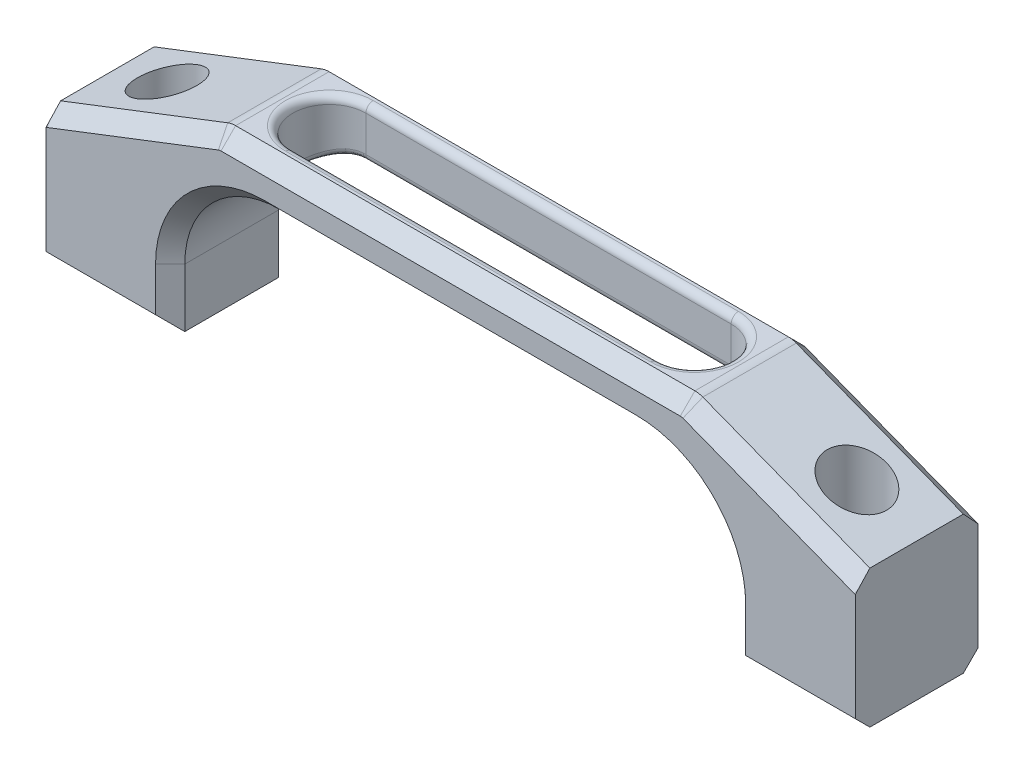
ISO-10303-21;
HEADER;
FILE_DESCRIPTION(('STEP AP214'),'2;1');
FILE_NAME('part.step','',(''),(''),'','','');
FILE_SCHEMA(('AUTOMOTIVE_DESIGN { 1 0 10303 214 1 1 1 1 }'));
ENDSEC;
DATA;
#1=APPLICATION_CONTEXT('core data for automotive mechanical design processes');
#2=APPLICATION_PROTOCOL_DEFINITION('international standard','automotive_design',2000,#1);
#3=PRODUCT_CONTEXT('',#1,'mechanical');
#4=PRODUCT('Part','Part','',(#3));
#5=PRODUCT_RELATED_PRODUCT_CATEGORY('part','',(#4));
#6=PRODUCT_DEFINITION_FORMATION('','',#4);
#7=PRODUCT_DEFINITION_CONTEXT('part definition',#1,'design');
#8=PRODUCT_DEFINITION('design','',#6,#7);
#9=PRODUCT_DEFINITION_SHAPE('','',#8);
#10=(LENGTH_UNIT() NAMED_UNIT(*) SI_UNIT(.MILLI.,.METRE.));
#11=(NAMED_UNIT(*) PLANE_ANGLE_UNIT() SI_UNIT($,.RADIAN.));
#12=(NAMED_UNIT(*) SI_UNIT($,.STERADIAN.) SOLID_ANGLE_UNIT());
#13=UNCERTAINTY_MEASURE_WITH_UNIT(LENGTH_MEASURE(1.E-05),#10,'distance_accuracy_value','');
#14=(GEOMETRIC_REPRESENTATION_CONTEXT(3) GLOBAL_UNCERTAINTY_ASSIGNED_CONTEXT((#13)) GLOBAL_UNIT_ASSIGNED_CONTEXT((#10,
#11,#12)) REPRESENTATION_CONTEXT('',''));
#15=CARTESIAN_POINT('',(0.,0.,0.));
#16=DIRECTION('',(0.,0.,1.));
#17=DIRECTION('',(1.,0.,0.));
#18=AXIS2_PLACEMENT_3D('',#15,#16,#17);
#19=CARTESIAN_POINT('',(-32.258,-8.76147733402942,10.668));
#20=DIRECTION('',(0.,1.,0.));
#21=DIRECTION('',(0.,0.,1.));
#22=AXIS2_PLACEMENT_3D('',#19,#20,#21);
#23=PLANE('',#22);
#24=DIRECTION('',(1.,0.,0.));
#25=VECTOR('',#24,1.);
#26=CARTESIAN_POINT('',(-32.258,-8.76147733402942,7.62));
#27=LINE('',#26,#25);
#28=CARTESIAN_POINT('',(-31.75,-8.76147733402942,7.62));
#29=VERTEX_POINT('',#28);
#30=CARTESIAN_POINT('',(31.75,-8.76147733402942,7.62));
#31=VERTEX_POINT('',#30);
#32=EDGE_CURVE('E1041',#29,#31,#27,.T.);
#33=ORIENTED_EDGE('',*,*,#32,.T.);
#34=CARTESIAN_POINT('',(31.75,-8.76147733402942,0.));
#35=DIRECTION('',(0.,1.,0.));
#36=DIRECTION('',(0.,0.,1.));
#37=AXIS2_PLACEMENT_3D('',#34,#35,#36);
#38=CIRCLE('',#37,7.62);
#39=CARTESIAN_POINT('',(32.258,-8.76147733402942,7.60304780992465));
#40=VERTEX_POINT('',#39);
#41=EDGE_CURVE('E1037',#31,#40,#38,.T.);
#42=ORIENTED_EDGE('',*,*,#41,.T.);
#43=DIRECTION('',(0.,0.,-1.));
#44=VECTOR('',#43,1.);
#45=CARTESIAN_POINT('',(32.258,-8.76147733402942,10.668));
#46=LINE('',#45,#44);
#47=CARTESIAN_POINT('',(32.258,-8.76147733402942,8.12799999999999));
#48=VERTEX_POINT('',#47);
#49=EDGE_CURVE('E522',#48,#40,#46,.T.);
#50=ORIENTED_EDGE('',*,*,#49,.F.);
#51=DIRECTION('',(-1.,0.,0.));
#52=VECTOR('',#51,1.);
#53=CARTESIAN_POINT('',(-32.258,-8.76147733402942,8.12799999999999));
#54=LINE('',#53,#52);
#55=CARTESIAN_POINT('',(-32.258,-8.76147733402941,8.12799999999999));
#56=VERTEX_POINT('',#55);
#57=EDGE_CURVE('E858',#48,#56,#54,.T.);
#58=ORIENTED_EDGE('',*,*,#57,.T.);
#59=DIRECTION('',(0.,0.,-1.));
#60=VECTOR('',#59,1.);
#61=CARTESIAN_POINT('',(-32.258,-8.76147733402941,10.668));
#62=LINE('',#61,#60);
#63=CARTESIAN_POINT('',(-32.258,-8.76147733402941,7.60304780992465));
#64=VERTEX_POINT('',#63);
#65=EDGE_CURVE('E803',#56,#64,#62,.T.);
#66=ORIENTED_EDGE('',*,*,#65,.T.);
#67=CARTESIAN_POINT('',(-31.75,-8.76147733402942,0.));
#68=DIRECTION('',(0.,1.,0.));
#69=DIRECTION('',(0.,0.,1.));
#70=AXIS2_PLACEMENT_3D('',#67,#68,#69);
#71=CIRCLE('',#70,7.62);
#72=EDGE_CURVE('E1039',#64,#29,#71,.T.);
#73=ORIENTED_EDGE('',*,*,#72,.T.);
#74=EDGE_LOOP('',(#33,#42,#50,#58,#66,#73));
#75=FACE_BOUND('',#74,.T.);
#76=ADVANCED_FACE('F33',(#75),#23,.F.);
#77=CARTESIAN_POINT('',(-73.533,-35.4314773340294,10.668));
#78=DIRECTION('',(0.,1.,0.));
#79=DIRECTION('',(0.,0.,1.));
#80=AXIS2_PLACEMENT_3D('',#77,#78,#79);
#81=PLANE('',#80);
#82=CARTESIAN_POINT('',(-59.9694,-35.4314773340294,0.));
#83=DIRECTION('',(0.,1.,0.));
#84=DIRECTION('',(0.,0.,1.));
#85=AXIS2_PLACEMENT_3D('',#82,#83,#84);
#86=CIRCLE('',#85,3.37819999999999);
#87=CARTESIAN_POINT('',(-59.9694,-35.4314773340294,3.37819999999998));
#88=VERTEX_POINT('',#87);
#89=EDGE_CURVE('E971',#88,#88,#86,.T.);
#90=ORIENTED_EDGE('',*,*,#89,.T.);
#91=EDGE_LOOP('',(#90));
#92=FACE_BOUND('',#91,.T.);
#93=DIRECTION('',(-1.,0.,0.));
#94=VECTOR('',#93,1.);
#95=CARTESIAN_POINT('',(-73.533,-35.4314773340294,8.12799999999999));
#96=LINE('',#95,#94);
#97=CARTESIAN_POINT('',(-48.768,-35.4314773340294,8.12799999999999));
#98=VERTEX_POINT('',#97);
#99=CARTESIAN_POINT('',(-70.358,-35.4314773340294,8.12799999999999));
#100=VERTEX_POINT('',#99);
#101=EDGE_CURVE('E864',#98,#100,#96,.T.);
#102=ORIENTED_EDGE('',*,*,#101,.T.);
#103=DIRECTION('',(0.,0.,-1.));
#104=VECTOR('',#103,1.);
#105=CARTESIAN_POINT('',(-70.358,-35.4314773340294,10.668));
#106=LINE('',#105,#104);
#107=CARTESIAN_POINT('',(-70.358,-35.4314773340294,-8.12800000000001));
#108=VERTEX_POINT('',#107);
#109=EDGE_CURVE('E599',#100,#108,#106,.T.);
#110=ORIENTED_EDGE('',*,*,#109,.T.);
#111=DIRECTION('',(1.,0.,0.));
#112=VECTOR('',#111,1.);
#113=CARTESIAN_POINT('',(-73.533,-35.4314773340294,-8.12800000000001));
#114=LINE('',#113,#112);
#115=CARTESIAN_POINT('',(-48.768,-35.4314773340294,-8.12800000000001));
#116=VERTEX_POINT('',#115);
#117=EDGE_CURVE('E867',#108,#116,#114,.T.);
#118=ORIENTED_EDGE('',*,*,#117,.T.);
#119=DIRECTION('',(0.,0.,-1.));
#120=VECTOR('',#119,1.);
#121=CARTESIAN_POINT('',(-48.768,-35.4314773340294,10.668));
#122=LINE('',#121,#120);
#123=EDGE_CURVE('E809',#98,#116,#122,.T.);
#124=ORIENTED_EDGE('',*,*,#123,.F.);
#125=EDGE_LOOP('',(#102,#110,#118,#124));
#126=FACE_BOUND('',#125,.T.);
#127=ADVANCED_FACE('F414',(#92,#126),#81,.F.);
#128=CARTESIAN_POINT('',(-48.768,-35.4314773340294,10.668));
#129=DIRECTION('',(-1.,0.,0.));
#130=DIRECTION('',(0.,-1.,0.));
#131=AXIS2_PLACEMENT_3D('',#128,#129,#130);
#132=PLANE('',#131);
#133=ORIENTED_EDGE('',*,*,#123,.T.);
#134=DIRECTION('',(0.,1.,0.));
#135=VECTOR('',#134,1.);
#136=CARTESIAN_POINT('',(-48.768,-35.4314773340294,-8.12800000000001));
#137=LINE('',#136,#135);
#138=CARTESIAN_POINT('',(-48.768,-25.2714773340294,-8.12800000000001));
#139=VERTEX_POINT('',#138);
#140=EDGE_CURVE('E350',#116,#139,#137,.T.);
#141=ORIENTED_EDGE('',*,*,#140,.T.);
#142=DIRECTION('',(0.,0.,-1.));
#143=VECTOR('',#142,1.);
#144=CARTESIAN_POINT('',(-48.768,-25.2714773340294,10.668));
#145=LINE('',#144,#143);
#146=CARTESIAN_POINT('',(-48.768,-25.2714773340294,8.12799999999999));
#147=VERTEX_POINT('',#146);
#148=EDGE_CURVE('E806',#147,#139,#145,.T.);
#149=ORIENTED_EDGE('',*,*,#148,.F.);
#150=DIRECTION('',(0.,-1.,0.));
#151=VECTOR('',#150,1.);
#152=CARTESIAN_POINT('',(-48.768,-35.4314773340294,8.12799999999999));
#153=LINE('',#152,#151);
#154=EDGE_CURVE('E862',#147,#98,#153,.T.);
#155=ORIENTED_EDGE('',*,*,#154,.T.);
#156=EDGE_LOOP('',(#133,#141,#149,#155));
#157=FACE_BOUND('',#156,.T.);
#158=ADVANCED_FACE('F505',(#157),#132,.F.);
#159=CARTESIAN_POINT('',(-32.258,-25.2714773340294,10.668));
#160=DIRECTION('',(0.,0.,-1.));
#161=DIRECTION('',(-1.,0.,0.));
#162=AXIS2_PLACEMENT_3D('',#159,#160,#161);
#163=CYLINDRICAL_SURFACE('',#162,16.51);
#164=CARTESIAN_POINT('',(-32.258,-8.76147733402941,-7.60304780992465));
#165=VERTEX_POINT('',#164);
#166=CARTESIAN_POINT('',(-32.258,-8.76147733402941,-8.12800000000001));
#167=VERTEX_POINT('',#166);
#168=EDGE_CURVE('E802',#165,#167,#62,.T.);
#169=ORIENTED_EDGE('',*,*,#168,.F.);
#170=CARTESIAN_POINT('',(-30.1665375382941,-7.6553145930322,-6.14940213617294));
#171=CARTESIAN_POINT('',(-30.3225822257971,-8.87250223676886,-6.18958342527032));
#172=CARTESIAN_POINT('',(-30.0218561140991,-8.91361193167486,-7.37928256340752));
#173=CARTESIAN_POINT('',(-30.3290818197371,-7.6286199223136,-6.19128163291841));
#174=CARTESIAN_POINT('',(-30.4760739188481,-8.85492799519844,-6.22465229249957));
#175=CARTESIAN_POINT('',(-30.202976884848,-8.88882402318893,-7.42953795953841));
#176=CARTESIAN_POINT('',(-30.4936364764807,-7.60495576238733,-6.22675786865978));
#177=CARTESIAN_POINT('',(-30.6296170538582,-8.8394662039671,-6.25381788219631));
#178=CARTESIAN_POINT('',(-30.3863377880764,-8.86685016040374,-7.47210944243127));
#179=CARTESIAN_POINT('',(-30.8255918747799,-7.56406148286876,-6.284606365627));
#180=CARTESIAN_POINT('',(-30.9378079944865,-8.81263872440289,-6.30079263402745));
#181=CARTESIAN_POINT('',(-30.756230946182,-8.82887690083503,-7.541527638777));
#182=CARTESIAN_POINT('',(-30.9929928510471,-7.54683189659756,-6.30697754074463));
#183=CARTESIAN_POINT('',(-31.0922109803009,-8.80131369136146,-6.31851130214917));
#184=CARTESIAN_POINT('',(-30.942763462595,-8.81287799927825,-7.56837304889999));
#185=CARTESIAN_POINT('',(-31.3291128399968,-7.51921112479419,-6.33828105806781));
#186=CARTESIAN_POINT('',(-31.4012916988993,-8.78281202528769,-6.34270624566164));
#187=CARTESIAN_POINT('',(-31.3172971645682,-8.7872301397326,-7.60593726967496));
#188=CARTESIAN_POINT('',(-31.497828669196,-7.50880674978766,-6.34723936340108));
#189=CARTESIAN_POINT('',(-31.555699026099,-8.77565533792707,-6.34915118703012));
#190=CARTESIAN_POINT('',(-31.5052948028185,-8.77756893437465,-7.61668723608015));
#191=CARTESIAN_POINT('',(-31.835623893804,-7.4949401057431,-6.35166854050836));
#192=CARTESIAN_POINT('',(-31.8647101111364,-8.76546323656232,-6.35089593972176));
#193=CARTESIAN_POINT('',(-31.881695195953,-8.76469276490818,-7.62200224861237));
#194=CARTESIAN_POINT('',(-32.0047032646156,-7.49147738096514,-6.34714029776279));
#195=CARTESIAN_POINT('',(-32.0190328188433,-8.76244119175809,-6.34618309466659));
#196=CARTESIAN_POINT('',(-32.0700979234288,-8.76147737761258,-7.61656835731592));
#197=CARTESIAN_POINT('',(-32.3438545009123,-7.49147728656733,-6.32447969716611));
#198=CARTESIAN_POINT('',(-32.3292452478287,-8.76050341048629,-6.32545558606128));
#199=CARTESIAN_POINT('',(-32.4480093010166,-8.76147728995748,-7.58937563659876));
#200=CARTESIAN_POINT('',(-32.5139162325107,-7.49501801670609,-6.30619534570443));
#201=CARTESIAN_POINT('',(-32.4848471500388,-8.76163266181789,-6.30934266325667));
#202=CARTESIAN_POINT('',(-32.6375066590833,-8.76476511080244,-7.5674344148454));
#203=CARTESIAN_POINT('',(-32.8518817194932,-7.50897247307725,-6.25600183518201));
#204=CARTESIAN_POINT('',(-32.795511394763,-8.76808554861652,-6.26554137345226));
#205=CARTESIAN_POINT('',(-33.0140967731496,-8.77772282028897,-7.50720220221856));
#206=CARTESIAN_POINT('',(-33.0197845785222,-7.51938896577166,-6.2240871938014));
#207=CARTESIAN_POINT('',(-32.9503004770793,-8.77339438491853,-6.23791680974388));
#208=CARTESIAN_POINT('',(-33.2011885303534,-8.78739527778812,-7.46890463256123));
#209=CARTESIAN_POINT('',(-33.3520432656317,-7.54670338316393,-6.14695176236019));
#210=CARTESIAN_POINT('',(-33.2586683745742,-8.78816334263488,-6.17091866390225));
#211=CARTESIAN_POINT('',(-33.5714196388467,-8.81275866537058,-7.37634211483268));
#212=CARTESIAN_POINT('',(-33.5164009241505,-7.56359787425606,-6.10173802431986));
#213=CARTESIAN_POINT('',(-33.4120033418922,-8.79759173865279,-6.13165526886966));
#214=CARTESIAN_POINT('',(-33.7545610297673,-8.8284464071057,-7.32208562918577));
#215=CARTESIAN_POINT('',(-33.8405290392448,-7.60330877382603,-5.99843103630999));
#216=CARTESIAN_POINT('',(-33.7168370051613,-8.82048790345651,-6.04119813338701));
#217=CARTESIAN_POINT('',(-34.1157323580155,-8.86532081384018,-7.19811724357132));
#218=CARTESIAN_POINT('',(-34.0002976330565,-7.62612755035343,-5.94033263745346));
#219=CARTESIAN_POINT('',(-33.8681320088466,-8.83391820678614,-5.99013103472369));
#220=CARTESIAN_POINT('',(-34.293760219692,-8.88650967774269,-7.12839916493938));
#221=CARTESIAN_POINT('',(-34.4701242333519,-7.7023275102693,-5.7478262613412));
#222=CARTESIAN_POINT('',(-34.3156548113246,-8.87978959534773,-5.81968280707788));
#223=CARTESIAN_POINT('',(-34.8172812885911,-8.95726678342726,-6.89739151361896));
#224=CARTESIAN_POINT('',(-34.7719550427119,-7.76356336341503,-5.59491317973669));
#225=CARTESIAN_POINT('',(-34.6088404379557,-8.91791292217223,-5.68254308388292));
#226=CARTESIAN_POINT('',(-35.1536070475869,-9.01412864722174,-6.7138958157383));
#227=CARTESIAN_POINT('',(-35.3459236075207,-7.90029036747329,-5.24453710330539));
#228=CARTESIAN_POINT('',(-35.1770148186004,-9.00700025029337,-5.35941576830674));
#229=CARTESIAN_POINT('',(-35.7931720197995,-9.14108943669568,-6.29344452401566));
#230=CARTESIAN_POINT('',(-35.6180457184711,-7.97578897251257,-5.04705080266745));
#231=CARTESIAN_POINT('',(-35.4515924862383,-9.05764329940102,-5.17462945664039));
#232=CARTESIAN_POINT('',(-36.0963938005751,-9.21119528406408,-6.05646096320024));
#233=CARTESIAN_POINT('',(-36.1392999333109,-8.13706739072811,-4.60212007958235));
#234=CARTESIAN_POINT('',(-35.9853797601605,-9.16951312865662,-4.74841746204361));
#235=CARTESIAN_POINT('',(-36.6772199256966,-9.36095381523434,-5.52254409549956));
#236=CARTESIAN_POINT('',(-36.3867092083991,-8.223166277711,-4.35273752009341));
#237=CARTESIAN_POINT('',(-36.2438720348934,-9.23098846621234,-4.5055733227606));
#238=CARTESIAN_POINT('',(-36.9529045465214,-9.44090278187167,-5.22328502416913));
#239=CARTESIAN_POINT('',(-36.8374847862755,-8.39300704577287,-3.81610885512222));
#240=CARTESIAN_POINT('',(-36.7199303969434,-9.35524394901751,-3.97293450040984));
#241=CARTESIAN_POINT('',(-37.4551973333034,-9.59861206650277,-4.57933062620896));
#242=CARTESIAN_POINT('',(-37.0408413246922,-8.47674840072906,-3.52885437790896));
#243=CARTESIAN_POINT('',(-36.9385517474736,-9.41808864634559,-3.68359068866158));
#244=CARTESIAN_POINT('',(-37.681794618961,-9.67637189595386,-4.23462525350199));
#245=CARTESIAN_POINT('',(-37.3121001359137,-8.5946539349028,-3.06902686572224));
#246=CARTESIAN_POINT('',(-37.2328889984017,-9.50815775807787,-3.2128986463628));
#247=CARTESIAN_POINT('',(-37.9840544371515,-9.78585560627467,-3.68283223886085));
#248=CARTESIAN_POINT('',(-37.398130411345,-8.63330223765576,-2.90768897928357));
#249=CARTESIAN_POINT('',(-37.3265074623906,-9.53787340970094,-3.04731746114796));
#250=CARTESIAN_POINT('',(-38.0799167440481,-9.82174331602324,-3.48922677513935));
#251=CARTESIAN_POINT('',(-37.5561823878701,-8.70601264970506,-2.57762945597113));
#252=CARTESIAN_POINT('',(-37.4989809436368,-9.59410429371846,-2.70693978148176));
#253=CARTESIAN_POINT('',(-38.2560318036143,-9.88926012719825,-3.09315534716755));
#254=CARTESIAN_POINT('',(-37.6282100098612,-8.74007669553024,-2.40891097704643));
#255=CARTESIAN_POINT('',(-37.578030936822,-9.62067119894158,-2.53204133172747));
#256=CARTESIAN_POINT('',(-38.3362911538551,-9.92089102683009,-2.89069317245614));
#257=CARTESIAN_POINT('',(-37.7575852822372,-8.80239615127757,-2.06522248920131));
#258=CARTESIAN_POINT('',(-37.7202720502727,-9.66947539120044,-2.1744612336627));
#259=CARTESIAN_POINT('',(-38.4804521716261,-9.97875909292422,-2.47826698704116));
#260=CARTESIAN_POINT('',(-37.814933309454,-8.83065171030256,-1.89025264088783));
#261=CARTESIAN_POINT('',(-37.7836392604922,-9.69176660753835,-1.99161503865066));
#262=CARTESIAN_POINT('',(-38.5443542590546,-10.0049963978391,-2.26830316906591));
#263=CARTESIAN_POINT('',(-37.9143210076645,-8.88026912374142,-1.53543544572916));
#264=CARTESIAN_POINT('',(-37.8935444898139,-9.73100410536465,-1.61991111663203));
#265=CARTESIAN_POINT('',(-38.6551005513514,-10.051069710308,-1.84252253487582));
#266=CARTESIAN_POINT('',(-37.9563684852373,-8.90163449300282,-1.35559063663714));
#267=CARTESIAN_POINT('',(-37.9402390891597,-9.74800294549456,-1.43084093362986));
#268=CARTESIAN_POINT('',(-38.7019534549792,-10.0709089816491,-1.62670876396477));
#269=CARTESIAN_POINT('',(-38.0227415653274,-8.9356353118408,-1.00278232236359));
#270=CARTESIAN_POINT('',(-38.0139459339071,-9.77508033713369,-1.05939447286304));
#271=CARTESIAN_POINT('',(-38.7759120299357,-10.1024811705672,-1.20333878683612));
#272=CARTESIAN_POINT('',(-38.0479414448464,-8.94869931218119,-0.830011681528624));
#273=CARTESIAN_POINT('',(-38.0420173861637,-9.78552995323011,-0.877060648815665));
#274=CARTESIAN_POINT('',(-38.803991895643,-10.1146120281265,-0.996014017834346));
#275=CARTESIAN_POINT('',(-38.0840254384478,-8.96746810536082,-0.48277644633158));
#276=CARTESIAN_POINT('',(-38.082181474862,-9.80053655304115,-0.510456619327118));
#277=CARTESIAN_POINT('',(-38.844199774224,-10.1320401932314,-0.579331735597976));
#278=CARTESIAN_POINT('',(-38.094915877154,-8.9731761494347,-0.30831263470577));
#279=CARTESIAN_POINT('',(-38.0943343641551,-9.80511588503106,-0.325949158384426));
#280=CARTESIAN_POINT('',(-38.8563348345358,-10.1373405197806,-0.369975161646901));
#281=CARTESIAN_POINT('',(-38.1022697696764,-8.97702644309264,0.0409614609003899));
#282=CARTESIAN_POINT('',(-38.102528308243,-9.8081997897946,0.0432625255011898));
#283=CARTESIAN_POINT('',(-38.8645291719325,-10.1409157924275,0.0491537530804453));
#284=CARTESIAN_POINT('',(-38.0987344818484,-8.97516935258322,0.215771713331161));
#285=CARTESIAN_POINT('',(-38.0985818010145,-9.80670904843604,0.228215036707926));
#286=CARTESIAN_POINT('',(-38.8605898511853,-10.1391913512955,0.258926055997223));
#287=CARTESIAN_POINT('',(-38.0772836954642,-8.96396226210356,0.564332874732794));
#288=CARTESIAN_POINT('',(-38.0746887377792,-9.79773776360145,0.59652632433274));
#289=CARTESIAN_POINT('',(-38.8366875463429,-10.1287847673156,0.677199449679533));
#290=CARTESIAN_POINT('',(-38.0593685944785,-8.95461246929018,0.73808381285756));
#291=CARTESIAN_POINT('',(-38.0547106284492,-9.79024538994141,0.780130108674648));
#292=CARTESIAN_POINT('',(-38.8167250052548,-10.1201028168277,0.885700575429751));
#293=CARTESIAN_POINT('',(-38.0108520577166,-8.92953740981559,1.07289958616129));
#294=CARTESIAN_POINT('',(-38.0007663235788,-9.77023227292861,1.13317003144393));
#295=CARTESIAN_POINT('',(-38.7626637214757,-10.0968188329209,1.28747950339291));
#296=CARTESIAN_POINT('',(-37.9810678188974,-8.91422404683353,1.23410469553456));
#297=CARTESIAN_POINT('',(-37.9676365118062,-9.75801285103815,1.30301885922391));
#298=CARTESIAN_POINT('',(-38.7294755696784,-10.0825992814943,1.48092563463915));
#299=CARTESIAN_POINT('',(-37.9092624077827,-8.87778074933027,1.55331649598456));
#300=CARTESIAN_POINT('',(-37.8880238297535,-9.72906468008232,1.63848252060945));
#301=CARTESIAN_POINT('',(-38.6494638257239,-10.0487590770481,1.86397979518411));
#302=CARTESIAN_POINT('',(-37.8672372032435,-8.85664889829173,1.7113221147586));
#303=CARTESIAN_POINT('',(-37.841448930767,-9.71230373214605,1.80426414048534));
#304=CARTESIAN_POINT('',(-38.602635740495,-10.0291366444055,2.05358653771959));
#305=CARTESIAN_POINT('',(-37.7233379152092,-8.78546996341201,2.17896901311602));
#306=CARTESIAN_POINT('',(-37.6822005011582,-9.65603476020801,2.29432718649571));
#307=CARTESIAN_POINT('',(-38.442290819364,-9.96304191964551,2.61476281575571));
#308=CARTESIAN_POINT('',(-37.603603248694,-8.72761913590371,2.48249131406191));
#309=CARTESIAN_POINT('',(-37.549973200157,-9.61054517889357,2.61029816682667));
#310=CARTESIAN_POINT('',(-38.3088721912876,-9.90932329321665,2.9789895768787));
#311=CARTESIAN_POINT('',(-37.3145752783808,-8.59510443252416,3.07766951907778));
#312=CARTESIAN_POINT('',(-37.2346843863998,-9.50815129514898,3.22384268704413));
#313=CARTESIAN_POINT('',(-37.9868124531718,-9.78627392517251,3.69320342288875));
#314=CARTESIAN_POINT('',(-37.1434659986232,-8.5198529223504,3.36834217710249));
#315=CARTESIAN_POINT('',(-37.0486853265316,-9.45057592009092,3.52061683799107));
#316=CARTESIAN_POINT('',(-37.7961478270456,-9.71639752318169,4.04201061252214));
#317=CARTESIAN_POINT('',(-36.7582375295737,-8.36239127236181,3.91825947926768));
#318=CARTESIAN_POINT('',(-36.6364070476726,-9.33274510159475,4.07492307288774));
#319=CARTESIAN_POINT('',(-37.3668932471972,-9.57018313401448,4.70191137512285));
#320=CARTESIAN_POINT('',(-36.5441045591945,-8.28017890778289,4.17749401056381));
#321=CARTESIAN_POINT('',(-36.4090053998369,-9.27231694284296,4.33239834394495));
#322=CARTESIAN_POINT('',(-37.1282879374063,-9.49384308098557,5.01299281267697));
#323=CARTESIAN_POINT('',(-36.0603639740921,-8.11136890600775,4.67684189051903));
#324=CARTESIAN_POINT('',(-35.9039895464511,-9.1513107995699,4.82136385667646));
#325=CARTESIAN_POINT('',(-36.5892627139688,-9.33709093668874,5.61221026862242));
#326=CARTESIAN_POINT('',(-35.7878425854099,-8.02489090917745,4.91416556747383));
#327=CARTESIAN_POINT('',(-35.6234043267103,-9.09118281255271,5.04843549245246));
#328=CARTESIAN_POINT('',(-36.2855960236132,-9.2567899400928,5.89699868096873));
#329=CARTESIAN_POINT('',(-35.2044772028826,-7.86382269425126,5.34035265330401));
#330=CARTESIAN_POINT('',(-35.0352418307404,-8.98255799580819,5.44960030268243));
#331=CARTESIAN_POINT('',(-35.6355603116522,-9.10722659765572,6.40842318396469));
#332=CARTESIAN_POINT('',(-34.8936135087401,-7.78923863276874,5.52919099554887));
#333=CARTESIAN_POINT('',(-34.7276323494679,-8.93439186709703,5.62226908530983));
#334=CARTESIAN_POINT('',(-35.289169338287,-9.03796996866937,6.63502919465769));
#335=CARTESIAN_POINT('',(-34.4059962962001,-7.69338236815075,5.77070216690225));
#336=CARTESIAN_POINT('',(-34.256279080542,-8.87463749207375,5.8393618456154));
#337=CARTESIAN_POINT('',(-34.745824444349,-8.9489605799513,6.92484260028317));
#338=CARTESIAN_POINT('',(-34.2403093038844,-7.66414927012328,5.84412676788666));
#339=CARTESIAN_POINT('',(-34.0970925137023,-8.85678827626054,5.90480010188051));
#340=CARTESIAN_POINT('',(-34.5612017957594,-8.92181556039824,7.01295212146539));
#341=CARTESIAN_POINT('',(-33.9027026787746,-7.61182398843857,5.97672090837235));
#342=CARTESIAN_POINT('',(-33.7754604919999,-8.82543682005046,6.02224677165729));
#343=CARTESIAN_POINT('',(-34.185011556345,-8.87322779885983,7.17206509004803));
#344=CARTESIAN_POINT('',(-33.730785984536,-7.58872895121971,6.03589707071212));
#345=CARTESIAN_POINT('',(-33.613216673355,-8.81198599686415,6.07408200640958));
#346=CARTESIAN_POINT('',(-33.9934472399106,-8.85178240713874,7.24307648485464));
#347=CARTESIAN_POINT('',(-33.3824246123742,-7.5495342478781,6.13927065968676));
#348=CARTESIAN_POINT('',(-33.2867557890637,-8.78968694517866,6.1643491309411));
#349=CARTESIAN_POINT('',(-33.6052731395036,-8.81538732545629,7.36712479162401));
#350=CARTESIAN_POINT('',(-33.2059915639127,-7.53341821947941,6.18350306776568));
#351=CARTESIAN_POINT('',(-33.1228030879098,-8.7808728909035,6.20266046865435));
#352=CARTESIAN_POINT('',(-33.4086763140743,-8.80042244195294,7.42020368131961));
#353=CARTESIAN_POINT('',(-32.8497119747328,-7.50872465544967,6.25668903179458));
#354=CARTESIAN_POINT('',(-32.7932989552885,-8.76792421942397,6.26620297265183));
#355=CARTESIAN_POINT('',(-33.0116790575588,-8.7774927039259,7.50802683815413));
#356=CARTESIAN_POINT('',(-32.6698678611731,-7.5001419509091,6.28565305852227));
#357=CARTESIAN_POINT('',(-32.6280560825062,-8.76381743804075,6.29133028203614));
#358=CARTESIAN_POINT('',(-32.8112813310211,-8.76952304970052,7.5427836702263));
#359=CARTESIAN_POINT('',(-32.3841147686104,-7.49282855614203,6.31914487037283));
#360=CARTESIAN_POINT('',(-32.3661434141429,-8.76107767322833,6.320798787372));
#361=CARTESIAN_POINT('',(-32.4928707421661,-8.76273204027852,7.58297384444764));
#362=CARTESIAN_POINT('',(-32.2788203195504,-7.49147597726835,6.32882652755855));
#363=CARTESIAN_POINT('',(-32.2697955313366,-8.76087474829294,6.32942720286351));
#364=CARTESIAN_POINT('',(-32.3755426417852,-8.76147607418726,7.59459183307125));
#365=CARTESIAN_POINT('',(-32.0053806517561,-7.49147949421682,6.34709259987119));
#366=CARTESIAN_POINT('',(-32.0196551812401,-8.76243733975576,6.34614253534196));
#367=CARTESIAN_POINT('',(-32.0708527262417,-8.76147933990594,7.61651111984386));
#368=CARTESIAN_POINT('',(-31.8369398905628,-7.49491386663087,6.35163230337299));
#369=CARTESIAN_POINT('',(-31.8659117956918,-8.7654398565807,6.35085910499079));
#370=CARTESIAN_POINT('',(-31.8831615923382,-8.76466839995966,7.62195876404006));
#371=CARTESIAN_POINT('',(-31.5003161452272,-7.50867713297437,6.34732491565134));
#372=CARTESIAN_POINT('',(-31.5579744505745,-8.77556422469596,6.34920712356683));
#373=CARTESIAN_POINT('',(-31.5080665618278,-8.77744857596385,7.61678989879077));
#374=CARTESIAN_POINT('',(-31.3321334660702,-7.51901142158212,6.33846734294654));
#375=CARTESIAN_POINT('',(-31.4040585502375,-8.7826758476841,6.34284299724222));
#376=CARTESIAN_POINT('',(-31.320663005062,-8.78704470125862,7.60616081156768));
#377=CARTESIAN_POINT('',(-30.995877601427,-7.54654700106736,6.30734001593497));
#378=CARTESIAN_POINT('',(-31.0948725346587,-8.80112536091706,6.31879839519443));
#379=CARTESIAN_POINT('',(-30.9459778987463,-8.81261345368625,7.56880801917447));
#380=CARTESIAN_POINT('',(-30.8278189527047,-7.56380910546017,6.28495057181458));
#381=CARTESIAN_POINT('',(-30.9398722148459,-8.81247260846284,6.30107005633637));
#382=CARTESIAN_POINT('',(-30.7587125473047,-8.82864255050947,7.54194068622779));
#383=CARTESIAN_POINT('',(-30.4946785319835,-7.60480547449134,6.22698303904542));
#384=CARTESIAN_POINT('',(-30.6305922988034,-8.8393679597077,6.2540029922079));
#385=CARTESIAN_POINT('',(-30.3874989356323,-8.86671060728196,7.47237964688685));
#386=CARTESIAN_POINT('',(-30.3295946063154,-7.62853483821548,6.19141492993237));
#387=CARTESIAN_POINT('',(-30.4765600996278,-8.854872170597,6.22476343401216));
#388=CARTESIAN_POINT('',(-30.2035482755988,-8.88874501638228,7.42969791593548));
#389=CARTESIAN_POINT('',(-30.1665375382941,-7.6553145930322,6.14940213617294));
#390=CARTESIAN_POINT('',(-30.3225822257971,-8.87250223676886,6.18958342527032));
#391=CARTESIAN_POINT('',(-30.0218561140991,-8.91361193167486,7.37928256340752));
#392=(BOUNDED_SURFACE() B_SPLINE_SURFACE(3,2,((#170,#171,#172),(#173,#174,#175),(#176,#177,
#178),(#179,#180,#181),(#182,#183,#184),(#185,#186,#187),(#188,#189,#190),(#191,#192,#193),
(#194,#195,#196),(#197,#198,#199),(#200,#201,#202),(#203,#204,#205),(#206,#207,#208),(#209,#210,
#211),(#212,#213,#214),(#215,#216,#217),(#218,#219,#220),(#221,#222,#223),(#224,#225,#226),
(#227,#228,#229),(#230,#231,#232),(#233,#234,#235),(#236,#237,#238),(#239,#240,#241),(#242,#243,
#244),(#245,#246,#247),(#248,#249,#250),(#251,#252,#253),(#254,#255,#256),(#257,#258,#259),
(#260,#261,#262),(#263,#264,#265),(#266,#267,#268),(#269,#270,#271),(#272,#273,#274),(#275,#276,
#277),(#278,#279,#280),(#281,#282,#283),(#284,#285,#286),(#287,#288,#289),(#290,#291,#292),
(#293,#294,#295),(#296,#297,#298),(#299,#300,#301),(#302,#303,#304),(#305,#306,#307),(#308,#309,
#310),(#311,#312,#313),(#314,#315,#316),(#317,#318,#319),(#320,#321,#322),(#323,#324,#325),
(#326,#327,#328),(#329,#330,#331),(#332,#333,#334),(#335,#336,#337),(#338,#339,#340),(#341,#342,
#343),(#344,#345,#346),(#347,#348,#349),(#350,#351,#352),(#353,#354,#355),(#356,#357,#358),
(#359,#360,#361),(#362,#363,#364),(#365,#366,#367),(#368,#369,#370),(#371,#372,#373),(#374,#375,
#376),(#377,#378,#379),(#380,#381,#382),(#383,#384,#385),(#386,#387,#388),(#389,#390,#391)),
.UNSPECIFIED.,.F.,.F.,.F.) B_SPLINE_SURFACE_WITH_KNOTS((4,2,2,2,2,2,2,2,2,2,2,2,2,2,2,2,2,2,2,2,
2,2,2,2,2,2,2,2,2,2,2,2,2,2,2,2,4),(3,3),(0.,0.609399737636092,1.21884997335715,
1.82711897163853,2.4353480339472,3.05039807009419,3.6656957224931,4.28066769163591,
4.89588585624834,6.12173897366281,7.34823453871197,8.63341041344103,9.9188708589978,
10.5865226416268,11.2538914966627,11.9212432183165,12.5882539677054,13.2172067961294,
13.845881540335,14.4745014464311,15.1031039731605,15.6943497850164,16.2857905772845,
17.467767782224,18.697770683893,19.9281682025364,21.2486515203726,22.5698161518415,
23.2273782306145,23.8846340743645,24.5403405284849,25.1955967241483,25.576132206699,
26.182007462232,26.7883569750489,27.4001498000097,28.0114802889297),(0.,1.),
.UNSPECIFIED.) GEOMETRIC_REPRESENTATION_ITEM() RATIONAL_B_SPLINE_SURFACE(((1.,0.718948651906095,
1.),(1.,0.716788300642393,1.),(1.,0.71489134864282,1.),(1.,0.711672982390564,1.),(1.,
0.710351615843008,1.),(1.,0.708335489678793,1.),(1.,0.707639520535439,1.),(1.,0.706891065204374,
1.),(1.,0.706838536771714,1.),(1.,0.707378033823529,1.),(1.,0.707977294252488,1.),(1.,
0.709804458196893,1.),(1.,0.711032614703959,1.),(1.,0.714066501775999,1.),(1.,0.715871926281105,
1.),(1.,0.719990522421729,1.),(1.,0.722303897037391,1.),(1.,0.729868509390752,1.),(1.,
0.735756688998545,1.),(1.,0.748483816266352,1.),(1.,0.755323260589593,1.),(1.,0.76953561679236,
1.),(1.,0.776918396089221,1.),(1.,0.791126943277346,1.),(1.,0.797952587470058,1.),(1.,
0.807378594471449,1.),(1.,0.810433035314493,1.),(1.,0.816129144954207,1.),(1.,0.8187709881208,
1.),(1.,0.823569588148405,1.),(1.,0.825726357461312,1.),(1.,0.829493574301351,1.),(1.,
0.831104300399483,1.),(1.,0.833658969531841,1.),(1.,0.834635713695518,1.),(1.,0.836037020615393,
1.),(1.,0.836461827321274,1.),(1.,0.836748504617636,1.),(1.,0.836610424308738,1.),(1.,
0.835775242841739,1.),(1.,0.835078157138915,1.),(1.,0.833201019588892,1.),(1.,0.832052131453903,
1.),(1.,0.829303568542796,1.),(1.,0.827703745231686,1.),(1.,0.822279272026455,1.),(1.,
0.81782813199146,1.),(1.,0.807433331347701,1.),(1.,0.801436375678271,1.),(1.,0.788589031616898,
1.),(1.,0.781738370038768,1.),(1.,0.767307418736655,1.),(1.,0.759710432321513,1.),(1.,
0.745150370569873,1.),(1.,0.738187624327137,1.),(1.,0.728960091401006,1.),(1.,0.72609222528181,
1.),(1.,0.720860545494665,1.),(1.,0.718496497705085,1.),(1.,0.714375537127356,1.),(1.,
0.712617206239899,1.),(1.,0.709779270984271,1.),(1.,0.708699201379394,1.),(1.,0.707567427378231,
1.),(1.,0.70727442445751,1.),(1.,0.706839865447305,1.),(1.,0.706890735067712,1.),(1.,
0.707631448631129,1.),(1.,0.708321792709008,1.),(1.,0.710329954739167,1.),(1.,0.711653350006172,
1.),(1.,0.714879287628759,1.),(1.,0.716781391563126,1.),(1.,0.718948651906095,1.))) REPRESENTATION_ITEM('') SURFACE());
#393=CARTESIAN_POINT('',(-30.0218561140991,-8.91361193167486,-7.37928256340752));
#394=CARTESIAN_POINT('',(-30.202976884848,-8.88882402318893,-7.42953795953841));
#395=CARTESIAN_POINT('',(-30.3863377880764,-8.86685016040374,-7.47210944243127));
#396=CARTESIAN_POINT('',(-30.756230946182,-8.82887690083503,-7.541527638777));
#397=CARTESIAN_POINT('',(-30.942763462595,-8.81287799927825,-7.56837304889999));
#398=CARTESIAN_POINT('',(-31.3172971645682,-8.7872301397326,-7.60593726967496));
#399=CARTESIAN_POINT('',(-31.5052948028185,-8.77756893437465,-7.61668723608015));
#400=CARTESIAN_POINT('',(-31.881695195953,-8.76469276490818,-7.62200224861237));
#401=CARTESIAN_POINT('',(-32.0700979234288,-8.76147737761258,-7.61656835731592));
#402=CARTESIAN_POINT('',(-32.4480093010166,-8.76147728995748,-7.58937563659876));
#403=CARTESIAN_POINT('',(-32.6375066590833,-8.76476511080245,-7.5674344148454));
#404=CARTESIAN_POINT('',(-33.0140967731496,-8.77772282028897,-7.50720220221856));
#405=CARTESIAN_POINT('',(-33.2011885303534,-8.78739527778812,-7.46890463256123));
#406=CARTESIAN_POINT('',(-33.5714196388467,-8.81275866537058,-7.37634211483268));
#407=CARTESIAN_POINT('',(-33.7545610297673,-8.82844640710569,-7.32208562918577));
#408=CARTESIAN_POINT('',(-34.1157323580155,-8.86532081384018,-7.19811724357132));
#409=CARTESIAN_POINT('',(-34.293760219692,-8.88650967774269,-7.12839916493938));
#410=CARTESIAN_POINT('',(-34.8172812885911,-8.95726678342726,-6.89739151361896));
#411=CARTESIAN_POINT('',(-35.1536070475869,-9.01412864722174,-6.7138958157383));
#412=CARTESIAN_POINT('',(-35.7931720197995,-9.14108943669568,-6.29344452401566));
#413=CARTESIAN_POINT('',(-36.0963938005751,-9.21119528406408,-6.05646096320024));
#414=CARTESIAN_POINT('',(-36.6772199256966,-9.36095381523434,-5.52254409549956));
#415=CARTESIAN_POINT('',(-36.9529045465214,-9.44090278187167,-5.22328502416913));
#416=CARTESIAN_POINT('',(-37.4551973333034,-9.59861206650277,-4.57933062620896));
#417=CARTESIAN_POINT('',(-37.681794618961,-9.67637189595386,-4.23462525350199));
#418=CARTESIAN_POINT('',(-37.9840544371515,-9.78585560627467,-3.68283223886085));
#419=CARTESIAN_POINT('',(-38.0799167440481,-9.82174331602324,-3.48922677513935));
#420=CARTESIAN_POINT('',(-38.2560318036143,-9.88926012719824,-3.09315534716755));
#421=CARTESIAN_POINT('',(-38.3362911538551,-9.92089102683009,-2.89069317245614));
#422=CARTESIAN_POINT('',(-38.4804521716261,-9.97875909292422,-2.47826698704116));
#423=CARTESIAN_POINT('',(-38.5443542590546,-10.0049963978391,-2.26830316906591));
#424=CARTESIAN_POINT('',(-38.6551005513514,-10.051069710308,-1.84252253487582));
#425=CARTESIAN_POINT('',(-38.7019534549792,-10.0709089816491,-1.62670876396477));
#426=CARTESIAN_POINT('',(-38.7759120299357,-10.1024811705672,-1.20333878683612));
#427=CARTESIAN_POINT('',(-38.803991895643,-10.1146120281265,-0.996014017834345));
#428=CARTESIAN_POINT('',(-38.844199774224,-10.1320401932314,-0.579331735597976));
#429=CARTESIAN_POINT('',(-38.8563348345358,-10.1373405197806,-0.369975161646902));
#430=CARTESIAN_POINT('',(-38.8645291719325,-10.1409157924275,0.049153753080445));
#431=CARTESIAN_POINT('',(-38.8605898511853,-10.1391913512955,0.258926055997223));
#432=CARTESIAN_POINT('',(-38.8366875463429,-10.1287847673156,0.677199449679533));
#433=CARTESIAN_POINT('',(-38.8167250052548,-10.1201028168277,0.885700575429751));
#434=CARTESIAN_POINT('',(-38.7626637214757,-10.0968188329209,1.28747950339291));
#435=CARTESIAN_POINT('',(-38.7294755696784,-10.0825992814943,1.48092563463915));
#436=CARTESIAN_POINT('',(-38.6494638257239,-10.0487590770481,1.86397979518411));
#437=CARTESIAN_POINT('',(-38.602635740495,-10.0291366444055,2.05358653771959));
#438=CARTESIAN_POINT('',(-38.442290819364,-9.96304191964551,2.61476281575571));
#439=CARTESIAN_POINT('',(-38.3088721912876,-9.90932329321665,2.9789895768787));
#440=CARTESIAN_POINT('',(-37.9868124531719,-9.78627392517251,3.69320342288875));
#441=CARTESIAN_POINT('',(-37.7961478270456,-9.71639752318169,4.04201061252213));
#442=CARTESIAN_POINT('',(-37.3668932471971,-9.57018313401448,4.70191137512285));
#443=CARTESIAN_POINT('',(-37.1282879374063,-9.49384308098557,5.01299281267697));
#444=CARTESIAN_POINT('',(-36.5892627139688,-9.33709093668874,5.61221026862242));
#445=CARTESIAN_POINT('',(-36.2855960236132,-9.2567899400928,5.89699868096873));
#446=CARTESIAN_POINT('',(-35.6355603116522,-9.10722659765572,6.40842318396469));
#447=CARTESIAN_POINT('',(-35.289169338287,-9.03796996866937,6.63502919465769));
#448=CARTESIAN_POINT('',(-34.745824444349,-8.9489605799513,6.92484260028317));
#449=CARTESIAN_POINT('',(-34.5612017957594,-8.92181556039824,7.01295212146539));
#450=CARTESIAN_POINT('',(-34.185011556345,-8.87322779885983,7.17206509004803));
#451=CARTESIAN_POINT('',(-33.9934472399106,-8.85178240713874,7.24307648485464));
#452=CARTESIAN_POINT('',(-33.6052731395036,-8.81538732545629,7.36712479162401));
#453=CARTESIAN_POINT('',(-33.4086763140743,-8.80042244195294,7.42020368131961));
#454=CARTESIAN_POINT('',(-33.0116790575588,-8.7774927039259,7.50802683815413));
#455=CARTESIAN_POINT('',(-32.8112813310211,-8.76952304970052,7.5427836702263));
#456=CARTESIAN_POINT('',(-32.4928707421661,-8.76273204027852,7.58297384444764));
#457=CARTESIAN_POINT('',(-32.3755426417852,-8.76147607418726,7.59459183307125));
#458=CARTESIAN_POINT('',(-32.0708527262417,-8.76147933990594,7.61651111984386));
#459=CARTESIAN_POINT('',(-31.8831615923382,-8.76466839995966,7.62195876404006));
#460=CARTESIAN_POINT('',(-31.5080665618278,-8.77744857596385,7.61678989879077));
#461=CARTESIAN_POINT('',(-31.3206630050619,-8.78704470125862,7.60616081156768));
#462=CARTESIAN_POINT('',(-30.9459778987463,-8.81261345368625,7.56880801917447));
#463=CARTESIAN_POINT('',(-30.7587125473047,-8.82864255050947,7.54194068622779));
#464=CARTESIAN_POINT('',(-30.3874989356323,-8.86671060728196,7.47237964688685));
#465=CARTESIAN_POINT('',(-30.2035482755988,-8.88874501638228,7.42969791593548));
#466=CARTESIAN_POINT('',(-30.0218561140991,-8.91361193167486,7.37928256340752));
#467=B_SPLINE_CURVE_WITH_KNOTS('',3,(#393,#394,#395,#396,#397,#398,#399,#400,#401,#402,#403,
#404,#405,#406,#407,#408,#409,#410,#411,#412,#413,#414,#415,#416,#417,#418,#419,#420,#421,#422,
#423,#424,#425,#426,#427,#428,#429,#430,#431,#432,#433,#434,#435,#436,#437,#438,#439,#440,#441,
#442,#443,#444,#445,#446,#447,#448,#449,#450,#451,#452,#453,#454,#455,#456,#457,#458,#459,#460,
#461,#462,#463,#464,#465,#466),.UNSPECIFIED.,.F.,.F.,(4,2,2,2,2,2,2,2,2,2,2,2,2,2,2,2,2,2,2,2,2,
2,2,2,2,2,2,2,2,2,2,2,2,2,2,2,4),(0.,0.609399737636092,1.21884997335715,1.82711897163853,
2.4353480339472,3.05039807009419,3.6656957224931,4.28066769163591,4.89588585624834,
6.12173897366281,7.34823453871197,8.63341041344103,9.9188708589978,10.5865226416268,
11.2538914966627,11.9212432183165,12.5882539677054,13.2172067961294,13.845881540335,
14.4745014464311,15.1031039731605,15.6943497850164,16.2857905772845,17.467767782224,
18.697770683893,19.9281682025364,21.2486515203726,22.5698161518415,23.2273782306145,
23.8846340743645,24.5403405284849,25.1955967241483,25.576132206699,26.182007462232,
26.7883569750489,27.4001498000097,28.0114802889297),.UNSPECIFIED.);
#468=EDGE_CURVE('E1021',#165,#64,#467,.T.);
#469=ORIENTED_EDGE('',*,*,#468,.T.);
#470=ORIENTED_EDGE('',*,*,#65,.F.);
#471=CARTESIAN_POINT('',(-32.258,-25.2714773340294,8.12799999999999));
#472=DIRECTION('',(0.,0.,1.));
#473=DIRECTION('',(1.,0.,0.));
#474=AXIS2_PLACEMENT_3D('',#471,#472,#473);
#475=CIRCLE('',#474,16.51);
#476=EDGE_CURVE('E860',#56,#147,#475,.T.);
#477=ORIENTED_EDGE('',*,*,#476,.T.);
#478=ORIENTED_EDGE('',*,*,#148,.T.);
#479=CARTESIAN_POINT('',(-32.258,-25.2714773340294,-8.12800000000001));
#480=DIRECTION('',(0.,0.,1.));
#481=DIRECTION('',(1.,0.,0.));
#482=AXIS2_PLACEMENT_3D('',#479,#480,#481);
#483=CIRCLE('',#482,16.51);
#484=EDGE_CURVE('E352',#139,#167,#483,.F.);
#485=ORIENTED_EDGE('',*,*,#484,.T.);
#486=EDGE_LOOP('',(#169,#469,#470,#477,#478,#485));
#487=FACE_BOUND('',#486,.T.);
#488=ADVANCED_FACE('F465',(#487),#163,.F.);
#489=CARTESIAN_POINT('',(32.258,-8.76147733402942,-7.60304780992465));
#490=VERTEX_POINT('',#489);
#491=CARTESIAN_POINT('',(32.258,-8.76147733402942,-8.12800000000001));
#492=VERTEX_POINT('',#491);
#493=EDGE_CURVE('E517',#490,#492,#46,.T.);
#494=ORIENTED_EDGE('',*,*,#493,.F.);
#495=CARTESIAN_POINT('',(31.75,-8.76147733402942,0.));
#496=DIRECTION('',(0.,1.,0.));
#497=DIRECTION('',(0.,0.,1.));
#498=AXIS2_PLACEMENT_3D('',#495,#496,#497);
#499=CIRCLE('',#498,7.62);
#500=CARTESIAN_POINT('',(31.75,-8.76147733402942,-7.62));
#501=VERTEX_POINT('',#500);
#502=EDGE_CURVE('E389',#490,#501,#499,.T.);
#503=ORIENTED_EDGE('',*,*,#502,.T.);
#504=DIRECTION('',(-1.,0.,0.));
#505=VECTOR('',#504,1.);
#506=CARTESIAN_POINT('',(-32.258,-8.76147733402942,-7.62));
#507=LINE('',#506,#505);
#508=CARTESIAN_POINT('',(-31.75,-8.76147733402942,-7.62));
#509=VERTEX_POINT('',#508);
#510=EDGE_CURVE('E375',#501,#509,#507,.T.);
#511=ORIENTED_EDGE('',*,*,#510,.T.);
#512=CARTESIAN_POINT('',(-31.75,-8.76147733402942,0.));
#513=DIRECTION('',(0.,1.,0.));
#514=DIRECTION('',(0.,0.,1.));
#515=AXIS2_PLACEMENT_3D('',#512,#513,#514);
#516=CIRCLE('',#515,7.62);
#517=EDGE_CURVE('E387',#509,#165,#516,.T.);
#518=ORIENTED_EDGE('',*,*,#517,.T.);
#519=ORIENTED_EDGE('',*,*,#168,.T.);
#520=DIRECTION('',(1.,0.,0.));
#521=VECTOR('',#520,1.);
#522=CARTESIAN_POINT('',(-32.258,-8.76147733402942,-8.12800000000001));
#523=LINE('',#522,#521);
#524=EDGE_CURVE('E355',#167,#492,#523,.T.);
#525=ORIENTED_EDGE('',*,*,#524,.T.);
#526=EDGE_LOOP('',(#494,#503,#511,#518,#519,#525));
#527=FACE_BOUND('',#526,.T.);
#528=ADVANCED_FACE('F501',(#527),#23,.F.);
#529=CARTESIAN_POINT('',(32.258,-25.2714773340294,10.668));
#530=DIRECTION('',(0.,0.,-1.));
#531=DIRECTION('',(-1.,0.,0.));
#532=AXIS2_PLACEMENT_3D('',#529,#530,#531);
#533=CYLINDRICAL_SURFACE('',#532,16.51);
#534=ORIENTED_EDGE('',*,*,#49,.T.);
#535=CARTESIAN_POINT('',(30.1665375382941,-7.6553145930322,6.14940213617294));
#536=CARTESIAN_POINT('',(30.3225822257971,-8.87250223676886,6.18958342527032));
#537=CARTESIAN_POINT('',(30.0218561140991,-8.91361193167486,7.37928256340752));
#538=CARTESIAN_POINT('',(30.3290818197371,-7.6286199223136,6.19128163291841));
#539=CARTESIAN_POINT('',(30.4760739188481,-8.85492799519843,6.22465229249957));
#540=CARTESIAN_POINT('',(30.202976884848,-8.88882402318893,7.42953795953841));
#541=CARTESIAN_POINT('',(30.4936364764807,-7.60495576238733,6.22675786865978));
#542=CARTESIAN_POINT('',(30.6296170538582,-8.83946620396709,6.25381788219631));
#543=CARTESIAN_POINT('',(30.3863377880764,-8.86685016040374,7.47210944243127));
#544=CARTESIAN_POINT('',(30.8255918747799,-7.56406148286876,6.284606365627));
#545=CARTESIAN_POINT('',(30.9378079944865,-8.81263872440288,6.30079263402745));
#546=CARTESIAN_POINT('',(30.756230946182,-8.82887690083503,7.541527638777));
#547=CARTESIAN_POINT('',(30.9929928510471,-7.54683189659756,6.30697754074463));
#548=CARTESIAN_POINT('',(31.0922109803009,-8.80131369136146,6.31851130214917));
#549=CARTESIAN_POINT('',(30.942763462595,-8.81287799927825,7.56837304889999));
#550=CARTESIAN_POINT('',(31.3291128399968,-7.51921112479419,6.33828105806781));
#551=CARTESIAN_POINT('',(31.4012916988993,-8.78281202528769,6.34270624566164));
#552=CARTESIAN_POINT('',(31.3172971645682,-8.7872301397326,7.60593726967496));
#553=CARTESIAN_POINT('',(31.497828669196,-7.50880674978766,6.34723936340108));
#554=CARTESIAN_POINT('',(31.555699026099,-8.77565533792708,6.34915118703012));
#555=CARTESIAN_POINT('',(31.5052948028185,-8.77756893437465,7.61668723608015));
#556=CARTESIAN_POINT('',(31.835623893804,-7.49494010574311,6.35166854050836));
#557=CARTESIAN_POINT('',(31.8647101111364,-8.76546323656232,6.35089593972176));
#558=CARTESIAN_POINT('',(31.881695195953,-8.76469276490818,7.62200224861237));
#559=CARTESIAN_POINT('',(32.0047032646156,-7.49147738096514,6.34714029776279));
#560=CARTESIAN_POINT('',(32.0190328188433,-8.76244119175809,6.34618309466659));
#561=CARTESIAN_POINT('',(32.0700979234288,-8.76147737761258,7.61656835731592));
#562=CARTESIAN_POINT('',(32.3438545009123,-7.49147728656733,6.32447969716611));
#563=CARTESIAN_POINT('',(32.3292452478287,-8.76050341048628,6.32545558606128));
#564=CARTESIAN_POINT('',(32.4480093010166,-8.76147728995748,7.58937563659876));
#565=CARTESIAN_POINT('',(32.5139162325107,-7.49501801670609,6.30619534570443));
#566=CARTESIAN_POINT('',(32.4848471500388,-8.76163266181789,6.30934266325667));
#567=CARTESIAN_POINT('',(32.6375066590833,-8.76476511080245,7.5674344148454));
#568=CARTESIAN_POINT('',(32.8518817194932,-7.50897247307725,6.25600183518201));
#569=CARTESIAN_POINT('',(32.795511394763,-8.76808554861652,6.26554137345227));
#570=CARTESIAN_POINT('',(33.0140967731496,-8.77772282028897,7.50720220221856));
#571=CARTESIAN_POINT('',(33.0197845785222,-7.51938896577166,6.2240871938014));
#572=CARTESIAN_POINT('',(32.9503004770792,-8.77339438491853,6.23791680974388));
#573=CARTESIAN_POINT('',(33.2011885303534,-8.78739527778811,7.46890463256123));
#574=CARTESIAN_POINT('',(33.3520432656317,-7.54670338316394,6.14695176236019));
#575=CARTESIAN_POINT('',(33.2586683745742,-8.78816334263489,6.17091866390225));
#576=CARTESIAN_POINT('',(33.5714196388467,-8.81275866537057,7.37634211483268));
#577=CARTESIAN_POINT('',(33.5164009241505,-7.56359787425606,6.10173802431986));
#578=CARTESIAN_POINT('',(33.4120033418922,-8.79759173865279,6.13165526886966));
#579=CARTESIAN_POINT('',(33.7545610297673,-8.82844640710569,7.32208562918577));
#580=CARTESIAN_POINT('',(33.8405290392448,-7.60330877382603,5.99843103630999));
#581=CARTESIAN_POINT('',(33.7168370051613,-8.82048790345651,6.04119813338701));
#582=CARTESIAN_POINT('',(34.1157323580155,-8.86532081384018,7.19811724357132));
#583=CARTESIAN_POINT('',(34.0002976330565,-7.62612755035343,5.94033263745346));
#584=CARTESIAN_POINT('',(33.8681320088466,-8.83391820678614,5.99013103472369));
#585=CARTESIAN_POINT('',(34.293760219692,-8.88650967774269,7.12839916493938));
#586=CARTESIAN_POINT('',(34.4701242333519,-7.7023275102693,5.74782626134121));
#587=CARTESIAN_POINT('',(34.3156548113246,-8.87978959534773,5.81968280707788));
#588=CARTESIAN_POINT('',(34.8172812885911,-8.95726678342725,6.89739151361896));
#589=CARTESIAN_POINT('',(34.7719550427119,-7.76356336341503,5.59491317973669));
#590=CARTESIAN_POINT('',(34.6088404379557,-8.91791292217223,5.68254308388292));
#591=CARTESIAN_POINT('',(35.1536070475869,-9.01412864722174,6.7138958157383));
#592=CARTESIAN_POINT('',(35.3459236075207,-7.90029036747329,5.24453710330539));
#593=CARTESIAN_POINT('',(35.1770148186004,-9.00700025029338,5.35941576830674));
#594=CARTESIAN_POINT('',(35.7931720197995,-9.14108943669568,6.29344452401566));
#595=CARTESIAN_POINT('',(35.6180457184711,-7.97578897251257,5.04705080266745));
#596=CARTESIAN_POINT('',(35.4515924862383,-9.05764329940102,5.1746294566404));
#597=CARTESIAN_POINT('',(36.0963938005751,-9.21119528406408,6.05646096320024));
#598=CARTESIAN_POINT('',(36.1392999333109,-8.13706739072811,4.60212007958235));
#599=CARTESIAN_POINT('',(35.9853797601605,-9.16951312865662,4.74841746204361));
#600=CARTESIAN_POINT('',(36.6772199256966,-9.36095381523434,5.52254409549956));
#601=CARTESIAN_POINT('',(36.3867092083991,-8.223166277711,4.35273752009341));
#602=CARTESIAN_POINT('',(36.2438720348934,-9.23098846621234,4.5055733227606));
#603=CARTESIAN_POINT('',(36.9529045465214,-9.44090278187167,5.22328502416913));
#604=CARTESIAN_POINT('',(36.8374847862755,-8.39300704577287,3.81610885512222));
#605=CARTESIAN_POINT('',(36.7199303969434,-9.35524394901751,3.97293450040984));
#606=CARTESIAN_POINT('',(37.4551973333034,-9.59861206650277,4.57933062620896));
#607=CARTESIAN_POINT('',(37.0408413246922,-8.47674840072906,3.52885437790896));
#608=CARTESIAN_POINT('',(36.9385517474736,-9.41808864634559,3.68359068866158));
#609=CARTESIAN_POINT('',(37.681794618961,-9.67637189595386,4.23462525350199));
#610=CARTESIAN_POINT('',(37.3121001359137,-8.5946539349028,3.06902686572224));
#611=CARTESIAN_POINT('',(37.2328889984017,-9.50815775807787,3.2128986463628));
#612=CARTESIAN_POINT('',(37.9840544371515,-9.78585560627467,3.68283223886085));
#613=CARTESIAN_POINT('',(37.398130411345,-8.63330223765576,2.90768897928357));
#614=CARTESIAN_POINT('',(37.3265074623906,-9.53787340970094,3.04731746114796));
#615=CARTESIAN_POINT('',(38.0799167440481,-9.82174331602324,3.48922677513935));
#616=CARTESIAN_POINT('',(37.5561823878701,-8.70601264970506,2.57762945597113));
#617=CARTESIAN_POINT('',(37.4989809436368,-9.59410429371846,2.70693978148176));
#618=CARTESIAN_POINT('',(38.2560318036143,-9.88926012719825,3.09315534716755));
#619=CARTESIAN_POINT('',(37.6282100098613,-8.74007669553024,2.40891097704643));
#620=CARTESIAN_POINT('',(37.578030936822,-9.62067119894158,2.53204133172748));
#621=CARTESIAN_POINT('',(38.3362911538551,-9.92089102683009,2.89069317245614));
#622=CARTESIAN_POINT('',(37.7575852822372,-8.80239615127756,2.06522248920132));
#623=CARTESIAN_POINT('',(37.7202720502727,-9.66947539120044,2.1744612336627));
#624=CARTESIAN_POINT('',(38.4804521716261,-9.97875909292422,2.47826698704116));
#625=CARTESIAN_POINT('',(37.814933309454,-8.83065171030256,1.89025264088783));
#626=CARTESIAN_POINT('',(37.7836392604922,-9.69176660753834,1.99161503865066));
#627=CARTESIAN_POINT('',(38.5443542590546,-10.0049963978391,2.26830316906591));
#628=CARTESIAN_POINT('',(37.9143210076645,-8.88026912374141,1.53543544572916));
#629=CARTESIAN_POINT('',(37.8935444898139,-9.73100410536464,1.61991111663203));
#630=CARTESIAN_POINT('',(38.6551005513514,-10.051069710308,1.84252253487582));
#631=CARTESIAN_POINT('',(37.9563684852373,-8.90163449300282,1.35559063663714));
#632=CARTESIAN_POINT('',(37.9402390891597,-9.74800294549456,1.43084093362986));
#633=CARTESIAN_POINT('',(38.7019534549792,-10.0709089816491,1.62670876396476));
#634=CARTESIAN_POINT('',(38.0227415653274,-8.9356353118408,1.00278232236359));
#635=CARTESIAN_POINT('',(38.0139459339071,-9.77508033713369,1.05939447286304));
#636=CARTESIAN_POINT('',(38.7759120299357,-10.1024811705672,1.20333878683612));
#637=CARTESIAN_POINT('',(38.0479414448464,-8.94869931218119,0.830011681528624));
#638=CARTESIAN_POINT('',(38.0420173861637,-9.78552995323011,0.877060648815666));
#639=CARTESIAN_POINT('',(38.803991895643,-10.1146120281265,0.996014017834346));
#640=CARTESIAN_POINT('',(38.0840254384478,-8.96746810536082,0.48277644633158));
#641=CARTESIAN_POINT('',(38.082181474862,-9.80053655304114,0.510456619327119));
#642=CARTESIAN_POINT('',(38.844199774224,-10.1320401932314,0.579331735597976));
#643=CARTESIAN_POINT('',(38.094915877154,-8.9731761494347,0.30831263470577));
#644=CARTESIAN_POINT('',(38.0943343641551,-9.80511588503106,0.325949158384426));
#645=CARTESIAN_POINT('',(38.8563348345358,-10.1373405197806,0.369975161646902));
#646=CARTESIAN_POINT('',(38.1022697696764,-8.97702644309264,-0.0409614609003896));
#647=CARTESIAN_POINT('',(38.102528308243,-9.8081997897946,-0.0432625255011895));
#648=CARTESIAN_POINT('',(38.8645291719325,-10.1409157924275,-0.049153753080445));
#649=CARTESIAN_POINT('',(38.0987344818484,-8.97516935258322,-0.215771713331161));
#650=CARTESIAN_POINT('',(38.0985818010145,-9.80670904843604,-0.228215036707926));
#651=CARTESIAN_POINT('',(38.8605898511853,-10.1391913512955,-0.258926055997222));
#652=CARTESIAN_POINT('',(38.0772836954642,-8.96396226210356,-0.564332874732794));
#653=CARTESIAN_POINT('',(38.0746887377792,-9.79773776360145,-0.59652632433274));
#654=CARTESIAN_POINT('',(38.8366875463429,-10.1287847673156,-0.677199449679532));
#655=CARTESIAN_POINT('',(38.0593685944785,-8.95461246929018,-0.73808381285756));
#656=CARTESIAN_POINT('',(38.0547106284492,-9.79024538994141,-0.780130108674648));
#657=CARTESIAN_POINT('',(38.8167250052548,-10.1201028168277,-0.88570057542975));
#658=CARTESIAN_POINT('',(38.0108520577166,-8.92953740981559,-1.07289958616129));
#659=CARTESIAN_POINT('',(38.0007663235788,-9.77023227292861,-1.13317003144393));
#660=CARTESIAN_POINT('',(38.7626637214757,-10.0968188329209,-1.28747950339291));
#661=CARTESIAN_POINT('',(37.9810678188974,-8.91422404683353,-1.23410469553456));
#662=CARTESIAN_POINT('',(37.9676365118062,-9.75801285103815,-1.30301885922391));
#663=CARTESIAN_POINT('',(38.7294755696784,-10.0825992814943,-1.48092563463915));
#664=CARTESIAN_POINT('',(37.9092624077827,-8.87778074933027,-1.55331649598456));
#665=CARTESIAN_POINT('',(37.8880238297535,-9.72906468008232,-1.63848252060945));
#666=CARTESIAN_POINT('',(38.6494638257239,-10.0487590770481,-1.86397979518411));
#667=CARTESIAN_POINT('',(37.8672372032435,-8.85664889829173,-1.7113221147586));
#668=CARTESIAN_POINT('',(37.841448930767,-9.71230373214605,-1.80426414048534));
#669=CARTESIAN_POINT('',(38.602635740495,-10.0291366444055,-2.05358653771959));
#670=CARTESIAN_POINT('',(37.7233379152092,-8.78546996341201,-2.17896901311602));
#671=CARTESIAN_POINT('',(37.6822005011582,-9.65603476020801,-2.29432718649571));
#672=CARTESIAN_POINT('',(38.442290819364,-9.96304191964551,-2.61476281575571));
#673=CARTESIAN_POINT('',(37.603603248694,-8.72761913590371,-2.48249131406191));
#674=CARTESIAN_POINT('',(37.549973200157,-9.61054517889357,-2.61029816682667));
#675=CARTESIAN_POINT('',(38.3088721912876,-9.90932329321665,-2.9789895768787));
#676=CARTESIAN_POINT('',(37.3145752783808,-8.59510443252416,-3.07766951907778));
#677=CARTESIAN_POINT('',(37.2346843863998,-9.50815129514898,-3.22384268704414));
#678=CARTESIAN_POINT('',(37.9868124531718,-9.78627392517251,-3.69320342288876));
#679=CARTESIAN_POINT('',(37.1434659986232,-8.5198529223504,-3.36834217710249));
#680=CARTESIAN_POINT('',(37.0486853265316,-9.45057592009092,-3.52061683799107));
#681=CARTESIAN_POINT('',(37.7961478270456,-9.71639752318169,-4.04201061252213));
#682=CARTESIAN_POINT('',(36.7582375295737,-8.36239127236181,-3.91825947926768));
#683=CARTESIAN_POINT('',(36.6364070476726,-9.33274510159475,-4.07492307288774));
#684=CARTESIAN_POINT('',(37.3668932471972,-9.57018313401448,-4.70191137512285));
#685=CARTESIAN_POINT('',(36.5441045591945,-8.28017890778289,-4.17749401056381));
#686=CARTESIAN_POINT('',(36.4090053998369,-9.27231694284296,-4.33239834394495));
#687=CARTESIAN_POINT('',(37.1282879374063,-9.49384308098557,-5.01299281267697));
#688=CARTESIAN_POINT('',(36.0603639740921,-8.11136890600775,-4.67684189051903));
#689=CARTESIAN_POINT('',(35.9039895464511,-9.1513107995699,-4.82136385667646));
#690=CARTESIAN_POINT('',(36.5892627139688,-9.33709093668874,-5.61221026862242));
#691=CARTESIAN_POINT('',(35.7878425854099,-8.02489090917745,-4.91416556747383));
#692=CARTESIAN_POINT('',(35.6234043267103,-9.09118281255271,-5.04843549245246));
#693=CARTESIAN_POINT('',(36.2855960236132,-9.2567899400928,-5.89699868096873));
#694=CARTESIAN_POINT('',(35.2044772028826,-7.86382269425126,-5.34035265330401));
#695=CARTESIAN_POINT('',(35.0352418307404,-8.98255799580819,-5.44960030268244));
#696=CARTESIAN_POINT('',(35.6355603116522,-9.10722659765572,-6.40842318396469));
#697=CARTESIAN_POINT('',(34.8936135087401,-7.78923863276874,-5.52919099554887));
#698=CARTESIAN_POINT('',(34.7276323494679,-8.93439186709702,-5.62226908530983));
#699=CARTESIAN_POINT('',(35.289169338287,-9.03796996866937,-6.63502919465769));
#700=CARTESIAN_POINT('',(34.4059962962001,-7.69338236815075,-5.77070216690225));
#701=CARTESIAN_POINT('',(34.256279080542,-8.87463749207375,-5.8393618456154));
#702=CARTESIAN_POINT('',(34.745824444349,-8.9489605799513,-6.92484260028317));
#703=CARTESIAN_POINT('',(34.2403093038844,-7.66414927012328,-5.84412676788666));
#704=CARTESIAN_POINT('',(34.0970925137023,-8.85678827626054,-5.90480010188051));
#705=CARTESIAN_POINT('',(34.5612017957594,-8.92181556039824,-7.01295212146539));
#706=CARTESIAN_POINT('',(33.9027026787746,-7.61182398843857,-5.97672090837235));
#707=CARTESIAN_POINT('',(33.7754604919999,-8.82543682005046,-6.02224677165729));
#708=CARTESIAN_POINT('',(34.185011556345,-8.87322779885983,-7.17206509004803));
#709=CARTESIAN_POINT('',(33.730785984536,-7.58872895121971,-6.03589707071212));
#710=CARTESIAN_POINT('',(33.613216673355,-8.81198599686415,-6.07408200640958));
#711=CARTESIAN_POINT('',(33.9934472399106,-8.85178240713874,-7.24307648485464));
#712=CARTESIAN_POINT('',(33.3824246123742,-7.5495342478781,-6.13927065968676));
#713=CARTESIAN_POINT('',(33.2867557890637,-8.78968694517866,-6.1643491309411));
#714=CARTESIAN_POINT('',(33.6052731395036,-8.81538732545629,-7.36712479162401));
#715=CARTESIAN_POINT('',(33.2059915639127,-7.53341821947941,-6.18350306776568));
#716=CARTESIAN_POINT('',(33.1228030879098,-8.7808728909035,-6.20266046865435));
#717=CARTESIAN_POINT('',(33.4086763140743,-8.80042244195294,-7.42020368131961));
#718=CARTESIAN_POINT('',(32.8497119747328,-7.50872465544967,-6.25668903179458));
#719=CARTESIAN_POINT('',(32.7932989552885,-8.76792421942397,-6.26620297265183));
#720=CARTESIAN_POINT('',(33.0116790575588,-8.7774927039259,-7.50802683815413));
#721=CARTESIAN_POINT('',(32.6698678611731,-7.5001419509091,-6.28565305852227));
#722=CARTESIAN_POINT('',(32.6280560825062,-8.76381743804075,-6.29133028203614));
#723=CARTESIAN_POINT('',(32.8112813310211,-8.76952304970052,-7.5427836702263));
#724=CARTESIAN_POINT('',(32.3841147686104,-7.49282855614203,-6.31914487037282));
#725=CARTESIAN_POINT('',(32.3661434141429,-8.76107767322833,-6.320798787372));
#726=CARTESIAN_POINT('',(32.4928707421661,-8.76273204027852,-7.58297384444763));
#727=CARTESIAN_POINT('',(32.2788203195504,-7.49147597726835,-6.32882652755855));
#728=CARTESIAN_POINT('',(32.2697955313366,-8.76087474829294,-6.32942720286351));
#729=CARTESIAN_POINT('',(32.3755426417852,-8.76147607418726,-7.59459183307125));
#730=CARTESIAN_POINT('',(32.0053806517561,-7.49147949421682,-6.34709259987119));
#731=CARTESIAN_POINT('',(32.0196551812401,-8.76243733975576,-6.34614253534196));
#732=CARTESIAN_POINT('',(32.0708527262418,-8.76147933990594,-7.61651111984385));
#733=CARTESIAN_POINT('',(31.8369398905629,-7.49491386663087,-6.351632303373));
#734=CARTESIAN_POINT('',(31.8659117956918,-8.7654398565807,-6.35085910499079));
#735=CARTESIAN_POINT('',(31.8831615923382,-8.76466839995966,-7.62195876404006));
#736=CARTESIAN_POINT('',(31.5003161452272,-7.50867713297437,-6.34732491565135));
#737=CARTESIAN_POINT('',(31.5579744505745,-8.77556422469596,-6.34920712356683));
#738=CARTESIAN_POINT('',(31.5080665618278,-8.77744857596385,-7.61678989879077));
#739=CARTESIAN_POINT('',(31.3321334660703,-7.51901142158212,-6.33846734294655));
#740=CARTESIAN_POINT('',(31.4040585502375,-8.78267584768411,-6.34284299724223));
#741=CARTESIAN_POINT('',(31.320663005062,-8.78704470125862,-7.60616081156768));
#742=CARTESIAN_POINT('',(30.9958776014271,-7.54654700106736,-6.30734001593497));
#743=CARTESIAN_POINT('',(31.0948725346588,-8.80112536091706,-6.31879839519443));
#744=CARTESIAN_POINT('',(30.9459778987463,-8.81261345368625,-7.56880801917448));
#745=CARTESIAN_POINT('',(30.8278189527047,-7.56380910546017,-6.28495057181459));
#746=CARTESIAN_POINT('',(30.9398722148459,-8.81247260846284,-6.30107005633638));
#747=CARTESIAN_POINT('',(30.7587125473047,-8.82864255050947,-7.54194068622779));
#748=CARTESIAN_POINT('',(30.4946785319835,-7.60480547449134,-6.22698303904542));
#749=CARTESIAN_POINT('',(30.6305922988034,-8.8393679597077,-6.2540029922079));
#750=CARTESIAN_POINT('',(30.3874989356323,-8.86671060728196,-7.47237964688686));
#751=CARTESIAN_POINT('',(30.3295946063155,-7.62853483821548,-6.19141492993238));
#752=CARTESIAN_POINT('',(30.4765600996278,-8.85487217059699,-6.22476343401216));
#753=CARTESIAN_POINT('',(30.2035482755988,-8.88874501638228,-7.42969791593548));
#754=CARTESIAN_POINT('',(30.1665375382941,-7.6553145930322,-6.14940213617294));
#755=CARTESIAN_POINT('',(30.3225822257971,-8.87250223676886,-6.18958342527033));
#756=CARTESIAN_POINT('',(30.0218561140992,-8.91361193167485,-7.37928256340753));
#757=(BOUNDED_SURFACE() B_SPLINE_SURFACE(3,2,((#535,#536,#537),(#538,#539,#540),(#541,#542,
#543),(#544,#545,#546),(#547,#548,#549),(#550,#551,#552),(#553,#554,#555),(#556,#557,#558),
(#559,#560,#561),(#562,#563,#564),(#565,#566,#567),(#568,#569,#570),(#571,#572,#573),(#574,#575,
#576),(#577,#578,#579),(#580,#581,#582),(#583,#584,#585),(#586,#587,#588),(#589,#590,#591),
(#592,#593,#594),(#595,#596,#597),(#598,#599,#600),(#601,#602,#603),(#604,#605,#606),(#607,#608,
#609),(#610,#611,#612),(#613,#614,#615),(#616,#617,#618),(#619,#620,#621),(#622,#623,#624),
(#625,#626,#627),(#628,#629,#630),(#631,#632,#633),(#634,#635,#636),(#637,#638,#639),(#640,#641,
#642),(#643,#644,#645),(#646,#647,#648),(#649,#650,#651),(#652,#653,#654),(#655,#656,#657),
(#658,#659,#660),(#661,#662,#663),(#664,#665,#666),(#667,#668,#669),(#670,#671,#672),(#673,#674,
#675),(#676,#677,#678),(#679,#680,#681),(#682,#683,#684),(#685,#686,#687),(#688,#689,#690),
(#691,#692,#693),(#694,#695,#696),(#697,#698,#699),(#700,#701,#702),(#703,#704,#705),(#706,#707,
#708),(#709,#710,#711),(#712,#713,#714),(#715,#716,#717),(#718,#719,#720),(#721,#722,#723),
(#724,#725,#726),(#727,#728,#729),(#730,#731,#732),(#733,#734,#735),(#736,#737,#738),(#739,#740,
#741),(#742,#743,#744),(#745,#746,#747),(#748,#749,#750),(#751,#752,#753),(#754,#755,#756)),
.UNSPECIFIED.,.F.,.F.,.F.) B_SPLINE_SURFACE_WITH_KNOTS((4,2,2,2,2,2,2,2,2,2,2,2,2,2,2,2,2,2,2,2,
2,2,2,2,2,2,2,2,2,2,2,2,2,2,2,2,4),(3,3),(0.,0.609399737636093,1.21884997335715,
1.82711897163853,2.4353480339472,3.05039807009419,3.6656957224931,4.28066769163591,
4.89588585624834,6.12173897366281,7.34823453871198,8.63341041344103,9.9188708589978,
10.5865226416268,11.2538914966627,11.9212432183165,12.5882539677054,13.2172067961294,
13.845881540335,14.4745014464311,15.1031039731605,15.6943497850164,16.2857905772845,
17.467767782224,18.697770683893,19.9281682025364,21.2486515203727,22.5698161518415,
23.2273782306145,23.8846340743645,24.5403405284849,25.1955967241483,25.5761322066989,
26.1820074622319,26.7883569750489,27.4001498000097,28.0114802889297),(0.,1.),
.UNSPECIFIED.) GEOMETRIC_REPRESENTATION_ITEM() RATIONAL_B_SPLINE_SURFACE(((1.,0.718948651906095,
1.),(1.,0.716788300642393,1.),(1.,0.71489134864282,1.),(1.,0.711672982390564,1.),(1.,
0.710351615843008,1.),(1.,0.708335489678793,1.),(1.,0.707639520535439,1.),(1.,0.706891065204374,
1.),(1.,0.706838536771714,1.),(1.,0.707378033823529,1.),(1.,0.707977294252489,1.),(1.,
0.709804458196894,1.),(1.,0.711032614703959,1.),(1.,0.714066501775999,1.),(1.,0.715871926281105,
1.),(1.,0.71999052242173,1.),(1.,0.722303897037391,1.),(1.,0.729868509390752,1.),(1.,
0.735756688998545,1.),(1.,0.748483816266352,1.),(1.,0.755323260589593,1.),(1.,0.76953561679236,
1.),(1.,0.776918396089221,1.),(1.,0.791126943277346,1.),(1.,0.797952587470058,1.),(1.,
0.807378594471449,1.),(1.,0.810433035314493,1.),(1.,0.816129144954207,1.),(1.,0.8187709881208,
1.),(1.,0.823569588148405,1.),(1.,0.825726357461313,1.),(1.,0.829493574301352,1.),(1.,
0.831104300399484,1.),(1.,0.833658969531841,1.),(1.,0.834635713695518,1.),(1.,0.836037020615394,
1.),(1.,0.836461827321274,1.),(1.,0.836748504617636,1.),(1.,0.836610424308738,1.),(1.,
0.835775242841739,1.),(1.,0.835078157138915,1.),(1.,0.833201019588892,1.),(1.,0.832052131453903,
1.),(1.,0.829303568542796,1.),(1.,0.827703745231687,1.),(1.,0.822279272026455,1.),(1.,
0.81782813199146,1.),(1.,0.807433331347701,1.),(1.,0.801436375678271,1.),(1.,0.788589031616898,
1.),(1.,0.781738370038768,1.),(1.,0.767307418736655,1.),(1.,0.759710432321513,1.),(1.,
0.745150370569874,1.),(1.,0.738187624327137,1.),(1.,0.728960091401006,1.),(1.,0.72609222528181,
1.),(1.,0.720860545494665,1.),(1.,0.718496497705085,1.),(1.,0.714375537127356,1.),(1.,
0.712617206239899,1.),(1.,0.709779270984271,1.),(1.,0.708699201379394,1.),(1.,0.707567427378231,
1.),(1.,0.70727442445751,1.),(1.,0.706839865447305,1.),(1.,0.706890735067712,1.),(1.,
0.707631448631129,1.),(1.,0.708321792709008,1.),(1.,0.710329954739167,1.),(1.,0.711653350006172,
1.),(1.,0.714879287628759,1.),(1.,0.716781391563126,1.),(1.,0.718948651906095,1.))) REPRESENTATION_ITEM('') SURFACE());
#758=CARTESIAN_POINT('',(30.0218561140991,-8.91361193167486,7.37928256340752));
#759=CARTESIAN_POINT('',(30.202976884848,-8.88882402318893,7.42953795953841));
#760=CARTESIAN_POINT('',(30.3863377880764,-8.86685016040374,7.47210944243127));
#761=CARTESIAN_POINT('',(30.756230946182,-8.82887690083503,7.541527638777));
#762=CARTESIAN_POINT('',(30.942763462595,-8.81287799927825,7.56837304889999));
#763=CARTESIAN_POINT('',(31.3172971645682,-8.7872301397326,7.60593726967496));
#764=CARTESIAN_POINT('',(31.5052948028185,-8.77756893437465,7.61668723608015));
#765=CARTESIAN_POINT('',(31.881695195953,-8.76469276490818,7.62200224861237));
#766=CARTESIAN_POINT('',(32.0700979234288,-8.76147737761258,7.61656835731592));
#767=CARTESIAN_POINT('',(32.4480093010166,-8.76147728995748,7.58937563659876));
#768=CARTESIAN_POINT('',(32.6375066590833,-8.76476511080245,7.5674344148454));
#769=CARTESIAN_POINT('',(33.0140967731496,-8.77772282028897,7.50720220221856));
#770=CARTESIAN_POINT('',(33.2011885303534,-8.78739527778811,7.46890463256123));
#771=CARTESIAN_POINT('',(33.5714196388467,-8.81275866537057,7.37634211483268));
#772=CARTESIAN_POINT('',(33.7545610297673,-8.82844640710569,7.32208562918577));
#773=CARTESIAN_POINT('',(34.1157323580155,-8.86532081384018,7.19811724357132));
#774=CARTESIAN_POINT('',(34.293760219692,-8.88650967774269,7.12839916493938));
#775=CARTESIAN_POINT('',(34.8172812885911,-8.95726678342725,6.89739151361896));
#776=CARTESIAN_POINT('',(35.1536070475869,-9.01412864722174,6.7138958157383));
#777=CARTESIAN_POINT('',(35.7931720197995,-9.14108943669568,6.29344452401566));
#778=CARTESIAN_POINT('',(36.0963938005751,-9.21119528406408,6.05646096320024));
#779=CARTESIAN_POINT('',(36.6772199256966,-9.36095381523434,5.52254409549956));
#780=CARTESIAN_POINT('',(36.9529045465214,-9.44090278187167,5.22328502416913));
#781=CARTESIAN_POINT('',(37.4551973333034,-9.59861206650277,4.57933062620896));
#782=CARTESIAN_POINT('',(37.681794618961,-9.67637189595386,4.23462525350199));
#783=CARTESIAN_POINT('',(37.9840544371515,-9.78585560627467,3.68283223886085));
#784=CARTESIAN_POINT('',(38.0799167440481,-9.82174331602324,3.48922677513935));
#785=CARTESIAN_POINT('',(38.2560318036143,-9.88926012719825,3.09315534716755));
#786=CARTESIAN_POINT('',(38.3362911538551,-9.92089102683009,2.89069317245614));
#787=CARTESIAN_POINT('',(38.4804521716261,-9.97875909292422,2.47826698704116));
#788=CARTESIAN_POINT('',(38.5443542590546,-10.0049963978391,2.26830316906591));
#789=CARTESIAN_POINT('',(38.6551005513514,-10.051069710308,1.84252253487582));
#790=CARTESIAN_POINT('',(38.7019534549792,-10.0709089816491,1.62670876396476));
#791=CARTESIAN_POINT('',(38.7759120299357,-10.1024811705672,1.20333878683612));
#792=CARTESIAN_POINT('',(38.803991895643,-10.1146120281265,0.996014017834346));
#793=CARTESIAN_POINT('',(38.844199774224,-10.1320401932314,0.579331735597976));
#794=CARTESIAN_POINT('',(38.8563348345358,-10.1373405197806,0.369975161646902));
#795=CARTESIAN_POINT('',(38.8645291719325,-10.1409157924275,-0.0491537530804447));
#796=CARTESIAN_POINT('',(38.8605898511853,-10.1391913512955,-0.258926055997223));
#797=CARTESIAN_POINT('',(38.8366875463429,-10.1287847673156,-0.677199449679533));
#798=CARTESIAN_POINT('',(38.8167250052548,-10.1201028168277,-0.885700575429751));
#799=CARTESIAN_POINT('',(38.7626637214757,-10.0968188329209,-1.28747950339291));
#800=CARTESIAN_POINT('',(38.7294755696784,-10.0825992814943,-1.48092563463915));
#801=CARTESIAN_POINT('',(38.6494638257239,-10.0487590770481,-1.86397979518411));
#802=CARTESIAN_POINT('',(38.602635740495,-10.0291366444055,-2.05358653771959));
#803=CARTESIAN_POINT('',(38.442290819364,-9.96304191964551,-2.61476281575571));
#804=CARTESIAN_POINT('',(38.3088721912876,-9.90932329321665,-2.9789895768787));
#805=CARTESIAN_POINT('',(37.9868124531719,-9.78627392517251,-3.69320342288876));
#806=CARTESIAN_POINT('',(37.7961478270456,-9.71639752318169,-4.04201061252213));
#807=CARTESIAN_POINT('',(37.3668932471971,-9.57018313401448,-4.70191137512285));
#808=CARTESIAN_POINT('',(37.1282879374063,-9.49384308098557,-5.01299281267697));
#809=CARTESIAN_POINT('',(36.5892627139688,-9.33709093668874,-5.61221026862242));
#810=CARTESIAN_POINT('',(36.2855960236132,-9.2567899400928,-5.89699868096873));
#811=CARTESIAN_POINT('',(35.6355603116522,-9.10722659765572,-6.40842318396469));
#812=CARTESIAN_POINT('',(35.289169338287,-9.03796996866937,-6.63502919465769));
#813=CARTESIAN_POINT('',(34.745824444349,-8.9489605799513,-6.92484260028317));
#814=CARTESIAN_POINT('',(34.5612017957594,-8.92181556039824,-7.01295212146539));
#815=CARTESIAN_POINT('',(34.185011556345,-8.87322779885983,-7.17206509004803));
#816=CARTESIAN_POINT('',(33.9934472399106,-8.85178240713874,-7.24307648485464));
#817=CARTESIAN_POINT('',(33.6052731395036,-8.81538732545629,-7.36712479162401));
#818=CARTESIAN_POINT('',(33.4086763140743,-8.80042244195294,-7.42020368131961));
#819=CARTESIAN_POINT('',(33.0116790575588,-8.7774927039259,-7.50802683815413));
#820=CARTESIAN_POINT('',(32.8112813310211,-8.76952304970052,-7.5427836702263));
#821=CARTESIAN_POINT('',(32.4928707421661,-8.76273204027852,-7.58297384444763));
#822=CARTESIAN_POINT('',(32.3755426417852,-8.76147607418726,-7.59459183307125));
#823=CARTESIAN_POINT('',(32.0708527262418,-8.76147933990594,-7.61651111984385));
#824=CARTESIAN_POINT('',(31.8831615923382,-8.76466839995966,-7.62195876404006));
#825=CARTESIAN_POINT('',(31.5080665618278,-8.77744857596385,-7.61678989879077));
#826=CARTESIAN_POINT('',(31.320663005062,-8.78704470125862,-7.60616081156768));
#827=CARTESIAN_POINT('',(30.9459778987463,-8.81261345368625,-7.56880801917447));
#828=CARTESIAN_POINT('',(30.7587125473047,-8.82864255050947,-7.54194068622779));
#829=CARTESIAN_POINT('',(30.3874989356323,-8.86671060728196,-7.47237964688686));
#830=CARTESIAN_POINT('',(30.2035482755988,-8.88874501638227,-7.42969791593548));
#831=CARTESIAN_POINT('',(30.0218561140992,-8.91361193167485,-7.37928256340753));
#832=B_SPLINE_CURVE_WITH_KNOTS('',3,(#758,#759,#760,#761,#762,#763,#764,#765,#766,#767,#768,
#769,#770,#771,#772,#773,#774,#775,#776,#777,#778,#779,#780,#781,#782,#783,#784,#785,#786,#787,
#788,#789,#790,#791,#792,#793,#794,#795,#796,#797,#798,#799,#800,#801,#802,#803,#804,#805,#806,
#807,#808,#809,#810,#811,#812,#813,#814,#815,#816,#817,#818,#819,#820,#821,#822,#823,#824,#825,
#826,#827,#828,#829,#830,#831),.UNSPECIFIED.,.F.,.F.,(4,2,2,2,2,2,2,2,2,2,2,2,2,2,2,2,2,2,2,2,2,
2,2,2,2,2,2,2,2,2,2,2,2,2,2,2,4),(0.,0.609399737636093,1.21884997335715,1.82711897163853,
2.4353480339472,3.05039807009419,3.6656957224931,4.28066769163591,4.89588585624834,
6.12173897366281,7.34823453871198,8.63341041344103,9.9188708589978,10.5865226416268,
11.2538914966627,11.9212432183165,12.5882539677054,13.2172067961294,13.845881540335,
14.4745014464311,15.1031039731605,15.6943497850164,16.2857905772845,17.467767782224,
18.697770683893,19.9281682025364,21.2486515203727,22.5698161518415,23.2273782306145,
23.8846340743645,24.5403405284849,25.1955967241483,25.5761322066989,26.1820074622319,
26.7883569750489,27.4001498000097,28.0114802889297),.UNSPECIFIED.);
#833=EDGE_CURVE('E529',#40,#490,#832,.T.);
#834=ORIENTED_EDGE('',*,*,#833,.T.);
#835=ORIENTED_EDGE('',*,*,#493,.T.);
#836=CARTESIAN_POINT('',(32.258,-25.2714773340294,-8.12800000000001));
#837=DIRECTION('',(0.,0.,1.));
#838=DIRECTION('',(1.,0.,0.));
#839=AXIS2_PLACEMENT_3D('',#836,#837,#838);
#840=CIRCLE('',#839,16.51);
#841=CARTESIAN_POINT('',(48.768,-25.2714773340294,-8.12800000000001));
#842=VERTEX_POINT('',#841);
#843=EDGE_CURVE('E358',#492,#842,#840,.F.);
#844=ORIENTED_EDGE('',*,*,#843,.T.);
#845=DIRECTION('',(0.,0.,-1.));
#846=VECTOR('',#845,1.);
#847=CARTESIAN_POINT('',(48.768,-25.2714773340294,10.668));
#848=LINE('',#847,#846);
#849=CARTESIAN_POINT('',(48.768,-25.2714773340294,8.12799999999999));
#850=VERTEX_POINT('',#849);
#851=EDGE_CURVE('E523',#850,#842,#848,.T.);
#852=ORIENTED_EDGE('',*,*,#851,.F.);
#853=CARTESIAN_POINT('',(32.258,-25.2714773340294,8.12799999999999));
#854=DIRECTION('',(0.,0.,1.));
#855=DIRECTION('',(1.,0.,0.));
#856=AXIS2_PLACEMENT_3D('',#853,#854,#855);
#857=CIRCLE('',#856,16.51);
#858=EDGE_CURVE('E856',#850,#48,#857,.T.);
#859=ORIENTED_EDGE('',*,*,#858,.T.);
#860=EDGE_LOOP('',(#534,#834,#835,#844,#852,#859));
#861=FACE_BOUND('',#860,.T.);
#862=ADVANCED_FACE('F431',(#861),#533,.F.);
#863=CARTESIAN_POINT('',(48.768,-35.4314773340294,10.668));
#864=DIRECTION('',(1.,0.,0.));
#865=DIRECTION('',(0.,1.,0.));
#866=AXIS2_PLACEMENT_3D('',#863,#864,#865);
#867=PLANE('',#866);
#868=ORIENTED_EDGE('',*,*,#851,.T.);
#869=DIRECTION('',(0.,-1.,0.));
#870=VECTOR('',#869,1.);
#871=CARTESIAN_POINT('',(48.768,-35.4314773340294,-8.12800000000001));
#872=LINE('',#871,#870);
#873=CARTESIAN_POINT('',(48.768,-35.4314773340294,-8.12800000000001));
#874=VERTEX_POINT('',#873);
#875=EDGE_CURVE('E360',#842,#874,#872,.T.);
#876=ORIENTED_EDGE('',*,*,#875,.T.);
#877=DIRECTION('',(0.,0.,-1.));
#878=VECTOR('',#877,1.);
#879=CARTESIAN_POINT('',(48.768,-35.4314773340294,10.668));
#880=LINE('',#879,#878);
#881=CARTESIAN_POINT('',(48.768,-35.4314773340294,8.12799999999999));
#882=VERTEX_POINT('',#881);
#883=EDGE_CURVE('E725',#882,#874,#880,.T.);
#884=ORIENTED_EDGE('',*,*,#883,.F.);
#885=DIRECTION('',(0.,1.,0.));
#886=VECTOR('',#885,1.);
#887=CARTESIAN_POINT('',(48.768,-25.2714773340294,8.12799999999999));
#888=LINE('',#887,#886);
#889=EDGE_CURVE('E723',#882,#850,#888,.T.);
#890=ORIENTED_EDGE('',*,*,#889,.T.);
#891=EDGE_LOOP('',(#868,#876,#884,#890));
#892=FACE_BOUND('',#891,.T.);
#893=ADVANCED_FACE('F513',(#892),#867,.F.);
#894=CARTESIAN_POINT('',(73.533,-35.4314773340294,10.668));
#895=DIRECTION('',(0.,1.,0.));
#896=DIRECTION('',(0.,0.,1.));
#897=AXIS2_PLACEMENT_3D('',#894,#895,#896);
#898=PLANE('',#897);
#899=CARTESIAN_POINT('',(59.9694,-35.4314773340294,0.));
#900=DIRECTION('',(0.,1.,0.));
#901=DIRECTION('',(0.,0.,1.));
#902=AXIS2_PLACEMENT_3D('',#899,#900,#901);
#903=CIRCLE('',#902,3.37819999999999);
#904=CARTESIAN_POINT('',(59.9694,-35.4314773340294,3.3782));
#905=VERTEX_POINT('',#904);
#906=EDGE_CURVE('E384',#905,#905,#903,.T.);
#907=ORIENTED_EDGE('',*,*,#906,.T.);
#908=EDGE_LOOP('',(#907));
#909=FACE_BOUND('',#908,.T.);
#910=DIRECTION('',(1.,0.,0.));
#911=VECTOR('',#910,1.);
#912=CARTESIAN_POINT('',(73.533,-35.4314773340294,-8.12800000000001));
#913=LINE('',#912,#911);
#914=CARTESIAN_POINT('',(70.358,-35.4314773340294,-8.12800000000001));
#915=VERTEX_POINT('',#914);
#916=EDGE_CURVE('E362',#874,#915,#913,.T.);
#917=ORIENTED_EDGE('',*,*,#916,.T.);
#918=DIRECTION('',(0.,0.,1.));
#919=VECTOR('',#918,1.);
#920=CARTESIAN_POINT('',(70.358,-35.4314773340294,10.668));
#921=LINE('',#920,#919);
#922=CARTESIAN_POINT('',(70.358,-35.4314773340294,8.12799999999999));
#923=VERTEX_POINT('',#922);
#924=EDGE_CURVE('E48',#915,#923,#921,.T.);
#925=ORIENTED_EDGE('',*,*,#924,.T.);
#926=DIRECTION('',(-1.,0.,0.));
#927=VECTOR('',#926,1.);
#928=CARTESIAN_POINT('',(48.768,-35.4314773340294,8.12799999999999));
#929=LINE('',#928,#927);
#930=EDGE_CURVE('E853',#923,#882,#929,.T.);
#931=ORIENTED_EDGE('',*,*,#930,.T.);
#932=ORIENTED_EDGE('',*,*,#883,.T.);
#933=EDGE_LOOP('',(#917,#925,#931,#932));
#934=FACE_BOUND('',#933,.T.);
#935=ADVANCED_FACE('F709',(#909,#934),#898,.F.);
#936=CARTESIAN_POINT('',(71.0951638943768,-11.7573407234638,10.668));
#937=DIRECTION('',(-0.360148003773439,-0.932895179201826,0.));
#938=DIRECTION('',(0.932895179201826,-0.360148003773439,0.));
#939=AXIS2_PLACEMENT_3D('',#936,#937,#938);
#940=PLANE('',#939);
#941=CARTESIAN_POINT('',(59.9694,-7.46219401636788,0.));
#942=DIRECTION('',(-0.360148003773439,-0.932895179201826,0.));
#943=DIRECTION('',(-0.932895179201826,0.360148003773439,0.));
#944=AXIS2_PLACEMENT_3D('',#941,#942,#943);
#945=ELLIPSE('',#944,5.52981740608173,5.15873999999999);
#946=CARTESIAN_POINT('',(54.81066,-5.47064131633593,0.));
#947=VERTEX_POINT('',#946);
#948=EDGE_CURVE('E376',#947,#947,#945,.T.);
#949=ORIENTED_EDGE('',*,*,#948,.T.);
#950=EDGE_LOOP('',(#949));
#951=FACE_BOUND('',#950,.T.);
#952=DIRECTION('',(0.932895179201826,-0.360148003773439,0.));
#953=VECTOR('',#952,1.);
#954=CARTESIAN_POINT('',(71.0951638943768,-11.7573407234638,8.12799999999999));
#955=LINE('',#954,#953);
#956=CARTESIAN_POINT('',(41.3022630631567,-0.255669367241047,8.12799999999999));
#957=VERTEX_POINT('',#956);
#958=CARTESIAN_POINT('',(70.358,-11.4727555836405,8.12799999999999));
#959=VERTEX_POINT('',#958);
#960=EDGE_CURVE('E850',#957,#959,#955,.T.);
#961=ORIENTED_EDGE('',*,*,#960,.T.);
#962=DIRECTION('',(0.,0.,-1.));
#963=VECTOR('',#962,1.);
#964=CARTESIAN_POINT('',(70.358,-11.4727555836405,10.668));
#965=LINE('',#964,#963);
#966=CARTESIAN_POINT('',(70.358,-11.4727555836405,-8.12800000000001));
#967=VERTEX_POINT('',#966);
#968=EDGE_CURVE('E666',#959,#967,#965,.T.);
#969=ORIENTED_EDGE('',*,*,#968,.T.);
#970=DIRECTION('',(-0.932895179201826,0.360148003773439,0.));
#971=VECTOR('',#970,1.);
#972=CARTESIAN_POINT('',(71.0951638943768,-11.7573407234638,-8.12800000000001));
#973=LINE('',#972,#971);
#974=CARTESIAN_POINT('',(41.3022630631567,-0.255669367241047,-8.12800000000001));
#975=VERTEX_POINT('',#974);
#976=EDGE_CURVE('E364',#967,#975,#973,.T.);
#977=ORIENTED_EDGE('',*,*,#976,.T.);
#978=DIRECTION('',(0.,0.,-1.));
#979=VECTOR('',#978,1.);
#980=CARTESIAN_POINT('',(41.3022630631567,-0.255669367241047,10.668));
#981=LINE('',#980,#979);
#982=EDGE_CURVE('E797',#957,#975,#981,.T.);
#983=ORIENTED_EDGE('',*,*,#982,.F.);
#984=EDGE_LOOP('',(#961,#969,#977,#983));
#985=FACE_BOUND('',#984,.T.);
#986=ADVANCED_FACE('F705',(#951,#985),#940,.F.);
#987=CARTESIAN_POINT('',(39.9300991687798,-3.81,10.668));
#988=DIRECTION('',(0.,0.,-1.));
#989=DIRECTION('',(-1.,0.,0.));
#990=AXIS2_PLACEMENT_3D('',#987,#988,#989);
#991=CYLINDRICAL_SURFACE('',#990,3.81);
#992=ORIENTED_EDGE('',*,*,#982,.T.);
#993=CARTESIAN_POINT('',(39.9300991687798,-3.81,-8.12800000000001));
#994=DIRECTION('',(0.,0.,1.));
#995=DIRECTION('',(1.,0.,0.));
#996=AXIS2_PLACEMENT_3D('',#993,#994,#995);
#997=CIRCLE('',#996,3.81);
#998=CARTESIAN_POINT('',(39.9300991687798,0.,-8.12800000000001));
#999=VERTEX_POINT('',#998);
#1000=EDGE_CURVE('E366',#975,#999,#997,.T.);
#1001=ORIENTED_EDGE('',*,*,#1000,.T.);
#1002=DIRECTION('',(0.,0.,-1.));
#1003=VECTOR('',#1002,1.);
#1004=CARTESIAN_POINT('',(39.9300991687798,0.,10.668));
#1005=LINE('',#1004,#1003);
#1006=CARTESIAN_POINT('',(39.9300991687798,0.,8.12799999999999));
#1007=VERTEX_POINT('',#1006);
#1008=EDGE_CURVE('E794',#1007,#999,#1005,.T.);
#1009=ORIENTED_EDGE('',*,*,#1008,.F.);
#1010=CARTESIAN_POINT('',(39.9300991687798,-3.81,8.12799999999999));
#1011=DIRECTION('',(0.,0.,1.));
#1012=DIRECTION('',(1.,0.,0.));
#1013=AXIS2_PLACEMENT_3D('',#1010,#1011,#1012);
#1014=CIRCLE('',#1013,3.81);
#1015=EDGE_CURVE('E848',#1007,#957,#1014,.F.);
#1016=ORIENTED_EDGE('',*,*,#1015,.T.);
#1017=EDGE_LOOP('',(#992,#1001,#1009,#1016));
#1018=FACE_BOUND('',#1017,.T.);
#1019=ADVANCED_FACE('F701',(#1018),#991,.T.);
#1020=CARTESIAN_POINT('',(-39.9300991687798,0.,10.668));
#1021=DIRECTION('',(0.,-1.,0.));
#1022=DIRECTION('',(0.,0.,-1.));
#1023=AXIS2_PLACEMENT_3D('',#1020,#1021,#1022);
#1024=PLANE('',#1023);
#1025=CARTESIAN_POINT('',(31.75,0.,0.));
#1026=DIRECTION('',(0.,-1.,0.));
#1027=DIRECTION('',(0.,0.,-1.));
#1028=AXIS2_PLACEMENT_3D('',#1025,#1026,#1027);
#1029=CIRCLE('',#1028,7.62);
#1030=CARTESIAN_POINT('',(31.75,0.,-7.62));
#1031=VERTEX_POINT('',#1030);
#1032=CARTESIAN_POINT('',(31.75,0.,7.62));
#1033=VERTEX_POINT('',#1032);
#1034=EDGE_CURVE('E1000',#1031,#1033,#1029,.T.);
#1035=ORIENTED_EDGE('',*,*,#1034,.T.);
#1036=DIRECTION('',(1.,0.,0.));
#1037=VECTOR('',#1036,1.);
#1038=CARTESIAN_POINT('',(-39.9300991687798,0.,7.62));
#1039=LINE('',#1038,#1037);
#1040=CARTESIAN_POINT('',(-31.75,0.,7.62));
#1041=VERTEX_POINT('',#1040);
#1042=EDGE_CURVE('E994',#1033,#1041,#1039,.F.);
#1043=ORIENTED_EDGE('',*,*,#1042,.T.);
#1044=CARTESIAN_POINT('',(-31.75,0.,0.));
#1045=DIRECTION('',(0.,-1.,0.));
#1046=DIRECTION('',(0.,0.,-1.));
#1047=AXIS2_PLACEMENT_3D('',#1044,#1045,#1046);
#1048=CIRCLE('',#1047,7.62);
#1049=CARTESIAN_POINT('',(-31.75,0.,-7.62));
#1050=VERTEX_POINT('',#1049);
#1051=EDGE_CURVE('E1017',#1041,#1050,#1048,.T.);
#1052=ORIENTED_EDGE('',*,*,#1051,.T.);
#1053=DIRECTION('',(-1.,0.,0.));
#1054=VECTOR('',#1053,1.);
#1055=CARTESIAN_POINT('',(-39.9300991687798,0.,-7.62));
#1056=LINE('',#1055,#1054);
#1057=EDGE_CURVE('E1019',#1050,#1031,#1056,.F.);
#1058=ORIENTED_EDGE('',*,*,#1057,.T.);
#1059=EDGE_LOOP('',(#1035,#1043,#1052,#1058));
#1060=FACE_BOUND('',#1059,.T.);
#1061=ORIENTED_EDGE('',*,*,#1008,.T.);
#1062=DIRECTION('',(-1.,0.,0.));
#1063=VECTOR('',#1062,1.);
#1064=CARTESIAN_POINT('',(-39.9300991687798,0.,-8.12800000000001));
#1065=LINE('',#1064,#1063);
#1066=CARTESIAN_POINT('',(-39.9300991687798,0.,-8.12800000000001));
#1067=VERTEX_POINT('',#1066);
#1068=EDGE_CURVE('E368',#999,#1067,#1065,.T.);
#1069=ORIENTED_EDGE('',*,*,#1068,.T.);
#1070=DIRECTION('',(0.,0.,-1.));
#1071=VECTOR('',#1070,1.);
#1072=CARTESIAN_POINT('',(-39.9300991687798,0.,10.668));
#1073=LINE('',#1072,#1071);
#1074=CARTESIAN_POINT('',(-39.9300991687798,0.,8.12799999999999));
#1075=VERTEX_POINT('',#1074);
#1076=EDGE_CURVE('E791',#1075,#1067,#1073,.T.);
#1077=ORIENTED_EDGE('',*,*,#1076,.F.);
#1078=DIRECTION('',(1.,0.,0.));
#1079=VECTOR('',#1078,1.);
#1080=CARTESIAN_POINT('',(39.9300991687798,0.,8.12799999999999));
#1081=LINE('',#1080,#1079);
#1082=EDGE_CURVE('E846',#1075,#1007,#1081,.T.);
#1083=ORIENTED_EDGE('',*,*,#1082,.T.);
#1084=EDGE_LOOP('',(#1061,#1069,#1077,#1083));
#1085=FACE_BOUND('',#1084,.T.);
#1086=ADVANCED_FACE('F697',(#1060,#1085),#1024,.F.);
#1087=CARTESIAN_POINT('',(-39.9300991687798,-3.81,10.668));
#1088=DIRECTION('',(0.,0.,-1.));
#1089=DIRECTION('',(-1.,0.,0.));
#1090=AXIS2_PLACEMENT_3D('',#1087,#1088,#1089);
#1091=CYLINDRICAL_SURFACE('',#1090,3.81);
#1092=ORIENTED_EDGE('',*,*,#1076,.T.);
#1093=CARTESIAN_POINT('',(-39.9300991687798,-3.81,-8.12800000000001));
#1094=DIRECTION('',(0.,0.,1.));
#1095=DIRECTION('',(1.,0.,0.));
#1096=AXIS2_PLACEMENT_3D('',#1093,#1094,#1095);
#1097=CIRCLE('',#1096,3.81);
#1098=CARTESIAN_POINT('',(-41.3022630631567,-0.255669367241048,-8.12800000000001));
#1099=VERTEX_POINT('',#1098);
#1100=EDGE_CURVE('E370',#1067,#1099,#1097,.T.);
#1101=ORIENTED_EDGE('',*,*,#1100,.T.);
#1102=DIRECTION('',(0.,0.,-1.));
#1103=VECTOR('',#1102,1.);
#1104=CARTESIAN_POINT('',(-41.3022630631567,-0.255669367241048,10.668));
#1105=LINE('',#1104,#1103);
#1106=CARTESIAN_POINT('',(-41.3022630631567,-0.255669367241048,8.12799999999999));
#1107=VERTEX_POINT('',#1106);
#1108=EDGE_CURVE('E788',#1107,#1099,#1105,.T.);
#1109=ORIENTED_EDGE('',*,*,#1108,.F.);
#1110=CARTESIAN_POINT('',(-39.9300991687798,-3.81,8.12799999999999));
#1111=DIRECTION('',(0.,0.,1.));
#1112=DIRECTION('',(1.,0.,0.));
#1113=AXIS2_PLACEMENT_3D('',#1110,#1111,#1112);
#1114=CIRCLE('',#1113,3.81);
#1115=EDGE_CURVE('E844',#1107,#1075,#1114,.F.);
#1116=ORIENTED_EDGE('',*,*,#1115,.T.);
#1117=EDGE_LOOP('',(#1092,#1101,#1109,#1116));
#1118=FACE_BOUND('',#1117,.T.);
#1119=ADVANCED_FACE('F693',(#1118),#1091,.T.);
#1120=CARTESIAN_POINT('',(-71.0951638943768,-11.7573407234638,10.668));
#1121=DIRECTION('',(0.360148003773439,-0.932895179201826,0.));
#1122=DIRECTION('',(0.932895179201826,0.360148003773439,0.));
#1123=AXIS2_PLACEMENT_3D('',#1120,#1121,#1122);
#1124=PLANE('',#1123);
#1125=CARTESIAN_POINT('',(-59.9694,-7.46219401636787,0.));
#1126=DIRECTION('',(0.360148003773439,-0.932895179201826,0.));
#1127=DIRECTION('',(0.932895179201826,0.360148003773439,0.));
#1128=AXIS2_PLACEMENT_3D('',#1125,#1126,#1127);
#1129=ELLIPSE('',#1128,5.52981740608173,5.15873999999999);
#1130=CARTESIAN_POINT('',(-54.81066,-5.47064131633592,0.));
#1131=VERTEX_POINT('',#1130);
#1132=EDGE_CURVE('E381',#1131,#1131,#1129,.T.);
#1133=ORIENTED_EDGE('',*,*,#1132,.T.);
#1134=EDGE_LOOP('',(#1133));
#1135=FACE_BOUND('',#1134,.T.);
#1136=DIRECTION('',(-0.932895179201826,-0.360148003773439,0.));
#1137=VECTOR('',#1136,1.);
#1138=CARTESIAN_POINT('',(-71.0951638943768,-11.7573407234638,-8.12800000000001));
#1139=LINE('',#1138,#1137);
#1140=CARTESIAN_POINT('',(-70.358,-11.4727555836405,-8.12800000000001));
#1141=VERTEX_POINT('',#1140);
#1142=EDGE_CURVE('E372',#1099,#1141,#1139,.T.);
#1143=ORIENTED_EDGE('',*,*,#1142,.T.);
#1144=DIRECTION('',(0.,0.,1.));
#1145=VECTOR('',#1144,1.);
#1146=CARTESIAN_POINT('',(-70.358,-11.4727555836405,10.668));
#1147=LINE('',#1146,#1145);
#1148=CARTESIAN_POINT('',(-70.358,-11.4727555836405,8.12799999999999));
#1149=VERTEX_POINT('',#1148);
#1150=EDGE_CURVE('E575',#1141,#1149,#1147,.T.);
#1151=ORIENTED_EDGE('',*,*,#1150,.T.);
#1152=DIRECTION('',(0.932895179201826,0.360148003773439,0.));
#1153=VECTOR('',#1152,1.);
#1154=CARTESIAN_POINT('',(-41.3022630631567,-0.255669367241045,8.12799999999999));
#1155=LINE('',#1154,#1153);
#1156=EDGE_CURVE('E842',#1149,#1107,#1155,.T.);
#1157=ORIENTED_EDGE('',*,*,#1156,.T.);
#1158=ORIENTED_EDGE('',*,*,#1108,.T.);
#1159=EDGE_LOOP('',(#1143,#1151,#1157,#1158));
#1160=FACE_BOUND('',#1159,.T.);
#1161=ADVANCED_FACE('F689',(#1135,#1160),#1124,.F.);
#1162=CARTESIAN_POINT('',(-69.723,-15.3116713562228,10.668));
#1163=DIRECTION('',(0.,0.,1.));
#1164=DIRECTION('',(1.,0.,0.));
#1165=AXIS2_PLACEMENT_3D('',#1162,#1163,#1164);
#1166=PLANE('',#1165);
#1167=DIRECTION('',(0.,-1.,0.));
#1168=VECTOR('',#1167,1.);
#1169=CARTESIAN_POINT('',(70.358,-15.3116713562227,10.668));
#1170=LINE('',#1169,#1168);
#1171=CARTESIAN_POINT('',(70.358,-14.2118190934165,10.668));
#1172=VERTEX_POINT('',#1171);
#1173=CARTESIAN_POINT('',(70.358,-32.8914773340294,10.668));
#1174=VERTEX_POINT('',#1173);
#1175=EDGE_CURVE('E656',#1172,#1174,#1170,.T.);
#1176=ORIENTED_EDGE('',*,*,#1175,.F.);
#1177=CARTESIAN_POINT('',(69.723,-15.3116713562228,10.668));
#1178=DIRECTION('',(0.,0.,1.));
#1179=DIRECTION('',(1.,0.,0.));
#1180=AXIS2_PLACEMENT_3D('',#1177,#1178,#1179);
#1181=CIRCLE('',#1180,1.27000000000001);
#1182=CARTESIAN_POINT('',(70.1803879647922,-14.1268944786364,10.668));
#1183=VERTEX_POINT('',#1182);
#1184=EDGE_CURVE('E827',#1172,#1183,#1181,.T.);
#1185=ORIENTED_EDGE('',*,*,#1184,.T.);
#1186=DIRECTION('',(-0.932895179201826,0.360148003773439,0.));
#1187=VECTOR('',#1186,1.);
#1188=CARTESIAN_POINT('',(40.3874871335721,-2.62522312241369,10.668));
#1189=LINE('',#1188,#1187);
#1190=CARTESIAN_POINT('',(40.3874871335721,-2.62522312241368,10.668));
#1191=VERTEX_POINT('',#1190);
#1192=EDGE_CURVE('E829',#1183,#1191,#1189,.T.);
#1193=ORIENTED_EDGE('',*,*,#1192,.T.);
#1194=CARTESIAN_POINT('',(39.9300991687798,-3.81,10.668));
#1195=DIRECTION('',(0.,0.,1.));
#1196=DIRECTION('',(1.,0.,0.));
#1197=AXIS2_PLACEMENT_3D('',#1194,#1195,#1196);
#1198=CIRCLE('',#1197,1.27000000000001);
#1199=CARTESIAN_POINT('',(39.9300991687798,-2.53999999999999,10.668));
#1200=VERTEX_POINT('',#1199);
#1201=EDGE_CURVE('E831',#1191,#1200,#1198,.T.);
#1202=ORIENTED_EDGE('',*,*,#1201,.T.);
#1203=DIRECTION('',(-1.,0.,0.));
#1204=VECTOR('',#1203,1.);
#1205=CARTESIAN_POINT('',(-39.9300991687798,-2.53999999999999,10.668));
#1206=LINE('',#1205,#1204);
#1207=CARTESIAN_POINT('',(-39.9300991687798,-2.53999999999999,10.668));
#1208=VERTEX_POINT('',#1207);
#1209=EDGE_CURVE('E833',#1200,#1208,#1206,.T.);
#1210=ORIENTED_EDGE('',*,*,#1209,.T.);
#1211=CARTESIAN_POINT('',(-39.9300991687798,-3.81,10.668));
#1212=DIRECTION('',(0.,0.,1.));
#1213=DIRECTION('',(1.,0.,0.));
#1214=AXIS2_PLACEMENT_3D('',#1211,#1212,#1213);
#1215=CIRCLE('',#1214,1.27000000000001);
#1216=CARTESIAN_POINT('',(-40.3874871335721,-2.62522312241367,10.668));
#1217=VERTEX_POINT('',#1216);
#1218=EDGE_CURVE('E835',#1208,#1217,#1215,.T.);
#1219=ORIENTED_EDGE('',*,*,#1218,.T.);
#1220=DIRECTION('',(-0.932895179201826,-0.360148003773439,0.));
#1221=VECTOR('',#1220,1.);
#1222=CARTESIAN_POINT('',(-70.1803879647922,-14.1268944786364,10.668));
#1223=LINE('',#1222,#1221);
#1224=CARTESIAN_POINT('',(-70.1803879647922,-14.1268944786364,10.668));
#1225=VERTEX_POINT('',#1224);
#1226=EDGE_CURVE('E837',#1217,#1225,#1223,.T.);
#1227=ORIENTED_EDGE('',*,*,#1226,.T.);
#1228=CARTESIAN_POINT('',(-69.723,-15.3116713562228,10.668));
#1229=DIRECTION('',(0.,0.,1.));
#1230=DIRECTION('',(1.,0.,0.));
#1231=AXIS2_PLACEMENT_3D('',#1228,#1229,#1230);
#1232=CIRCLE('',#1231,1.27000000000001);
#1233=CARTESIAN_POINT('',(-70.358,-14.2118190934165,10.668));
#1234=VERTEX_POINT('',#1233);
#1235=EDGE_CURVE('E839',#1225,#1234,#1232,.T.);
#1236=ORIENTED_EDGE('',*,*,#1235,.T.);
#1237=DIRECTION('',(0.,1.,0.));
#1238=VECTOR('',#1237,1.);
#1239=CARTESIAN_POINT('',(-70.358,-15.3116713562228,10.668));
#1240=LINE('',#1239,#1238);
#1241=CARTESIAN_POINT('',(-70.358,-32.8914773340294,10.668));
#1242=VERTEX_POINT('',#1241);
#1243=EDGE_CURVE('E944',#1242,#1234,#1240,.T.);
#1244=ORIENTED_EDGE('',*,*,#1243,.F.);
#1245=DIRECTION('',(1.,0.,0.));
#1246=VECTOR('',#1245,1.);
#1247=CARTESIAN_POINT('',(-48.768,-32.8914773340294,10.668));
#1248=LINE('',#1247,#1246);
#1249=CARTESIAN_POINT('',(-51.308,-32.8914773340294,10.668));
#1250=VERTEX_POINT('',#1249);
#1251=EDGE_CURVE('E812',#1242,#1250,#1248,.T.);
#1252=ORIENTED_EDGE('',*,*,#1251,.T.);
#1253=DIRECTION('',(0.,1.,0.));
#1254=VECTOR('',#1253,1.);
#1255=CARTESIAN_POINT('',(-51.308,-25.2714773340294,10.668));
#1256=LINE('',#1255,#1254);
#1257=CARTESIAN_POINT('',(-51.308,-25.2714773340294,10.668));
#1258=VERTEX_POINT('',#1257);
#1259=EDGE_CURVE('E814',#1250,#1258,#1256,.T.);
#1260=ORIENTED_EDGE('',*,*,#1259,.T.);
#1261=CARTESIAN_POINT('',(-32.258,-25.2714773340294,10.668));
#1262=DIRECTION('',(0.,0.,1.));
#1263=DIRECTION('',(1.,0.,0.));
#1264=AXIS2_PLACEMENT_3D('',#1261,#1262,#1263);
#1265=CIRCLE('',#1264,19.05);
#1266=CARTESIAN_POINT('',(-32.258,-6.22147733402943,10.668));
#1267=VERTEX_POINT('',#1266);
#1268=EDGE_CURVE('E816',#1258,#1267,#1265,.F.);
#1269=ORIENTED_EDGE('',*,*,#1268,.T.);
#1270=DIRECTION('',(1.,0.,0.));
#1271=VECTOR('',#1270,1.);
#1272=CARTESIAN_POINT('',(32.258,-6.22147733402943,10.668));
#1273=LINE('',#1272,#1271);
#1274=CARTESIAN_POINT('',(32.258,-6.22147733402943,10.668));
#1275=VERTEX_POINT('',#1274);
#1276=EDGE_CURVE('E818',#1267,#1275,#1273,.T.);
#1277=ORIENTED_EDGE('',*,*,#1276,.T.);
#1278=CARTESIAN_POINT('',(32.258,-25.2714773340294,10.668));
#1279=DIRECTION('',(0.,0.,1.));
#1280=DIRECTION('',(1.,0.,0.));
#1281=AXIS2_PLACEMENT_3D('',#1278,#1279,#1280);
#1282=CIRCLE('',#1281,19.05);
#1283=CARTESIAN_POINT('',(51.308,-25.2714773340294,10.668));
#1284=VERTEX_POINT('',#1283);
#1285=EDGE_CURVE('E820',#1275,#1284,#1282,.F.);
#1286=ORIENTED_EDGE('',*,*,#1285,.T.);
#1287=DIRECTION('',(0.,-1.,0.));
#1288=VECTOR('',#1287,1.);
#1289=CARTESIAN_POINT('',(51.308,-35.4314773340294,10.668));
#1290=LINE('',#1289,#1288);
#1291=CARTESIAN_POINT('',(51.308,-32.8914773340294,10.668));
#1292=VERTEX_POINT('',#1291);
#1293=EDGE_CURVE('E822',#1284,#1292,#1290,.T.);
#1294=ORIENTED_EDGE('',*,*,#1293,.T.);
#1295=DIRECTION('',(1.,0.,0.));
#1296=VECTOR('',#1295,1.);
#1297=CARTESIAN_POINT('',(73.533,-32.8914773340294,10.668));
#1298=LINE('',#1297,#1296);
#1299=EDGE_CURVE('E824',#1292,#1174,#1298,.T.);
#1300=ORIENTED_EDGE('',*,*,#1299,.T.);
#1301=EDGE_LOOP('',(#1176,#1185,#1193,#1202,#1210,#1219,#1227,#1236,#1244,#1252,#1260,#1269,
#1277,#1286,#1294,#1300));
#1302=FACE_BOUND('',#1301,.T.);
#1303=ADVANCED_FACE('F686',(#1302),#1166,.T.);
#1304=CARTESIAN_POINT('',(-69.723,-15.3116713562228,-10.668));
#1305=DIRECTION('',(0.,0.,1.));
#1306=DIRECTION('',(1.,0.,0.));
#1307=AXIS2_PLACEMENT_3D('',#1304,#1305,#1306);
#1308=PLANE('',#1307);
#1309=CARTESIAN_POINT('',(69.723,-15.3116713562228,-10.668));
#1310=DIRECTION('',(0.,0.,1.));
#1311=DIRECTION('',(1.,0.,0.));
#1312=AXIS2_PLACEMENT_3D('',#1309,#1310,#1311);
#1313=CIRCLE('',#1312,1.26999999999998);
#1314=CARTESIAN_POINT('',(70.1803879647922,-14.1268944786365,-10.668));
#1315=VERTEX_POINT('',#1314);
#1316=CARTESIAN_POINT('',(70.358,-14.2118190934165,-10.668));
#1317=VERTEX_POINT('',#1316);
#1318=EDGE_CURVE('E326',#1315,#1317,#1313,.F.);
#1319=ORIENTED_EDGE('',*,*,#1318,.T.);
#1320=DIRECTION('',(0.,-1.,0.));
#1321=VECTOR('',#1320,1.);
#1322=CARTESIAN_POINT('',(70.358,-15.3116713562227,-10.668));
#1323=LINE('',#1322,#1321);
#1324=CARTESIAN_POINT('',(70.358,-32.8914773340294,-10.668));
#1325=VERTEX_POINT('',#1324);
#1326=EDGE_CURVE('E313',#1317,#1325,#1323,.T.);
#1327=ORIENTED_EDGE('',*,*,#1326,.T.);
#1328=DIRECTION('',(-1.,0.,0.));
#1329=VECTOR('',#1328,1.);
#1330=CARTESIAN_POINT('',(-69.723,-32.8914773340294,-10.668));
#1331=LINE('',#1330,#1329);
#1332=CARTESIAN_POINT('',(51.308,-32.8914773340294,-10.668));
#1333=VERTEX_POINT('',#1332);
#1334=EDGE_CURVE('E322',#1325,#1333,#1331,.T.);
#1335=ORIENTED_EDGE('',*,*,#1334,.T.);
#1336=DIRECTION('',(0.,1.,0.));
#1337=VECTOR('',#1336,1.);
#1338=CARTESIAN_POINT('',(51.308,-15.3116713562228,-10.668));
#1339=LINE('',#1338,#1337);
#1340=CARTESIAN_POINT('',(51.308,-25.2714773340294,-10.668));
#1341=VERTEX_POINT('',#1340);
#1342=EDGE_CURVE('E332',#1333,#1341,#1339,.T.);
#1343=ORIENTED_EDGE('',*,*,#1342,.T.);
#1344=CARTESIAN_POINT('',(32.258,-25.2714773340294,-10.668));
#1345=DIRECTION('',(0.,0.,1.));
#1346=DIRECTION('',(1.,0.,0.));
#1347=AXIS2_PLACEMENT_3D('',#1344,#1345,#1346);
#1348=CIRCLE('',#1347,19.05);
#1349=CARTESIAN_POINT('',(32.258,-6.2214773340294,-10.668));
#1350=VERTEX_POINT('',#1349);
#1351=EDGE_CURVE('E334',#1341,#1350,#1348,.T.);
#1352=ORIENTED_EDGE('',*,*,#1351,.T.);
#1353=DIRECTION('',(-1.,0.,0.));
#1354=VECTOR('',#1353,1.);
#1355=CARTESIAN_POINT('',(-69.723,-6.22147733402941,-10.668));
#1356=LINE('',#1355,#1354);
#1357=CARTESIAN_POINT('',(-32.258,-6.22147733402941,-10.668));
#1358=VERTEX_POINT('',#1357);
#1359=EDGE_CURVE('E341',#1350,#1358,#1356,.T.);
#1360=ORIENTED_EDGE('',*,*,#1359,.T.);
#1361=CARTESIAN_POINT('',(-32.258,-25.2714773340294,-10.668));
#1362=DIRECTION('',(0.,0.,1.));
#1363=DIRECTION('',(1.,0.,0.));
#1364=AXIS2_PLACEMENT_3D('',#1361,#1362,#1363);
#1365=CIRCLE('',#1364,19.05);
#1366=CARTESIAN_POINT('',(-51.308,-25.2714773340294,-10.668));
#1367=VERTEX_POINT('',#1366);
#1368=EDGE_CURVE('E343',#1358,#1367,#1365,.T.);
#1369=ORIENTED_EDGE('',*,*,#1368,.T.);
#1370=DIRECTION('',(0.,-1.,0.));
#1371=VECTOR('',#1370,1.);
#1372=CARTESIAN_POINT('',(-51.308,-15.3116713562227,-10.668));
#1373=LINE('',#1372,#1371);
#1374=CARTESIAN_POINT('',(-51.308,-32.8914773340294,-10.668));
#1375=VERTEX_POINT('',#1374);
#1376=EDGE_CURVE('E345',#1367,#1375,#1373,.T.);
#1377=ORIENTED_EDGE('',*,*,#1376,.T.);
#1378=DIRECTION('',(-1.,0.,0.));
#1379=VECTOR('',#1378,1.);
#1380=CARTESIAN_POINT('',(-69.723,-32.8914773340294,-10.668));
#1381=LINE('',#1380,#1379);
#1382=CARTESIAN_POINT('',(-70.358,-32.8914773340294,-10.668));
#1383=VERTEX_POINT('',#1382);
#1384=EDGE_CURVE('E347',#1375,#1383,#1381,.T.);
#1385=ORIENTED_EDGE('',*,*,#1384,.T.);
#1386=DIRECTION('',(0.,1.,0.));
#1387=VECTOR('',#1386,1.);
#1388=CARTESIAN_POINT('',(-70.358,-15.3116713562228,-10.668));
#1389=LINE('',#1388,#1387);
#1390=CARTESIAN_POINT('',(-70.358,-14.2118190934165,-10.668));
#1391=VERTEX_POINT('',#1390);
#1392=EDGE_CURVE('E56',#1383,#1391,#1389,.T.);
#1393=ORIENTED_EDGE('',*,*,#1392,.T.);
#1394=CARTESIAN_POINT('',(-69.723,-15.3116713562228,-10.668));
#1395=DIRECTION('',(0.,0.,1.));
#1396=DIRECTION('',(1.,0.,0.));
#1397=AXIS2_PLACEMENT_3D('',#1394,#1395,#1396);
#1398=CIRCLE('',#1397,1.26999999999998);
#1399=CARTESIAN_POINT('',(-70.1803879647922,-14.1268944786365,-10.668));
#1400=VERTEX_POINT('',#1399);
#1401=EDGE_CURVE('E869',#1391,#1400,#1398,.F.);
#1402=ORIENTED_EDGE('',*,*,#1401,.T.);
#1403=DIRECTION('',(0.932895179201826,0.360148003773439,0.));
#1404=VECTOR('',#1403,1.);
#1405=CARTESIAN_POINT('',(-70.1803879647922,-14.1268944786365,-10.668));
#1406=LINE('',#1405,#1404);
#1407=CARTESIAN_POINT('',(-40.3874871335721,-2.6252231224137,-10.668));
#1408=VERTEX_POINT('',#1407);
#1409=EDGE_CURVE('E871',#1400,#1408,#1406,.T.);
#1410=ORIENTED_EDGE('',*,*,#1409,.T.);
#1411=CARTESIAN_POINT('',(-39.9300991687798,-3.81,-10.668));
#1412=DIRECTION('',(0.,0.,1.));
#1413=DIRECTION('',(1.,0.,0.));
#1414=AXIS2_PLACEMENT_3D('',#1411,#1412,#1413);
#1415=CIRCLE('',#1414,1.26999999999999);
#1416=CARTESIAN_POINT('',(-39.9300991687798,-2.54000000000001,-10.668));
#1417=VERTEX_POINT('',#1416);
#1418=EDGE_CURVE('E873',#1408,#1417,#1415,.F.);
#1419=ORIENTED_EDGE('',*,*,#1418,.T.);
#1420=DIRECTION('',(1.,0.,0.));
#1421=VECTOR('',#1420,1.);
#1422=CARTESIAN_POINT('',(-69.723,-2.54000000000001,-10.668));
#1423=LINE('',#1422,#1421);
#1424=CARTESIAN_POINT('',(39.9300991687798,-2.54000000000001,-10.668));
#1425=VERTEX_POINT('',#1424);
#1426=EDGE_CURVE('E875',#1417,#1425,#1423,.T.);
#1427=ORIENTED_EDGE('',*,*,#1426,.T.);
#1428=CARTESIAN_POINT('',(39.9300991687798,-3.81,-10.668));
#1429=DIRECTION('',(0.,0.,1.));
#1430=DIRECTION('',(1.,0.,0.));
#1431=AXIS2_PLACEMENT_3D('',#1428,#1429,#1430);
#1432=CIRCLE('',#1431,1.26999999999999);
#1433=CARTESIAN_POINT('',(40.3874871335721,-2.6252231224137,-10.668));
#1434=VERTEX_POINT('',#1433);
#1435=EDGE_CURVE('E877',#1425,#1434,#1432,.F.);
#1436=ORIENTED_EDGE('',*,*,#1435,.T.);
#1437=DIRECTION('',(0.932895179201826,-0.360148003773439,0.));
#1438=VECTOR('',#1437,1.);
#1439=CARTESIAN_POINT('',(-51.1785476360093,32.724219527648,-10.668));
#1440=LINE('',#1439,#1438);
#1441=EDGE_CURVE('E336',#1434,#1315,#1440,.T.);
#1442=ORIENTED_EDGE('',*,*,#1441,.T.);
#1443=EDGE_LOOP('',(#1319,#1327,#1335,#1343,#1352,#1360,#1369,#1377,#1385,#1393,#1402,#1410,
#1419,#1427,#1436,#1442));
#1444=FACE_BOUND('',#1443,.T.);
#1445=ADVANCED_FACE('F321',(#1444),#1308,.F.);
#1446=CARTESIAN_POINT('',(-69.723,-32.8914773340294,10.668));
#1447=DIRECTION('',(0.,-0.70710678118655,0.707106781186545));
#1448=DIRECTION('',(0.,-0.707106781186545,-0.70710678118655));
#1449=AXIS2_PLACEMENT_3D('',#1446,#1447,#1448);
#1450=PLANE('',#1449);
#1451=DIRECTION('',(0.,-0.707106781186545,-0.70710678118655));
#1452=VECTOR('',#1451,1.);
#1453=CARTESIAN_POINT('',(70.358,-32.8914773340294,10.668));
#1454=LINE('',#1453,#1452);
#1455=EDGE_CURVE('E654',#1174,#923,#1454,.T.);
#1456=ORIENTED_EDGE('',*,*,#1455,.F.);
#1457=ORIENTED_EDGE('',*,*,#1299,.F.);
#1458=DIRECTION('',(0.577350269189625,0.577350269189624,0.577350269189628));
#1459=VECTOR('',#1458,1.);
#1460=CARTESIAN_POINT('',(57.1679353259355,-27.0315420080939,16.5279353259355));
#1461=LINE('',#1460,#1459);
#1462=EDGE_CURVE('E785',#882,#1292,#1461,.T.);
#1463=ORIENTED_EDGE('',*,*,#1462,.F.);
#1464=ORIENTED_EDGE('',*,*,#930,.F.);
#1465=EDGE_LOOP('',(#1456,#1457,#1463,#1464));
#1466=FACE_BOUND('',#1465,.T.);
#1467=ADVANCED_FACE('F679',(#1466),#1450,.T.);
#1468=CARTESIAN_POINT('',(51.308,-15.3116713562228,10.668));
#1469=DIRECTION('',(-0.707106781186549,0.,0.707106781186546));
#1470=DIRECTION('',(0.707106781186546,0.,0.707106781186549));
#1471=AXIS2_PLACEMENT_3D('',#1468,#1469,#1470);
#1472=PLANE('',#1471);
#1473=ORIENTED_EDGE('',*,*,#1462,.T.);
#1474=ORIENTED_EDGE('',*,*,#1293,.F.);
#1475=DIRECTION('',(0.707106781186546,0.,0.707106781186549));
#1476=VECTOR('',#1475,1.);
#1477=CARTESIAN_POINT('',(48.768,-25.2714773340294,8.12799999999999));
#1478=LINE('',#1477,#1476);
#1479=EDGE_CURVE('E782',#850,#1284,#1478,.T.);
#1480=ORIENTED_EDGE('',*,*,#1479,.F.);
#1481=ORIENTED_EDGE('',*,*,#889,.F.);
#1482=EDGE_LOOP('',(#1473,#1474,#1480,#1481));
#1483=FACE_BOUND('',#1482,.T.);
#1484=ADVANCED_FACE('F674',(#1483),#1472,.T.);
#1485=CARTESIAN_POINT('',(69.723,-15.3116713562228,10.668));
#1486=DIRECTION('',(0.,0.,-1.));
#1487=DIRECTION('',(-1.,0.,0.));
#1488=AXIS2_PLACEMENT_3D('',#1485,#1486,#1487);
#1489=CONICAL_SURFACE('',#1488,1.27000000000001,0.785398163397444);
#1490=CARTESIAN_POINT('',(70.358,-9.13596696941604,5.72973537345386));
#1491=CARTESIAN_POINT('',(70.358,-9.31951744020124,5.91231892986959));
#1492=CARTESIAN_POINT('',(70.358,-9.50310642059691,6.09486380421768));
#1493=CARTESIAN_POINT('',(70.358,-9.8704206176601,6.45986185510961));
#1494=CARTESIAN_POINT('',(70.358,-10.0541458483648,6.64231501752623));
#1495=CARTESIAN_POINT('',(70.358,-10.4223071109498,7.00762652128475));
#1496=CARTESIAN_POINT('',(70.358,-10.6067436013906,7.19048440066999));
#1497=CARTESIAN_POINT('',(70.358,-10.975809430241,7.55596040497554));
#1498=CARTESIAN_POINT('',(70.358,-11.1604387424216,7.73857855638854));
#1499=CARTESIAN_POINT('',(70.358,-11.5924038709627,8.16512245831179));
#1500=CARTESIAN_POINT('',(70.358,-11.8398605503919,8.4089260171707));
#1501=CARTESIAN_POINT('',(70.358,-12.211860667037,8.77390570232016));
#1502=CARTESIAN_POINT('',(70.358,-12.3360228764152,8.8954702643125));
#1503=CARTESIAN_POINT('',(70.358,-12.5847116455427,9.13821511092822));
#1504=CARTESIAN_POINT('',(70.358,-12.7092381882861,9.25939541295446));
#1505=CARTESIAN_POINT('',(70.358,-12.958511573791,9.50086402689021));
#1506=CARTESIAN_POINT('',(70.358,-13.0832569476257,9.62115385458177));
#1507=CARTESIAN_POINT('',(70.358,-13.3336328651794,9.86085638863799));
#1508=CARTESIAN_POINT('',(70.358,-13.4592635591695,9.98026893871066));
#1509=CARTESIAN_POINT('',(70.358,-13.6487945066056,10.1581347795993));
#1510=CARTESIAN_POINT('',(70.358,-13.7121275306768,10.2171918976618));
#1511=CARTESIAN_POINT('',(70.358,-13.8393187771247,10.3347371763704));
#1512=CARTESIAN_POINT('',(70.358,-13.9031769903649,10.3932253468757));
#1513=CARTESIAN_POINT('',(70.358,-14.0316201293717,10.5093629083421));
#1514=CARTESIAN_POINT('',(70.358,-14.0962048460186,10.5670125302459));
#1515=CARTESIAN_POINT('',(70.358,-14.2264658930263,10.681062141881));
#1516=CARTESIAN_POINT('',(70.358,-14.292142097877,10.7374622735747));
#1517=CARTESIAN_POINT('',(70.358,-14.3848913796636,10.8146391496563));
#1518=CARTESIAN_POINT('',(70.358,-14.4112368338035,10.8362895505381));
#1519=CARTESIAN_POINT('',(70.358,-14.4642587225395,10.8791851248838));
#1520=CARTESIAN_POINT('',(70.358,-14.4909351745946,10.900430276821));
#1521=CARTESIAN_POINT('',(70.358,-14.5447467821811,10.9424522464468));
#1522=CARTESIAN_POINT('',(70.358,-14.5718827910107,10.9632279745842));
#1523=CARTESIAN_POINT('',(70.358,-14.6266517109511,11.0041132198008));
#1524=CARTESIAN_POINT('',(70.358,-14.6542845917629,11.0242227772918));
#1525=CARTESIAN_POINT('',(70.358,-14.7096194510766,11.0631784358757));
#1526=CARTESIAN_POINT('',(70.358,-14.7373093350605,11.0820416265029));
#1527=CARTESIAN_POINT('',(70.358,-14.7934239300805,11.1186388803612));
#1528=CARTESIAN_POINT('',(70.358,-14.8218484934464,11.1363731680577));
#1529=CARTESIAN_POINT('',(70.358,-14.8795226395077,11.1702538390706));
#1530=CARTESIAN_POINT('',(70.358,-14.9087694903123,11.1864048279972));
#1531=CARTESIAN_POINT('',(70.358,-14.9683308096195,11.216578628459));
#1532=CARTESIAN_POINT('',(70.358,-14.9986442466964,11.2306034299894));
#1533=CARTESIAN_POINT('',(70.358,-15.0488703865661,11.250992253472));
#1534=CARTESIAN_POINT('',(70.358,-15.0684152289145,11.2582555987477));
#1535=CARTESIAN_POINT('',(70.358,-15.107967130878,11.2713887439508));
#1536=CARTESIAN_POINT('',(70.358,-15.1279742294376,11.2772584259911));
#1537=CARTESIAN_POINT('',(70.358,-15.1884060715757,11.2923096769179));
#1538=CARTESIAN_POINT('',(70.358,-15.22950015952,11.2990452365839));
#1539=CARTESIAN_POINT('',(70.358,-15.3126183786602,11.3043600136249));
#1540=CARTESIAN_POINT('',(70.358,-15.3546475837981,11.3028638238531));
#1541=CARTESIAN_POINT('',(70.358,-15.4377859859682,11.2919291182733));
#1542=CARTESIAN_POINT('',(70.358,-15.4788899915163,11.2824536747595));
#1543=CARTESIAN_POINT('',(70.358,-15.5494753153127,11.2605560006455));
#1544=CARTESIAN_POINT('',(70.358,-15.5793734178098,11.24939146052));
#1545=CARTESIAN_POINT('',(70.358,-15.6380998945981,11.2245061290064));
#1546=CARTESIAN_POINT('',(70.358,-15.6669274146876,11.2107833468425));
#1547=CARTESIAN_POINT('',(70.358,-15.7237158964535,11.1814207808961));
#1548=CARTESIAN_POINT('',(70.358,-15.7516729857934,11.1657736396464));
#1549=CARTESIAN_POINT('',(70.358,-15.8067540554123,11.1331142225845));
#1550=CARTESIAN_POINT('',(70.358,-15.8338783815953,11.1161025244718));
#1551=CARTESIAN_POINT('',(70.358,-15.8925860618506,11.0777077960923));
#1552=CARTESIAN_POINT('',(70.358,-15.9240289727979,11.0561113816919));
#1553=CARTESIAN_POINT('',(70.358,-15.9861751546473,11.0118752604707));
#1554=CARTESIAN_POINT('',(70.358,-16.0168782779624,10.9892353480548));
#1555=CARTESIAN_POINT('',(70.358,-16.1081651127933,10.9201449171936));
#1556=CARTESIAN_POINT('',(70.358,-16.1678824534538,10.8725535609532));
#1557=CARTESIAN_POINT('',(70.358,-16.2859947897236,10.77549744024));
#1558=CARTESIAN_POINT('',(70.358,-16.3443862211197,10.726028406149));
#1559=CARTESIAN_POINT('',(70.358,-16.4601616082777,10.6259756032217));
#1560=CARTESIAN_POINT('',(70.358,-16.5175459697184,10.5753923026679));
#1561=CARTESIAN_POINT('',(70.358,-16.631745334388,10.4733623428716));
#1562=CARTESIAN_POINT('',(70.358,-16.6885589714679,10.4219141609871));
#1563=CARTESIAN_POINT('',(70.358,-16.8016955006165,10.3184705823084));
#1564=CARTESIAN_POINT('',(70.358,-16.8580183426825,10.2664751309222));
#1565=CARTESIAN_POINT('',(70.358,-17.0262968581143,10.1100396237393));
#1566=CARTESIAN_POINT('',(70.358,-17.137710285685,10.0050168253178));
#1567=CARTESIAN_POINT('',(70.358,-17.3061910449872,9.84490983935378));
#1568=CARTESIAN_POINT('',(70.358,-17.363571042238,9.79015275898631));
#1569=CARTESIAN_POINT('',(70.358,-17.4781629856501,9.68042725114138));
#1570=CARTESIAN_POINT('',(70.358,-17.5353748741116,9.62545876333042));
#1571=CARTESIAN_POINT('',(70.358,-17.6494064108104,9.51560492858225));
#1572=CARTESIAN_POINT('',(70.358,-17.7062266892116,9.46072023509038));
#1573=CARTESIAN_POINT('',(70.358,-17.8197287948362,9.3508437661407));
#1574=CARTESIAN_POINT('',(70.358,-17.876410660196,9.29585203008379));
#1575=CARTESIAN_POINT('',(70.358,-17.9330451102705,9.24081158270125));
#1576=B_SPLINE_CURVE_WITH_KNOTS('',3,(#1490,#1491,#1492,#1493,#1494,#1495,#1496,#1497,#1498,
#1499,#1500,#1501,#1502,#1503,#1504,#1505,#1506,#1507,#1508,#1509,#1510,#1511,#1512,#1513,#1514,
#1515,#1516,#1517,#1518,#1519,#1520,#1521,#1522,#1523,#1524,#1525,#1526,#1527,#1528,#1529,#1530,
#1531,#1532,#1533,#1534,#1535,#1536,#1537,#1538,#1539,#1540,#1541,#1542,#1543,#1544,#1545,#1546,
#1547,#1548,#1549,#1550,#1551,#1552,#1553,#1554,#1555,#1556,#1557,#1558,#1559,#1560,#1561,#1562,
#1563,#1564,#1565,#1566,#1567,#1568,#1569,#1570,#1571,#1572,#1573,#1574,#1575),.UNSPECIFIED.,
.F.,.F.,(4,2,2,2,2,2,2,2,2,2,2,2,2,2,2,2,2,2,2,2,2,2,2,2,2,2,2,2,2,2,2,2,2,2,2,2,2,2,2,2,2,2,4),
(0.,0.776690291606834,1.55347660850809,2.33263265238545,3.11169378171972,4.15384081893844,
4.67513467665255,5.19640457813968,5.71628682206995,6.23625954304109,6.4960444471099,
6.75582484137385,7.01553228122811,7.2752100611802,7.37750757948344,7.47981051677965,
7.58233055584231,7.68484436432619,7.78533783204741,7.8858112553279,7.98598315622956,
8.08606071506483,8.14856616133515,8.21107689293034,8.33526137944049,8.46058534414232,
8.58649251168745,8.68210346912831,8.77778914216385,8.87385274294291,8.9698758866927,
9.08428158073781,9.19870991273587,9.42772547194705,9.65729729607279,9.88677441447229,
10.1167098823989,10.3466685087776,10.8059882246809,11.0439319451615,11.2819495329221,
11.5189469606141,11.7558693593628),.UNSPECIFIED.);
#1577=CARTESIAN_POINT('',(70.358,-13.6668241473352,10.1748359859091));
#1578=VERTEX_POINT('',#1577);
#1579=EDGE_CURVE('E660',#1578,#1172,#1576,.T.);
#1580=ORIENTED_EDGE('',*,*,#1579,.F.);
#1581=DIRECTION('',(0.254663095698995,0.659656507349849,-0.70710678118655));
#1582=VECTOR('',#1581,1.);
#1583=CARTESIAN_POINT('',(70.1803879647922,-14.1268944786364,10.668));
#1584=LINE('',#1583,#1582);
#1585=EDGE_CURVE('E779',#1183,#1578,#1584,.T.);
#1586=ORIENTED_EDGE('',*,*,#1585,.F.);
#1587=ORIENTED_EDGE('',*,*,#1184,.F.);
#1588=EDGE_LOOP('',(#1580,#1586,#1587));
#1589=FACE_BOUND('',#1588,.T.);
#1590=ADVANCED_FACE('F668',(#1589),#1489,.T.);
#1591=CARTESIAN_POINT('',(32.258,-25.2714773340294,10.668));
#1592=DIRECTION('',(0.,0.,1.));
#1593=DIRECTION('',(1.,0.,0.));
#1594=AXIS2_PLACEMENT_3D('',#1591,#1592,#1593);
#1595=CONICAL_SURFACE('',#1594,19.05,0.785398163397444);
#1596=ORIENTED_EDGE('',*,*,#1479,.T.);
#1597=ORIENTED_EDGE('',*,*,#1285,.F.);
#1598=DIRECTION('',(0.,0.707106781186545,0.70710678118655));
#1599=VECTOR('',#1598,1.);
#1600=CARTESIAN_POINT('',(32.258,-8.76147733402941,8.12799999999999));
#1601=LINE('',#1600,#1599);
#1602=EDGE_CURVE('E776',#48,#1275,#1601,.T.);
#1603=ORIENTED_EDGE('',*,*,#1602,.F.);
#1604=ORIENTED_EDGE('',*,*,#858,.F.);
#1605=EDGE_LOOP('',(#1596,#1597,#1603,#1604));
#1606=FACE_BOUND('',#1605,.T.);
#1607=ADVANCED_FACE('F673',(#1606),#1595,.F.);
#1608=CARTESIAN_POINT('',(-51.1785476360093,32.7242195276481,10.668));
#1609=DIRECTION('',(0.254663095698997,0.659656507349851,0.707106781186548));
#1610=DIRECTION('',(0.,-0.731215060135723,0.682147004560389));
#1611=AXIS2_PLACEMENT_3D('',#1608,#1609,#1610);
#1612=PLANE('',#1611);
#1613=DIRECTION('',(0.,-0.731215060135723,0.682147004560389));
#1614=VECTOR('',#1613,1.);
#1615=CARTESIAN_POINT('',(70.358,10.8913403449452,-12.7353572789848));
#1616=LINE('',#1615,#1614);
#1617=EDGE_CURVE('E910',#959,#1578,#1616,.T.);
#1618=ORIENTED_EDGE('',*,*,#1617,.F.);
#1619=ORIENTED_EDGE('',*,*,#960,.F.);
#1620=DIRECTION('',(0.254663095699,0.659656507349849,-0.707106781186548));
#1621=VECTOR('',#1620,1.);
#1622=CARTESIAN_POINT('',(40.3874871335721,-2.62522312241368,10.668));
#1623=LINE('',#1622,#1621);
#1624=EDGE_CURVE('E773',#1191,#957,#1623,.T.);
#1625=ORIENTED_EDGE('',*,*,#1624,.F.);
#1626=ORIENTED_EDGE('',*,*,#1192,.F.);
#1627=ORIENTED_EDGE('',*,*,#1585,.T.);
#1628=EDGE_LOOP('',(#1618,#1619,#1625,#1626,#1627));
#1629=FACE_BOUND('',#1628,.T.);
#1630=ADVANCED_FACE('F909',(#1629),#1612,.T.);
#1631=CARTESIAN_POINT('',(-69.723,-6.22147733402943,10.668));
#1632=DIRECTION('',(0.,-0.70710678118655,0.707106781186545));
#1633=DIRECTION('',(0.,-0.707106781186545,-0.70710678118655));
#1634=AXIS2_PLACEMENT_3D('',#1631,#1632,#1633);
#1635=PLANE('',#1634);
#1636=ORIENTED_EDGE('',*,*,#1602,.T.);
#1637=ORIENTED_EDGE('',*,*,#1276,.F.);
#1638=DIRECTION('',(0.,0.707106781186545,0.70710678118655));
#1639=VECTOR('',#1638,1.);
#1640=CARTESIAN_POINT('',(-32.258,-8.76147733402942,8.12799999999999));
#1641=LINE('',#1640,#1639);
#1642=EDGE_CURVE('E770',#56,#1267,#1641,.T.);
#1643=ORIENTED_EDGE('',*,*,#1642,.F.);
#1644=ORIENTED_EDGE('',*,*,#57,.F.);
#1645=EDGE_LOOP('',(#1636,#1637,#1643,#1644));
#1646=FACE_BOUND('',#1645,.T.);
#1647=ADVANCED_FACE('F1088',(#1646),#1635,.T.);
#1648=CARTESIAN_POINT('',(39.9300991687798,-3.81,10.668));
#1649=DIRECTION('',(0.,0.,-1.));
#1650=DIRECTION('',(-1.,0.,0.));
#1651=AXIS2_PLACEMENT_3D('',#1648,#1649,#1650);
#1652=CONICAL_SURFACE('',#1651,1.27000000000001,0.785398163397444);
#1653=ORIENTED_EDGE('',*,*,#1624,.T.);
#1654=ORIENTED_EDGE('',*,*,#1015,.F.);
#1655=DIRECTION('',(0.,0.707106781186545,-0.70710678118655));
#1656=VECTOR('',#1655,1.);
#1657=CARTESIAN_POINT('',(39.9300991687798,-2.53999999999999,10.668));
#1658=LINE('',#1657,#1656);
#1659=EDGE_CURVE('E767',#1200,#1007,#1658,.T.);
#1660=ORIENTED_EDGE('',*,*,#1659,.F.);
#1661=ORIENTED_EDGE('',*,*,#1201,.F.);
#1662=EDGE_LOOP('',(#1653,#1654,#1660,#1661));
#1663=FACE_BOUND('',#1662,.T.);
#1664=ADVANCED_FACE('F893',(#1663),#1652,.T.);
#1665=CARTESIAN_POINT('',(-32.258,-25.2714773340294,10.668));
#1666=DIRECTION('',(0.,0.,1.));
#1667=DIRECTION('',(1.,0.,0.));
#1668=AXIS2_PLACEMENT_3D('',#1665,#1666,#1667);
#1669=CONICAL_SURFACE('',#1668,19.05,0.785398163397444);
#1670=ORIENTED_EDGE('',*,*,#1642,.T.);
#1671=ORIENTED_EDGE('',*,*,#1268,.F.);
#1672=DIRECTION('',(-0.707106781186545,0.,0.70710678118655));
#1673=VECTOR('',#1672,1.);
#1674=CARTESIAN_POINT('',(-48.768,-25.2714773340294,8.12799999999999));
#1675=LINE('',#1674,#1673);
#1676=EDGE_CURVE('E764',#147,#1258,#1675,.T.);
#1677=ORIENTED_EDGE('',*,*,#1676,.F.);
#1678=ORIENTED_EDGE('',*,*,#476,.F.);
#1679=EDGE_LOOP('',(#1670,#1671,#1677,#1678));
#1680=FACE_BOUND('',#1679,.T.);
#1681=ADVANCED_FACE('F1082',(#1680),#1669,.F.);
#1682=CARTESIAN_POINT('',(-69.723,-2.53999999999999,10.668));
#1683=DIRECTION('',(0.,0.70710678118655,0.707106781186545));
#1684=DIRECTION('',(0.,-0.707106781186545,0.70710678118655));
#1685=AXIS2_PLACEMENT_3D('',#1682,#1683,#1684);
#1686=PLANE('',#1685);
#1687=ORIENTED_EDGE('',*,*,#1659,.T.);
#1688=ORIENTED_EDGE('',*,*,#1082,.F.);
#1689=DIRECTION('',(0.,0.707106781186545,-0.70710678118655));
#1690=VECTOR('',#1689,1.);
#1691=CARTESIAN_POINT('',(-39.9300991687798,-2.53999999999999,10.668));
#1692=LINE('',#1691,#1690);
#1693=EDGE_CURVE('E761',#1208,#1075,#1692,.T.);
#1694=ORIENTED_EDGE('',*,*,#1693,.F.);
#1695=ORIENTED_EDGE('',*,*,#1209,.F.);
#1696=EDGE_LOOP('',(#1687,#1688,#1694,#1695));
#1697=FACE_BOUND('',#1696,.T.);
#1698=ADVANCED_FACE('F899',(#1697),#1686,.T.);
#1699=CARTESIAN_POINT('',(-51.308,-15.3116713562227,10.668));
#1700=DIRECTION('',(0.70710678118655,0.,0.707106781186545));
#1701=DIRECTION('',(0.707106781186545,0.,-0.70710678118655));
#1702=AXIS2_PLACEMENT_3D('',#1699,#1700,#1701);
#1703=PLANE('',#1702);
#1704=ORIENTED_EDGE('',*,*,#1676,.T.);
#1705=ORIENTED_EDGE('',*,*,#1259,.F.);
#1706=DIRECTION('',(-0.577350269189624,0.577350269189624,0.577350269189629));
#1707=VECTOR('',#1706,1.);
#1708=CARTESIAN_POINT('',(-57.4463333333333,-26.7531440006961,16.8063333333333));
#1709=LINE('',#1708,#1707);
#1710=EDGE_CURVE('E758',#98,#1250,#1709,.T.);
#1711=ORIENTED_EDGE('',*,*,#1710,.F.);
#1712=ORIENTED_EDGE('',*,*,#154,.F.);
#1713=EDGE_LOOP('',(#1704,#1705,#1711,#1712));
#1714=FACE_BOUND('',#1713,.T.);
#1715=ADVANCED_FACE('F938',(#1714),#1703,.T.);
#1716=CARTESIAN_POINT('',(-39.9300991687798,-3.81,10.668));
#1717=DIRECTION('',(0.,0.,-1.));
#1718=DIRECTION('',(-1.,0.,0.));
#1719=AXIS2_PLACEMENT_3D('',#1716,#1717,#1718);
#1720=CONICAL_SURFACE('',#1719,1.27000000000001,0.785398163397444);
#1721=ORIENTED_EDGE('',*,*,#1693,.T.);
#1722=ORIENTED_EDGE('',*,*,#1115,.F.);
#1723=DIRECTION('',(-0.254663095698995,0.659656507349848,-0.70710678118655));
#1724=VECTOR('',#1723,1.);
#1725=CARTESIAN_POINT('',(-40.3874871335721,-2.62522312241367,10.668));
#1726=LINE('',#1725,#1724);
#1727=EDGE_CURVE('E755',#1217,#1107,#1726,.T.);
#1728=ORIENTED_EDGE('',*,*,#1727,.F.);
#1729=ORIENTED_EDGE('',*,*,#1218,.F.);
#1730=EDGE_LOOP('',(#1721,#1722,#1728,#1729));
#1731=FACE_BOUND('',#1730,.T.);
#1732=ADVANCED_FACE('F1070',(#1731),#1720,.T.);
#1733=CARTESIAN_POINT('',(-69.723,-32.8914773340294,10.668));
#1734=DIRECTION('',(0.,-0.70710678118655,0.707106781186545));
#1735=DIRECTION('',(0.,-0.707106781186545,-0.70710678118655));
#1736=AXIS2_PLACEMENT_3D('',#1733,#1734,#1735);
#1737=PLANE('',#1736);
#1738=DIRECTION('',(0.,0.707106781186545,0.70710678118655));
#1739=VECTOR('',#1738,1.);
#1740=CARTESIAN_POINT('',(-70.358,-32.8914773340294,10.668));
#1741=LINE('',#1740,#1739);
#1742=EDGE_CURVE('E942',#100,#1242,#1741,.T.);
#1743=ORIENTED_EDGE('',*,*,#1742,.F.);
#1744=ORIENTED_EDGE('',*,*,#101,.F.);
#1745=ORIENTED_EDGE('',*,*,#1710,.T.);
#1746=ORIENTED_EDGE('',*,*,#1251,.F.);
#1747=EDGE_LOOP('',(#1743,#1744,#1745,#1746));
#1748=FACE_BOUND('',#1747,.T.);
#1749=ADVANCED_FACE('F941',(#1748),#1737,.T.);
#1750=CARTESIAN_POINT('',(-70.1803879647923,-14.1268944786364,10.668));
#1751=DIRECTION('',(-0.254663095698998,0.659656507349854,0.707106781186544));
#1752=DIRECTION('',(0.,-0.731215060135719,0.682147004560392));
#1753=AXIS2_PLACEMENT_3D('',#1750,#1751,#1752);
#1754=PLANE('',#1753);
#1755=DIRECTION('',(0.,0.731215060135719,-0.682147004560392));
#1756=VECTOR('',#1755,1.);
#1757=CARTESIAN_POINT('',(-70.358,-14.1588007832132,10.6337986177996));
#1758=LINE('',#1757,#1756);
#1759=CARTESIAN_POINT('',(-70.358,-13.6668241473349,10.1748359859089));
#1760=VERTEX_POINT('',#1759);
#1761=EDGE_CURVE('E566',#1760,#1149,#1758,.T.);
#1762=ORIENTED_EDGE('',*,*,#1761,.F.);
#1763=DIRECTION('',(-0.254663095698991,0.659656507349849,-0.70710678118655));
#1764=VECTOR('',#1763,1.);
#1765=CARTESIAN_POINT('',(-70.1803879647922,-14.1268944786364,10.668));
#1766=LINE('',#1765,#1764);
#1767=EDGE_CURVE('E752',#1225,#1760,#1766,.T.);
#1768=ORIENTED_EDGE('',*,*,#1767,.F.);
#1769=ORIENTED_EDGE('',*,*,#1226,.F.);
#1770=ORIENTED_EDGE('',*,*,#1727,.T.);
#1771=ORIENTED_EDGE('',*,*,#1156,.F.);
#1772=EDGE_LOOP('',(#1762,#1768,#1769,#1770,#1771));
#1773=FACE_BOUND('',#1772,.T.);
#1774=ADVANCED_FACE('F1066',(#1773),#1754,.T.);
#1775=CARTESIAN_POINT('',(-69.723,-15.3116713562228,10.668));
#1776=DIRECTION('',(0.,0.,-1.));
#1777=DIRECTION('',(-1.,0.,0.));
#1778=AXIS2_PLACEMENT_3D('',#1775,#1776,#1777);
#1779=CONICAL_SURFACE('',#1778,1.27000000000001,0.785398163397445);
#1780=CARTESIAN_POINT('',(-70.358,-17.9330451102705,9.24081158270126));
#1781=CARTESIAN_POINT('',(-70.358,-17.8679036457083,9.30412106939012));
#1782=CARTESIAN_POINT('',(-70.358,-17.8026984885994,9.36736478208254));
#1783=CARTESIAN_POINT('',(-70.358,-17.6721222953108,9.49368362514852));
#1784=CARTESIAN_POINT('',(-70.358,-17.6067512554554,9.55675875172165));
#1785=CARTESIAN_POINT('',(-70.358,-17.4101760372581,9.74582525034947));
#1786=CARTESIAN_POINT('',(-70.358,-17.278668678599,9.87150292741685));
#1787=CARTESIAN_POINT('',(-70.358,-17.0778079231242,10.0613086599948));
#1788=CARTESIAN_POINT('',(-70.358,-17.008968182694,10.1259798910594));
#1789=CARTESIAN_POINT('',(-70.358,-16.8707554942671,10.2547494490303));
#1790=CARTESIAN_POINT('',(-70.358,-16.8013825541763,10.3188477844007));
#1791=CARTESIAN_POINT('',(-70.358,-16.6619173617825,10.4461625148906));
#1792=CARTESIAN_POINT('',(-70.358,-16.5918256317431,10.509379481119));
#1793=CARTESIAN_POINT('',(-70.358,-16.4504995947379,10.634519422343));
#1794=CARTESIAN_POINT('',(-70.358,-16.3792654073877,10.6964425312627));
#1795=CARTESIAN_POINT('',(-70.358,-16.2597319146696,10.7972101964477));
#1796=CARTESIAN_POINT('',(-70.358,-16.2119586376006,10.8366764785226));
#1797=CARTESIAN_POINT('',(-70.358,-16.1152348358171,10.9142335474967));
#1798=CARTESIAN_POINT('',(-70.358,-16.0662834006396,10.9523232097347));
#1799=CARTESIAN_POINT('',(-70.358,-15.9669559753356,11.0261234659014));
#1800=CARTESIAN_POINT('',(-70.358,-15.916587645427,11.0618442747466));
#1801=CARTESIAN_POINT('',(-70.358,-15.813465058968,11.129606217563));
#1802=CARTESIAN_POINT('',(-70.358,-15.7607146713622,11.1616530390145));
#1803=CARTESIAN_POINT('',(-70.358,-15.6631787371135,11.2131195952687));
#1804=CARTESIAN_POINT('',(-70.358,-15.6190649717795,11.2337766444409));
#1805=CARTESIAN_POINT('',(-70.358,-15.5283516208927,11.2683408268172));
#1806=CARTESIAN_POINT('',(-70.358,-15.4817660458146,11.2822822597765));
#1807=CARTESIAN_POINT('',(-70.358,-15.3971276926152,11.2983043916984));
#1808=CARTESIAN_POINT('',(-70.358,-15.3594596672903,11.3023231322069));
#1809=CARTESIAN_POINT('',(-70.358,-15.284024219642,11.3035171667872));
#1810=CARTESIAN_POINT('',(-70.358,-15.2462568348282,11.3006947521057));
#1811=CARTESIAN_POINT('',(-70.358,-15.1614620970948,11.2871721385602));
#1812=CARTESIAN_POINT('',(-70.358,-15.1147582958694,11.2745113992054));
#1813=CARTESIAN_POINT('',(-70.358,-15.0466177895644,11.2502366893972));
#1814=CARTESIAN_POINT('',(-70.358,-15.0241573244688,11.2412285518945));
#1815=CARTESIAN_POINT('',(-70.358,-14.9798522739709,11.2218052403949));
#1816=CARTESIAN_POINT('',(-70.358,-14.9580075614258,11.2113903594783));
#1817=CARTESIAN_POINT('',(-70.358,-14.9001749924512,11.1819750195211));
#1818=CARTESIAN_POINT('',(-70.358,-14.8647059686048,11.1619648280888));
#1819=CARTESIAN_POINT('',(-70.358,-14.7950267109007,11.119844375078));
#1820=CARTESIAN_POINT('',(-70.358,-14.76081749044,11.0977324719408));
#1821=CARTESIAN_POINT('',(-70.358,-14.6933054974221,11.0520071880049));
#1822=CARTESIAN_POINT('',(-70.358,-14.6600051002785,11.0283903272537));
#1823=CARTESIAN_POINT('',(-70.358,-14.5941646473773,10.9801154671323));
#1824=CARTESIAN_POINT('',(-70.358,-14.5616247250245,10.9554572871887));
#1825=CARTESIAN_POINT('',(-70.358,-14.4645047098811,10.8800647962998));
#1826=CARTESIAN_POINT('',(-70.358,-14.4008149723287,10.8281875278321));
#1827=CARTESIAN_POINT('',(-70.358,-14.2750106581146,10.7227914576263));
#1828=CARTESIAN_POINT('',(-70.358,-14.2128936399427,10.6692755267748));
#1829=CARTESIAN_POINT('',(-70.358,-14.0905948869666,10.5619894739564));
#1830=CARTESIAN_POINT('',(-70.358,-14.030398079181,10.5082364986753));
#1831=CARTESIAN_POINT('',(-70.358,-13.9106569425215,10.4000089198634));
#1832=CARTESIAN_POINT('',(-70.358,-13.8511126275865,10.345534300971));
#1833=CARTESIAN_POINT('',(-70.358,-13.6731594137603,10.1813481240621));
#1834=CARTESIAN_POINT('',(-70.358,-13.5554437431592,10.0708862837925));
#1835=CARTESIAN_POINT('',(-70.358,-13.3209417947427,9.84877852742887));
#1836=CARTESIAN_POINT('',(-70.358,-13.2041564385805,9.73713164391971));
#1837=CARTESIAN_POINT('',(-70.358,-12.9712434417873,9.51316890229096));
#1838=CARTESIAN_POINT('',(-70.358,-12.8551157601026,9.40085308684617));
#1839=CARTESIAN_POINT('',(-70.358,-12.6239585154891,9.17643030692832));
#1840=CARTESIAN_POINT('',(-70.358,-12.5089264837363,9.06432588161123));
#1841=CARTESIAN_POINT('',(-70.358,-12.2791575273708,8.83981141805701));
#1842=CARTESIAN_POINT('',(-70.358,-12.164420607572,8.72740137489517));
#1843=CARTESIAN_POINT('',(-70.358,-11.8206020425,8.38992339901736));
#1844=CARTESIAN_POINT('',(-70.358,-11.5918365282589,8.16453351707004));
#1845=CARTESIAN_POINT('',(-70.358,-11.1777084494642,7.75565222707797));
#1846=CARTESIAN_POINT('',(-70.358,-10.9922646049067,7.57224303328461));
#1847=CARTESIAN_POINT('',(-70.358,-10.6215770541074,7.20518514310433));
#1848=CARTESIAN_POINT('',(-70.358,-10.4363333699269,7.02153642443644));
#1849=CARTESIAN_POINT('',(-70.358,-10.0651608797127,6.65325206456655));
#1850=CARTESIAN_POINT('',(-70.358,-9.87923277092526,6.46861572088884));
#1851=CARTESIAN_POINT('',(-70.358,-9.50751236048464,6.09924450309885));
#1852=CARTESIAN_POINT('',(-70.358,-9.32172004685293,5.91450964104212));
#1853=CARTESIAN_POINT('',(-70.358,-9.13596696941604,5.72973537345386));
#1854=B_SPLINE_CURVE_WITH_KNOTS('',3,(#1780,#1781,#1782,#1783,#1784,#1785,#1786,#1787,#1788,
#1789,#1790,#1791,#1792,#1793,#1794,#1795,#1796,#1797,#1798,#1799,#1800,#1801,#1802,#1803,#1804,
#1805,#1806,#1807,#1808,#1809,#1810,#1811,#1812,#1813,#1814,#1815,#1816,#1817,#1818,#1819,#1820,
#1821,#1822,#1823,#1824,#1825,#1826,#1827,#1828,#1829,#1830,#1831,#1832,#1833,#1834,#1835,#1836,
#1837,#1838,#1839,#1840,#1841,#1842,#1843,#1844,#1845,#1846,#1847,#1848,#1849,#1850,#1851,#1852,
#1853),.UNSPECIFIED.,.F.,.F.,(4,2,2,2,2,2,2,2,2,2,2,2,2,2,2,2,2,2,2,2,2,2,2,2,2,2,2,2,2,2,2,2,2,
2,2,2,4),(0.,0.272512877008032,0.545031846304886,1.09073536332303,1.37409090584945,
1.65744225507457,1.94060055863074,2.22372940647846,2.40961353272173,2.59564623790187,
2.78081610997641,2.96569534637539,3.11151515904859,3.25658209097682,3.36964688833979,
3.48267382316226,3.6269189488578,3.69948974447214,3.77204544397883,3.89410246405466,
4.01625561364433,4.13870226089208,4.26117022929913,4.5075375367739,4.75349546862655,
4.99559634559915,5.2377023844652,5.72196871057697,6.20666656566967,6.69133382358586,
7.1732023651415,7.65507871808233,8.61851284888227,9.40098007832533,10.1835261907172,
10.9696168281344,11.755626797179),.UNSPECIFIED.);
#1855=EDGE_CURVE('E568',#1234,#1760,#1854,.T.);
#1856=ORIENTED_EDGE('',*,*,#1855,.F.);
#1857=ORIENTED_EDGE('',*,*,#1235,.F.);
#1858=ORIENTED_EDGE('',*,*,#1767,.T.);
#1859=EDGE_LOOP('',(#1856,#1857,#1858));
#1860=FACE_BOUND('',#1859,.T.);
#1861=ADVANCED_FACE('F577',(#1860),#1779,.T.);
#1862=CARTESIAN_POINT('',(69.723,-15.3116713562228,-8.12800000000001));
#1863=DIRECTION('',(0.,0.,1.));
#1864=DIRECTION('',(1.,0.,0.));
#1865=AXIS2_PLACEMENT_3D('',#1862,#1863,#1864);
#1866=CONICAL_SURFACE('',#1865,3.81,0.785398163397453);
#1867=CARTESIAN_POINT('',(70.358,-17.9330451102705,-9.24081158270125));
#1868=CARTESIAN_POINT('',(70.358,-17.8679036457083,-9.30412106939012));
#1869=CARTESIAN_POINT('',(70.358,-17.8026984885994,-9.36736478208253));
#1870=CARTESIAN_POINT('',(70.358,-17.6721222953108,-9.49368362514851));
#1871=CARTESIAN_POINT('',(70.358,-17.6067512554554,-9.55675875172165));
#1872=CARTESIAN_POINT('',(70.358,-17.4101760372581,-9.74582525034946));
#1873=CARTESIAN_POINT('',(70.358,-17.278668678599,-9.87150292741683));
#1874=CARTESIAN_POINT('',(70.358,-17.0778079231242,-10.0613086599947));
#1875=CARTESIAN_POINT('',(70.358,-17.008968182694,-10.1259798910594));
#1876=CARTESIAN_POINT('',(70.358,-16.8707554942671,-10.2547494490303));
#1877=CARTESIAN_POINT('',(70.358,-16.8013825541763,-10.3188477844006));
#1878=CARTESIAN_POINT('',(70.358,-16.6619173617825,-10.4461625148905));
#1879=CARTESIAN_POINT('',(70.358,-16.5918256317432,-10.509379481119));
#1880=CARTESIAN_POINT('',(70.358,-16.4504995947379,-10.634519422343));
#1881=CARTESIAN_POINT('',(70.358,-16.3792654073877,-10.6964425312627));
#1882=CARTESIAN_POINT('',(70.358,-16.2597319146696,-10.7972101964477));
#1883=CARTESIAN_POINT('',(70.358,-16.2119586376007,-10.8366764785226));
#1884=CARTESIAN_POINT('',(70.358,-16.1152348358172,-10.9142335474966));
#1885=CARTESIAN_POINT('',(70.358,-16.0662834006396,-10.9523232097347));
#1886=CARTESIAN_POINT('',(70.358,-15.9669559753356,-11.0261234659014));
#1887=CARTESIAN_POINT('',(70.358,-15.9165876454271,-11.0618442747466));
#1888=CARTESIAN_POINT('',(70.358,-15.8134650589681,-11.129606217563));
#1889=CARTESIAN_POINT('',(70.358,-15.7607146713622,-11.1616530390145));
#1890=CARTESIAN_POINT('',(70.358,-15.6631787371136,-11.2131195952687));
#1891=CARTESIAN_POINT('',(70.358,-15.6190649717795,-11.2337766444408));
#1892=CARTESIAN_POINT('',(70.358,-15.5283516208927,-11.2683408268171));
#1893=CARTESIAN_POINT('',(70.358,-15.4817660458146,-11.2822822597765));
#1894=CARTESIAN_POINT('',(70.358,-15.3971276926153,-11.2983043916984));
#1895=CARTESIAN_POINT('',(70.358,-15.3594596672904,-11.3023231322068));
#1896=CARTESIAN_POINT('',(70.358,-15.284024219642,-11.3035171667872));
#1897=CARTESIAN_POINT('',(70.358,-15.2462568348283,-11.3006947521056));
#1898=CARTESIAN_POINT('',(70.358,-15.1614620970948,-11.2871721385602));
#1899=CARTESIAN_POINT('',(70.358,-15.1147582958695,-11.2745113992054));
#1900=CARTESIAN_POINT('',(70.358,-15.0466177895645,-11.2502366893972));
#1901=CARTESIAN_POINT('',(70.358,-15.0241573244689,-11.2412285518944));
#1902=CARTESIAN_POINT('',(70.358,-14.979852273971,-11.2218052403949));
#1903=CARTESIAN_POINT('',(70.358,-14.9580075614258,-11.2113903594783));
#1904=CARTESIAN_POINT('',(70.358,-14.9001749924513,-11.1819750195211));
#1905=CARTESIAN_POINT('',(70.358,-14.8647059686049,-11.1619648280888));
#1906=CARTESIAN_POINT('',(70.358,-14.7950267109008,-11.119844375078));
#1907=CARTESIAN_POINT('',(70.358,-14.7608174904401,-11.0977324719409));
#1908=CARTESIAN_POINT('',(70.358,-14.6933054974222,-11.0520071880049));
#1909=CARTESIAN_POINT('',(70.358,-14.6600051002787,-11.0283903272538));
#1910=CARTESIAN_POINT('',(70.358,-14.5941646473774,-10.9801154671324));
#1911=CARTESIAN_POINT('',(70.358,-14.5616247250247,-10.9554572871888));
#1912=CARTESIAN_POINT('',(70.358,-14.4645047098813,-10.8800647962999));
#1913=CARTESIAN_POINT('',(70.358,-14.4008149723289,-10.8281875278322));
#1914=CARTESIAN_POINT('',(70.358,-14.2750106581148,-10.7227914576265));
#1915=CARTESIAN_POINT('',(70.358,-14.2128936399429,-10.669275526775));
#1916=CARTESIAN_POINT('',(70.358,-14.0905948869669,-10.5619894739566));
#1917=CARTESIAN_POINT('',(70.358,-14.0303980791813,-10.5082364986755));
#1918=CARTESIAN_POINT('',(70.358,-13.9106569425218,-10.4000089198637));
#1919=CARTESIAN_POINT('',(70.358,-13.8511126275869,-10.3455343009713));
#1920=CARTESIAN_POINT('',(70.358,-13.6731594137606,-10.1813481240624));
#1921=CARTESIAN_POINT('',(70.358,-13.5554437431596,-10.0708862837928));
#1922=CARTESIAN_POINT('',(70.358,-13.3209417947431,-9.84877852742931));
#1923=CARTESIAN_POINT('',(70.358,-13.204156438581,-9.73713164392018));
#1924=CARTESIAN_POINT('',(70.358,-12.9712434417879,-9.5131689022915));
#1925=CARTESIAN_POINT('',(70.358,-12.8551157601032,-9.40085308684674));
#1926=CARTESIAN_POINT('',(70.358,-12.6239585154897,-9.17643030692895));
#1927=CARTESIAN_POINT('',(70.358,-12.508926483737,-9.06432588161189));
#1928=CARTESIAN_POINT('',(70.358,-12.2791575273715,-8.83981141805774));
#1929=CARTESIAN_POINT('',(70.358,-12.1644206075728,-8.72740137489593));
#1930=CARTESIAN_POINT('',(70.358,-11.8206020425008,-8.38992339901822));
#1931=CARTESIAN_POINT('',(70.358,-11.5918365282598,-8.16453351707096));
#1932=CARTESIAN_POINT('',(70.358,-11.1777084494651,-7.75565222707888));
#1933=CARTESIAN_POINT('',(70.358,-10.9922646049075,-7.57224303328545));
#1934=CARTESIAN_POINT('',(70.358,-10.6215770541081,-7.20518514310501));
#1935=CARTESIAN_POINT('',(70.358,-10.4363333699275,-7.02153642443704));
#1936=CARTESIAN_POINT('',(70.358,-10.0651608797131,-6.653252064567));
#1937=CARTESIAN_POINT('',(70.358,-9.87923277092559,-6.46861572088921));
#1938=CARTESIAN_POINT('',(70.358,-9.50751236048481,-6.09924450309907));
#1939=CARTESIAN_POINT('',(70.358,-9.32172004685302,-5.91450964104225));
#1940=CARTESIAN_POINT('',(70.358,-9.13596696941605,-5.72973537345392));
#1941=B_SPLINE_CURVE_WITH_KNOTS('',3,(#1867,#1868,#1869,#1870,#1871,#1872,#1873,#1874,#1875,
#1876,#1877,#1878,#1879,#1880,#1881,#1882,#1883,#1884,#1885,#1886,#1887,#1888,#1889,#1890,#1891,
#1892,#1893,#1894,#1895,#1896,#1897,#1898,#1899,#1900,#1901,#1902,#1903,#1904,#1905,#1906,#1907,
#1908,#1909,#1910,#1911,#1912,#1913,#1914,#1915,#1916,#1917,#1918,#1919,#1920,#1921,#1922,#1923,
#1924,#1925,#1926,#1927,#1928,#1929,#1930,#1931,#1932,#1933,#1934,#1935,#1936,#1937,#1938,#1939,
#1940),.UNSPECIFIED.,.F.,.F.,(4,2,2,2,2,2,2,2,2,2,2,2,2,2,2,2,2,2,2,2,2,2,2,2,2,2,2,2,2,2,2,2,2,
2,2,2,4),(0.,0.272512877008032,0.545031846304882,1.09073536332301,1.37409090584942,
1.65744225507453,1.94060055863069,2.2237294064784,2.40961353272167,2.5956462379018,
2.78081610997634,2.96569534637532,3.11151515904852,3.25658209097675,3.36964688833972,
3.48267382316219,3.62691894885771,3.69948974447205,3.77204544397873,3.89410246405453,
4.01625561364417,4.13870226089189,4.2611702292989,4.5075375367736,4.75349546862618,
4.99559634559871,5.2377023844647,5.72196871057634,6.2066665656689,6.69133382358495,
7.17320236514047,7.65507871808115,8.61851284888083,9.40098007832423,10.1835261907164,
10.969616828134,11.7556267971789),.UNSPECIFIED.);
#1942=CARTESIAN_POINT('',(70.358,-13.6668241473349,-10.1748359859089));
#1943=VERTEX_POINT('',#1942);
#1944=EDGE_CURVE('E648',#1317,#1943,#1941,.T.);
#1945=ORIENTED_EDGE('',*,*,#1944,.F.);
#1946=ORIENTED_EDGE('',*,*,#1318,.F.);
#1947=DIRECTION('',(-0.254663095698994,-0.659656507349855,-0.707106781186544));
#1948=VECTOR('',#1947,1.);
#1949=CARTESIAN_POINT('',(71.0951638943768,-11.7573407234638,-8.12800000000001));
#1950=LINE('',#1949,#1948);
#1951=EDGE_CURVE('E750',#1943,#1315,#1950,.T.);
#1952=ORIENTED_EDGE('',*,*,#1951,.F.);
#1953=EDGE_LOOP('',(#1945,#1946,#1952));
#1954=FACE_BOUND('',#1953,.T.);
#1955=ADVANCED_FACE('F642',(#1954),#1866,.T.);
#1956=CARTESIAN_POINT('',(71.0951638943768,-11.7573407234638,-8.12800000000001));
#1957=DIRECTION('',(-0.254663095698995,-0.659656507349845,0.707106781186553));
#1958=DIRECTION('',(0.,-0.731215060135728,-0.682147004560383));
#1959=AXIS2_PLACEMENT_3D('',#1956,#1957,#1958);
#1960=PLANE('',#1959);
#1961=DIRECTION('',(0.,-0.731215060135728,-0.682147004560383));
#1962=VECTOR('',#1961,1.);
#1963=CARTESIAN_POINT('',(70.358,-11.6249162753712,-8.26994997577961));
#1964=LINE('',#1963,#1962);
#1965=EDGE_CURVE('E658',#1943,#967,#1964,.F.);
#1966=ORIENTED_EDGE('',*,*,#1965,.F.);
#1967=ORIENTED_EDGE('',*,*,#1951,.T.);
#1968=ORIENTED_EDGE('',*,*,#1441,.F.);
#1969=DIRECTION('',(-0.254663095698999,-0.659656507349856,-0.707106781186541));
#1970=VECTOR('',#1969,1.);
#1971=CARTESIAN_POINT('',(41.3022630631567,-0.255669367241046,-8.12800000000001));
#1972=LINE('',#1971,#1970);
#1973=EDGE_CURVE('E747',#975,#1434,#1972,.T.);
#1974=ORIENTED_EDGE('',*,*,#1973,.F.);
#1975=ORIENTED_EDGE('',*,*,#976,.F.);
#1976=EDGE_LOOP('',(#1966,#1967,#1968,#1974,#1975));
#1977=FACE_BOUND('',#1976,.T.);
#1978=ADVANCED_FACE('F639',(#1977),#1960,.F.);
#1979=CARTESIAN_POINT('',(39.9300991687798,-3.81,-8.12800000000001));
#1980=DIRECTION('',(0.,0.,1.));
#1981=DIRECTION('',(1.,0.,0.));
#1982=AXIS2_PLACEMENT_3D('',#1979,#1980,#1981);
#1983=CONICAL_SURFACE('',#1982,3.81,0.785398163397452);
#1984=ORIENTED_EDGE('',*,*,#1973,.T.);
#1985=ORIENTED_EDGE('',*,*,#1435,.F.);
#1986=DIRECTION('',(0.,-0.70710678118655,-0.707106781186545));
#1987=VECTOR('',#1986,1.);
#1988=CARTESIAN_POINT('',(39.9300991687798,0.,-8.12800000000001));
#1989=LINE('',#1988,#1987);
#1990=EDGE_CURVE('E744',#999,#1425,#1989,.T.);
#1991=ORIENTED_EDGE('',*,*,#1990,.F.);
#1992=ORIENTED_EDGE('',*,*,#1000,.F.);
#1993=EDGE_LOOP('',(#1984,#1985,#1991,#1992));
#1994=FACE_BOUND('',#1993,.T.);
#1995=ADVANCED_FACE('F636',(#1994),#1983,.T.);
#1996=CARTESIAN_POINT('',(73.533,-35.4314773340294,-8.12800000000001));
#1997=DIRECTION('',(0.,0.707106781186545,0.70710678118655));
#1998=DIRECTION('',(0.,-0.70710678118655,0.707106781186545));
#1999=AXIS2_PLACEMENT_3D('',#1996,#1997,#1998);
#2000=PLANE('',#1999);
#2001=DIRECTION('',(0.,-0.70710678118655,0.707106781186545));
#2002=VECTOR('',#2001,1.);
#2003=CARTESIAN_POINT('',(70.358,-35.4314773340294,-8.12800000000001));
#2004=LINE('',#2003,#2002);
#2005=EDGE_CURVE('E11',#915,#1325,#2004,.F.);
#2006=ORIENTED_EDGE('',*,*,#2005,.F.);
#2007=ORIENTED_EDGE('',*,*,#916,.F.);
#2008=DIRECTION('',(0.577350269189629,0.577350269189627,-0.577350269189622));
#2009=VECTOR('',#2008,1.);
#2010=CARTESIAN_POINT('',(57.0230000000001,-27.1764773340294,-16.383));
#2011=LINE('',#2010,#2009);
#2012=EDGE_CURVE('E330',#1333,#874,#2011,.F.);
#2013=ORIENTED_EDGE('',*,*,#2012,.F.);
#2014=ORIENTED_EDGE('',*,*,#1334,.F.);
#2015=EDGE_LOOP('',(#2006,#2007,#2013,#2014));
#2016=FACE_BOUND('',#2015,.T.);
#2017=ADVANCED_FACE('F328',(#2016),#2000,.F.);
#2018=CARTESIAN_POINT('',(-39.9300991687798,0.,-8.12800000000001));
#2019=DIRECTION('',(0.,-0.707106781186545,0.70710678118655));
#2020=DIRECTION('',(0.,-0.70710678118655,-0.707106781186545));
#2021=AXIS2_PLACEMENT_3D('',#2018,#2019,#2020);
#2022=PLANE('',#2021);
#2023=ORIENTED_EDGE('',*,*,#1990,.T.);
#2024=ORIENTED_EDGE('',*,*,#1426,.F.);
#2025=DIRECTION('',(0.,-0.70710678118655,-0.707106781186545));
#2026=VECTOR('',#2025,1.);
#2027=CARTESIAN_POINT('',(-39.9300991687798,0.,-8.12800000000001));
#2028=LINE('',#2027,#2026);
#2029=EDGE_CURVE('E733',#1067,#1417,#2028,.T.);
#2030=ORIENTED_EDGE('',*,*,#2029,.F.);
#2031=ORIENTED_EDGE('',*,*,#1068,.F.);
#2032=EDGE_LOOP('',(#2023,#2024,#2030,#2031));
#2033=FACE_BOUND('',#2032,.T.);
#2034=ADVANCED_FACE('F629',(#2033),#2022,.F.);
#2035=CARTESIAN_POINT('',(48.768,-35.4314773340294,-8.12800000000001));
#2036=DIRECTION('',(0.707106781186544,0.,0.707106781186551));
#2037=DIRECTION('',(0.707106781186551,0.,-0.707106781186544));
#2038=AXIS2_PLACEMENT_3D('',#2035,#2036,#2037);
#2039=PLANE('',#2038);
#2040=ORIENTED_EDGE('',*,*,#2012,.T.);
#2041=ORIENTED_EDGE('',*,*,#875,.F.);
#2042=DIRECTION('',(-0.707106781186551,0.,0.707106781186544));
#2043=VECTOR('',#2042,1.);
#2044=CARTESIAN_POINT('',(51.308,-25.2714773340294,-10.668));
#2045=LINE('',#2044,#2043);
#2046=EDGE_CURVE('E729',#1341,#842,#2045,.T.);
#2047=ORIENTED_EDGE('',*,*,#2046,.F.);
#2048=ORIENTED_EDGE('',*,*,#1342,.F.);
#2049=EDGE_LOOP('',(#2040,#2041,#2047,#2048));
#2050=FACE_BOUND('',#2049,.T.);
#2051=ADVANCED_FACE('F625',(#2050),#2039,.F.);
#2052=CARTESIAN_POINT('',(-39.9300991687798,-3.81,-8.12800000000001));
#2053=DIRECTION('',(0.,0.,1.));
#2054=DIRECTION('',(1.,0.,0.));
#2055=AXIS2_PLACEMENT_3D('',#2052,#2053,#2054);
#2056=CONICAL_SURFACE('',#2055,3.81,0.785398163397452);
#2057=ORIENTED_EDGE('',*,*,#2029,.T.);
#2058=ORIENTED_EDGE('',*,*,#1418,.F.);
#2059=DIRECTION('',(0.254663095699,-0.659656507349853,-0.707106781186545));
#2060=VECTOR('',#2059,1.);
#2061=CARTESIAN_POINT('',(-41.3022630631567,-0.255669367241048,-8.12800000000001));
#2062=LINE('',#2061,#2060);
#2063=EDGE_CURVE('E734',#1099,#1408,#2062,.T.);
#2064=ORIENTED_EDGE('',*,*,#2063,.F.);
#2065=ORIENTED_EDGE('',*,*,#1100,.F.);
#2066=EDGE_LOOP('',(#2057,#2058,#2064,#2065));
#2067=FACE_BOUND('',#2066,.T.);
#2068=ADVANCED_FACE('F621',(#2067),#2056,.T.);
#2069=CARTESIAN_POINT('',(32.258,-25.2714773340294,-8.12800000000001));
#2070=DIRECTION('',(0.,0.,-1.));
#2071=DIRECTION('',(-1.,0.,0.));
#2072=AXIS2_PLACEMENT_3D('',#2069,#2070,#2071);
#2073=CONICAL_SURFACE('',#2072,16.51,0.785398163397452);
#2074=ORIENTED_EDGE('',*,*,#2046,.T.);
#2075=ORIENTED_EDGE('',*,*,#843,.F.);
#2076=DIRECTION('',(0.,-0.70710678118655,0.707106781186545));
#2077=VECTOR('',#2076,1.);
#2078=CARTESIAN_POINT('',(32.258,-6.2214773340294,-10.668));
#2079=LINE('',#2078,#2077);
#2080=EDGE_CURVE('E739',#1350,#492,#2079,.T.);
#2081=ORIENTED_EDGE('',*,*,#2080,.F.);
#2082=ORIENTED_EDGE('',*,*,#1351,.F.);
#2083=EDGE_LOOP('',(#2074,#2075,#2081,#2082));
#2084=FACE_BOUND('',#2083,.T.);
#2085=ADVANCED_FACE('F617',(#2084),#2073,.F.);
#2086=CARTESIAN_POINT('',(-71.0951638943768,-11.7573407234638,-8.12800000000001));
#2087=DIRECTION('',(0.254663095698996,-0.659656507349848,0.707106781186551));
#2088=DIRECTION('',(0.,-0.731215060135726,-0.682147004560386));
#2089=AXIS2_PLACEMENT_3D('',#2086,#2087,#2088);
#2090=PLANE('',#2089);
#2091=DIRECTION('',(0.,0.731215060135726,0.682147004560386));
#2092=VECTOR('',#2091,1.);
#2093=CARTESIAN_POINT('',(-70.358,-11.6249162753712,-8.26994997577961));
#2094=LINE('',#2093,#2092);
#2095=CARTESIAN_POINT('',(-70.358,-13.6668241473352,-10.174835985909));
#2096=VERTEX_POINT('',#2095);
#2097=EDGE_CURVE('E598',#1141,#2096,#2094,.F.);
#2098=ORIENTED_EDGE('',*,*,#2097,.F.);
#2099=ORIENTED_EDGE('',*,*,#1142,.F.);
#2100=ORIENTED_EDGE('',*,*,#2063,.T.);
#2101=ORIENTED_EDGE('',*,*,#1409,.F.);
#2102=DIRECTION('',(0.254663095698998,-0.659656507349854,-0.707106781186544));
#2103=VECTOR('',#2102,1.);
#2104=CARTESIAN_POINT('',(-71.0951638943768,-11.7573407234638,-8.12800000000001));
#2105=LINE('',#2104,#2103);
#2106=EDGE_CURVE('E951',#2096,#1400,#2105,.T.);
#2107=ORIENTED_EDGE('',*,*,#2106,.F.);
#2108=EDGE_LOOP('',(#2098,#2099,#2100,#2101,#2107));
#2109=FACE_BOUND('',#2108,.T.);
#2110=ADVANCED_FACE('F613',(#2109),#2090,.F.);
#2111=CARTESIAN_POINT('',(-32.258,-8.76147733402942,-8.12800000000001));
#2112=DIRECTION('',(0.,0.707106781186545,0.70710678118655));
#2113=DIRECTION('',(0.,-0.70710678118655,0.707106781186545));
#2114=AXIS2_PLACEMENT_3D('',#2111,#2112,#2113);
#2115=PLANE('',#2114);
#2116=ORIENTED_EDGE('',*,*,#2080,.T.);
#2117=ORIENTED_EDGE('',*,*,#524,.F.);
#2118=DIRECTION('',(0.,-0.70710678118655,0.707106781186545));
#2119=VECTOR('',#2118,1.);
#2120=CARTESIAN_POINT('',(-32.258,-6.22147733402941,-10.668));
#2121=LINE('',#2120,#2119);
#2122=EDGE_CURVE('E953',#1358,#167,#2121,.T.);
#2123=ORIENTED_EDGE('',*,*,#2122,.F.);
#2124=ORIENTED_EDGE('',*,*,#1359,.F.);
#2125=EDGE_LOOP('',(#2116,#2117,#2123,#2124));
#2126=FACE_BOUND('',#2125,.T.);
#2127=ADVANCED_FACE('F608',(#2126),#2115,.F.);
#2128=CARTESIAN_POINT('',(-69.723,-15.3116713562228,-8.12800000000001));
#2129=DIRECTION('',(0.,0.,1.));
#2130=DIRECTION('',(1.,0.,0.));
#2131=AXIS2_PLACEMENT_3D('',#2128,#2129,#2130);
#2132=CONICAL_SURFACE('',#2131,3.81,0.785398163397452);
#2133=CARTESIAN_POINT('',(-70.358,-9.13596696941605,-5.72973537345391));
#2134=CARTESIAN_POINT('',(-70.358,-9.31951744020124,-5.91231892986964));
#2135=CARTESIAN_POINT('',(-70.358,-9.5031064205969,-6.09486380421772));
#2136=CARTESIAN_POINT('',(-70.358,-9.87042061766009,-6.45986185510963));
#2137=CARTESIAN_POINT('',(-70.358,-10.0541458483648,-6.64231501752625));
#2138=CARTESIAN_POINT('',(-70.358,-10.4223071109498,-7.00762652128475));
#2139=CARTESIAN_POINT('',(-70.358,-10.6067436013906,-7.19048440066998));
#2140=CARTESIAN_POINT('',(-70.358,-10.975809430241,-7.55596040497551));
#2141=CARTESIAN_POINT('',(-70.358,-11.1604387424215,-7.73857855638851));
#2142=CARTESIAN_POINT('',(-70.358,-11.5924038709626,-8.16512245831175));
#2143=CARTESIAN_POINT('',(-70.358,-11.8398605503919,-8.40892601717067));
#2144=CARTESIAN_POINT('',(-70.358,-12.2118606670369,-8.77390570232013));
#2145=CARTESIAN_POINT('',(-70.358,-12.3360228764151,-8.89547026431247));
#2146=CARTESIAN_POINT('',(-70.358,-12.5847116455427,-9.13821511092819));
#2147=CARTESIAN_POINT('',(-70.358,-12.709238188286,-9.25939541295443));
#2148=CARTESIAN_POINT('',(-70.358,-12.958511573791,-9.50086402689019));
#2149=CARTESIAN_POINT('',(-70.358,-13.0832569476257,-9.62115385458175));
#2150=CARTESIAN_POINT('',(-70.358,-13.3336328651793,-9.86085638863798));
#2151=CARTESIAN_POINT('',(-70.358,-13.4592635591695,-9.98026893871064));
#2152=CARTESIAN_POINT('',(-70.358,-13.6487945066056,-10.1581347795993));
#2153=CARTESIAN_POINT('',(-70.358,-13.7121275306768,-10.2171918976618));
#2154=CARTESIAN_POINT('',(-70.358,-13.8393187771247,-10.3347371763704));
#2155=CARTESIAN_POINT('',(-70.358,-13.9031769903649,-10.3932253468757));
#2156=CARTESIAN_POINT('',(-70.358,-14.0316201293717,-10.5093629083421));
#2157=CARTESIAN_POINT('',(-70.358,-14.0962048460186,-10.5670125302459));
#2158=CARTESIAN_POINT('',(-70.358,-14.2264658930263,-10.6810621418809));
#2159=CARTESIAN_POINT('',(-70.358,-14.292142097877,-10.7374622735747));
#2160=CARTESIAN_POINT('',(-70.358,-14.3848913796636,-10.8146391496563));
#2161=CARTESIAN_POINT('',(-70.358,-14.4112368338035,-10.8362895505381));
#2162=CARTESIAN_POINT('',(-70.358,-14.4642587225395,-10.8791851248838));
#2163=CARTESIAN_POINT('',(-70.358,-14.4909351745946,-10.9004302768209));
#2164=CARTESIAN_POINT('',(-70.358,-14.5447467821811,-10.9424522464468));
#2165=CARTESIAN_POINT('',(-70.358,-14.5718827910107,-10.9632279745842));
#2166=CARTESIAN_POINT('',(-70.358,-14.6266517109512,-11.0041132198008));
#2167=CARTESIAN_POINT('',(-70.358,-14.6542845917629,-11.0242227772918));
#2168=CARTESIAN_POINT('',(-70.358,-14.7096194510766,-11.0631784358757));
#2169=CARTESIAN_POINT('',(-70.358,-14.7373093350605,-11.0820416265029));
#2170=CARTESIAN_POINT('',(-70.358,-14.7934239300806,-11.1186388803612));
#2171=CARTESIAN_POINT('',(-70.358,-14.8218484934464,-11.1363731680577));
#2172=CARTESIAN_POINT('',(-70.358,-14.8795226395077,-11.1702538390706));
#2173=CARTESIAN_POINT('',(-70.358,-14.9087694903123,-11.1864048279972));
#2174=CARTESIAN_POINT('',(-70.358,-14.9683308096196,-11.2165786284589));
#2175=CARTESIAN_POINT('',(-70.358,-14.9986442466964,-11.2306034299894));
#2176=CARTESIAN_POINT('',(-70.358,-15.0488703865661,-11.250992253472));
#2177=CARTESIAN_POINT('',(-70.358,-15.0684152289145,-11.2582555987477));
#2178=CARTESIAN_POINT('',(-70.358,-15.1079671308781,-11.2713887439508));
#2179=CARTESIAN_POINT('',(-70.358,-15.1279742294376,-11.2772584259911));
#2180=CARTESIAN_POINT('',(-70.358,-15.1884060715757,-11.2923096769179));
#2181=CARTESIAN_POINT('',(-70.358,-15.22950015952,-11.2990452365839));
#2182=CARTESIAN_POINT('',(-70.358,-15.3126183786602,-11.3043600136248));
#2183=CARTESIAN_POINT('',(-70.358,-15.3546475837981,-11.302863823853));
#2184=CARTESIAN_POINT('',(-70.358,-15.4377859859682,-11.2919291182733));
#2185=CARTESIAN_POINT('',(-70.358,-15.4788899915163,-11.2824536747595));
#2186=CARTESIAN_POINT('',(-70.358,-15.5494753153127,-11.2605560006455));
#2187=CARTESIAN_POINT('',(-70.358,-15.5793734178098,-11.24939146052));
#2188=CARTESIAN_POINT('',(-70.358,-15.6380998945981,-11.2245061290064));
#2189=CARTESIAN_POINT('',(-70.358,-15.6669274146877,-11.2107833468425));
#2190=CARTESIAN_POINT('',(-70.358,-15.7237158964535,-11.181420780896));
#2191=CARTESIAN_POINT('',(-70.358,-15.7516729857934,-11.1657736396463));
#2192=CARTESIAN_POINT('',(-70.358,-15.8067540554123,-11.1331142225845));
#2193=CARTESIAN_POINT('',(-70.358,-15.8338783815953,-11.1161025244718));
#2194=CARTESIAN_POINT('',(-70.358,-15.8925860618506,-11.0777077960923));
#2195=CARTESIAN_POINT('',(-70.358,-15.924028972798,-11.0561113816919));
#2196=CARTESIAN_POINT('',(-70.358,-15.9861751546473,-11.0118752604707));
#2197=CARTESIAN_POINT('',(-70.358,-16.0168782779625,-10.9892353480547));
#2198=CARTESIAN_POINT('',(-70.358,-16.1081651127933,-10.9201449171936));
#2199=CARTESIAN_POINT('',(-70.358,-16.1678824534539,-10.8725535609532));
#2200=CARTESIAN_POINT('',(-70.358,-16.2859947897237,-10.7754974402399));
#2201=CARTESIAN_POINT('',(-70.358,-16.3443862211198,-10.7260284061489));
#2202=CARTESIAN_POINT('',(-70.358,-16.4601616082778,-10.6259756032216));
#2203=CARTESIAN_POINT('',(-70.358,-16.5175459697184,-10.5753923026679));
#2204=CARTESIAN_POINT('',(-70.358,-16.6317453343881,-10.4733623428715));
#2205=CARTESIAN_POINT('',(-70.358,-16.688558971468,-10.421914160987));
#2206=CARTESIAN_POINT('',(-70.358,-16.8016955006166,-10.3184705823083));
#2207=CARTESIAN_POINT('',(-70.358,-16.8580183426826,-10.2664751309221));
#2208=CARTESIAN_POINT('',(-70.358,-17.0262968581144,-10.1100396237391));
#2209=CARTESIAN_POINT('',(-70.358,-17.1377102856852,-10.0050168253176));
#2210=CARTESIAN_POINT('',(-70.358,-17.3061910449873,-9.84490983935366));
#2211=CARTESIAN_POINT('',(-70.358,-17.3635710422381,-9.7901527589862));
#2212=CARTESIAN_POINT('',(-70.358,-17.4781629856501,-9.6804272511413));
#2213=CARTESIAN_POINT('',(-70.358,-17.5353748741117,-9.62545876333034));
#2214=CARTESIAN_POINT('',(-70.358,-17.6494064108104,-9.51560492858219));
#2215=CARTESIAN_POINT('',(-70.358,-17.7062266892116,-9.46072023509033));
#2216=CARTESIAN_POINT('',(-70.358,-17.8197287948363,-9.35084376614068));
#2217=CARTESIAN_POINT('',(-70.358,-17.876410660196,-9.29585203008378));
#2218=CARTESIAN_POINT('',(-70.358,-17.9330451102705,-9.24081158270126));
#2219=B_SPLINE_CURVE_WITH_KNOTS('',3,(#2133,#2134,#2135,#2136,#2137,#2138,#2139,#2140,#2141,
#2142,#2143,#2144,#2145,#2146,#2147,#2148,#2149,#2150,#2151,#2152,#2153,#2154,#2155,#2156,#2157,
#2158,#2159,#2160,#2161,#2162,#2163,#2164,#2165,#2166,#2167,#2168,#2169,#2170,#2171,#2172,#2173,
#2174,#2175,#2176,#2177,#2178,#2179,#2180,#2181,#2182,#2183,#2184,#2185,#2186,#2187,#2188,#2189,
#2190,#2191,#2192,#2193,#2194,#2195,#2196,#2197,#2198,#2199,#2200,#2201,#2202,#2203,#2204,#2205,
#2206,#2207,#2208,#2209,#2210,#2211,#2212,#2213,#2214,#2215,#2216,#2217,#2218),.UNSPECIFIED.,
.F.,.F.,(4,2,2,2,2,2,2,2,2,2,2,2,2,2,2,2,2,2,2,2,2,2,2,2,2,2,2,2,2,2,2,2,2,2,2,2,2,2,2,2,2,2,4),
(0.,0.776690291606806,1.55347660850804,2.33263265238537,3.11169378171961,4.15384081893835,
4.67513467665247,5.19640457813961,5.71628682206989,6.23625954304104,6.49604444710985,
6.75582484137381,7.01553228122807,7.27521006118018,7.37750757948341,7.47981051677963,
7.58233055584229,7.68484436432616,7.78533783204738,7.88581125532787,7.98598315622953,
8.0860607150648,8.14856616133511,8.21107689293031,8.33526137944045,8.46058534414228,
8.5864925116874,8.68210346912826,8.77778914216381,8.87385274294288,8.96987588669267,
9.08428158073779,9.19870991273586,9.42772547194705,9.65729729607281,9.88677441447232,
10.116709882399,10.3466685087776,10.8059882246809,11.0439319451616,11.2819495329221,
11.518946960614,11.7558693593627),.UNSPECIFIED.);
#2220=EDGE_CURVE('E591',#2096,#1391,#2219,.T.);
#2221=ORIENTED_EDGE('',*,*,#2220,.F.);
#2222=ORIENTED_EDGE('',*,*,#2106,.T.);
#2223=ORIENTED_EDGE('',*,*,#1401,.F.);
#2224=EDGE_LOOP('',(#2221,#2222,#2223));
#2225=FACE_BOUND('',#2224,.T.);
#2226=ADVANCED_FACE('F602',(#2225),#2132,.T.);
#2227=CARTESIAN_POINT('',(-32.258,-25.2714773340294,-8.12800000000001));
#2228=DIRECTION('',(0.,0.,-1.));
#2229=DIRECTION('',(-1.,0.,0.));
#2230=AXIS2_PLACEMENT_3D('',#2227,#2228,#2229);
#2231=CONICAL_SURFACE('',#2230,16.51,0.785398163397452);
#2232=ORIENTED_EDGE('',*,*,#2122,.T.);
#2233=ORIENTED_EDGE('',*,*,#484,.F.);
#2234=DIRECTION('',(0.70710678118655,0.,0.707106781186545));
#2235=VECTOR('',#2234,1.);
#2236=CARTESIAN_POINT('',(-51.308,-25.2714773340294,-10.668));
#2237=LINE('',#2236,#2235);
#2238=EDGE_CURVE('E927',#1367,#139,#2237,.T.);
#2239=ORIENTED_EDGE('',*,*,#2238,.F.);
#2240=ORIENTED_EDGE('',*,*,#1368,.F.);
#2241=EDGE_LOOP('',(#2232,#2233,#2239,#2240));
#2242=FACE_BOUND('',#2241,.T.);
#2243=ADVANCED_FACE('F607',(#2242),#2231,.F.);
#2244=CARTESIAN_POINT('',(-48.768,-35.4314773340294,-8.12800000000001));
#2245=DIRECTION('',(-0.707106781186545,0.,0.70710678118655));
#2246=DIRECTION('',(0.70710678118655,0.,0.707106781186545));
#2247=AXIS2_PLACEMENT_3D('',#2244,#2245,#2246);
#2248=PLANE('',#2247);
#2249=ORIENTED_EDGE('',*,*,#2238,.T.);
#2250=ORIENTED_EDGE('',*,*,#140,.F.);
#2251=DIRECTION('',(-0.577350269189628,0.577350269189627,-0.577350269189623));
#2252=VECTOR('',#2251,1.);
#2253=CARTESIAN_POINT('',(-48.768,-35.4314773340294,-8.12800000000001));
#2254=LINE('',#2253,#2252);
#2255=EDGE_CURVE('E379',#1375,#116,#2254,.F.);
#2256=ORIENTED_EDGE('',*,*,#2255,.F.);
#2257=ORIENTED_EDGE('',*,*,#1376,.F.);
#2258=EDGE_LOOP('',(#2249,#2250,#2256,#2257));
#2259=FACE_BOUND('',#2258,.T.);
#2260=ADVANCED_FACE('F930',(#2259),#2248,.F.);
#2261=CARTESIAN_POINT('',(-73.533,-35.4314773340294,-8.12800000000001));
#2262=DIRECTION('',(0.,0.707106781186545,0.70710678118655));
#2263=DIRECTION('',(0.,-0.70710678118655,0.707106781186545));
#2264=AXIS2_PLACEMENT_3D('',#2261,#2262,#2263);
#2265=PLANE('',#2264);
#2266=DIRECTION('',(0.,0.70710678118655,-0.707106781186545));
#2267=VECTOR('',#2266,1.);
#2268=CARTESIAN_POINT('',(-70.358,-35.4314773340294,-8.12800000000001));
#2269=LINE('',#2268,#2267);
#2270=EDGE_CURVE('E42',#1383,#108,#2269,.F.);
#2271=ORIENTED_EDGE('',*,*,#2270,.F.);
#2272=ORIENTED_EDGE('',*,*,#1384,.F.);
#2273=ORIENTED_EDGE('',*,*,#2255,.T.);
#2274=ORIENTED_EDGE('',*,*,#117,.F.);
#2275=EDGE_LOOP('',(#2271,#2272,#2273,#2274));
#2276=FACE_BOUND('',#2275,.T.);
#2277=ADVANCED_FACE('F921',(#2276),#2265,.F.);
#2278=CARTESIAN_POINT('',(59.9694,-4.95147733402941,0.));
#2279=DIRECTION('',(0.,1.,0.));
#2280=DIRECTION('',(0.,0.,1.));
#2281=AXIS2_PLACEMENT_3D('',#2278,#2279,#2280);
#2282=CYLINDRICAL_SURFACE('',#2281,5.15873999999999);
#2283=CARTESIAN_POINT('',(59.9694,-17.6514773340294,0.));
#2284=DIRECTION('',(0.,1.,0.));
#2285=DIRECTION('',(0.,0.,1.));
#2286=AXIS2_PLACEMENT_3D('',#2283,#2284,#2285);
#2287=CIRCLE('',#2286,5.15874);
#2288=CARTESIAN_POINT('',(59.9694,-17.6514773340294,5.15874000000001));
#2289=VERTEX_POINT('',#2288);
#2290=EDGE_CURVE('E380',#2289,#2289,#2287,.T.);
#2291=ORIENTED_EDGE('',*,*,#2290,.F.);
#2292=EDGE_LOOP('',(#2291));
#2293=FACE_BOUND('',#2292,.T.);
#2294=ORIENTED_EDGE('',*,*,#948,.F.);
#2295=EDGE_LOOP('',(#2294));
#2296=FACE_BOUND('',#2295,.T.);
#2297=ADVANCED_FACE('F1136',(#2293,#2296),#2282,.F.);
#2298=CARTESIAN_POINT('',(63.3476,-17.6514773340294,0.));
#2299=DIRECTION('',(0.,-1.,0.));
#2300=DIRECTION('',(0.,0.,-1.));
#2301=AXIS2_PLACEMENT_3D('',#2298,#2299,#2300);
#2302=PLANE('',#2301);
#2303=CARTESIAN_POINT('',(59.9694,-17.6514773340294,0.));
#2304=DIRECTION('',(0.,1.,0.));
#2305=DIRECTION('',(0.,0.,1.));
#2306=AXIS2_PLACEMENT_3D('',#2303,#2304,#2305);
#2307=CIRCLE('',#2306,3.37819999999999);
#2308=CARTESIAN_POINT('',(59.9694,-17.6514773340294,3.3782));
#2309=VERTEX_POINT('',#2308);
#2310=EDGE_CURVE('E961',#2309,#2309,#2307,.T.);
#2311=ORIENTED_EDGE('',*,*,#2310,.F.);
#2312=EDGE_LOOP('',(#2311));
#2313=FACE_BOUND('',#2312,.T.);
#2314=ORIENTED_EDGE('',*,*,#2290,.T.);
#2315=EDGE_LOOP('',(#2314));
#2316=FACE_BOUND('',#2315,.T.);
#2317=ADVANCED_FACE('F1141',(#2313,#2316),#2302,.F.);
#2318=CARTESIAN_POINT('',(59.9694,-4.95147733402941,0.));
#2319=DIRECTION('',(0.,1.,0.));
#2320=DIRECTION('',(0.,0.,1.));
#2321=AXIS2_PLACEMENT_3D('',#2318,#2319,#2320);
#2322=CYLINDRICAL_SURFACE('',#2321,3.37819999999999);
#2323=ORIENTED_EDGE('',*,*,#906,.F.);
#2324=EDGE_LOOP('',(#2323));
#2325=FACE_BOUND('',#2324,.T.);
#2326=ORIENTED_EDGE('',*,*,#2310,.T.);
#2327=EDGE_LOOP('',(#2326));
#2328=FACE_BOUND('',#2327,.T.);
#2329=ADVANCED_FACE('F1145',(#2325,#2328),#2322,.F.);
#2330=CARTESIAN_POINT('',(-59.9694,-4.95147733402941,0.));
#2331=DIRECTION('',(0.,1.,0.));
#2332=DIRECTION('',(0.,0.,1.));
#2333=AXIS2_PLACEMENT_3D('',#2330,#2331,#2332);
#2334=CYLINDRICAL_SURFACE('',#2333,5.15873999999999);
#2335=CARTESIAN_POINT('',(-59.9694,-17.6514773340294,0.));
#2336=DIRECTION('',(0.,1.,0.));
#2337=DIRECTION('',(0.,0.,1.));
#2338=AXIS2_PLACEMENT_3D('',#2335,#2336,#2337);
#2339=CIRCLE('',#2338,5.15873999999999);
#2340=CARTESIAN_POINT('',(-59.9694,-17.6514773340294,5.15873999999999));
#2341=VERTEX_POINT('',#2340);
#2342=EDGE_CURVE('E385',#2341,#2341,#2339,.T.);
#2343=ORIENTED_EDGE('',*,*,#2342,.F.);
#2344=EDGE_LOOP('',(#2343));
#2345=FACE_BOUND('',#2344,.T.);
#2346=ORIENTED_EDGE('',*,*,#1132,.F.);
#2347=EDGE_LOOP('',(#2346));
#2348=FACE_BOUND('',#2347,.T.);
#2349=ADVANCED_FACE('F1149',(#2345,#2348),#2334,.F.);
#2350=CARTESIAN_POINT('',(-56.5912,-17.6514773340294,0.));
#2351=DIRECTION('',(0.,-1.,0.));
#2352=DIRECTION('',(0.,0.,-1.));
#2353=AXIS2_PLACEMENT_3D('',#2350,#2351,#2352);
#2354=PLANE('',#2353);
#2355=CARTESIAN_POINT('',(-59.9694,-17.6514773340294,0.));
#2356=DIRECTION('',(0.,1.,0.));
#2357=DIRECTION('',(0.,0.,1.));
#2358=AXIS2_PLACEMENT_3D('',#2355,#2356,#2357);
#2359=CIRCLE('',#2358,3.3782);
#2360=CARTESIAN_POINT('',(-59.9694,-17.6514773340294,3.37819999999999));
#2361=VERTEX_POINT('',#2360);
#2362=EDGE_CURVE('E968',#2361,#2361,#2359,.T.);
#2363=ORIENTED_EDGE('',*,*,#2362,.F.);
#2364=EDGE_LOOP('',(#2363));
#2365=FACE_BOUND('',#2364,.T.);
#2366=ORIENTED_EDGE('',*,*,#2342,.T.);
#2367=EDGE_LOOP('',(#2366));
#2368=FACE_BOUND('',#2367,.T.);
#2369=ADVANCED_FACE('F1153',(#2365,#2368),#2354,.F.);
#2370=CARTESIAN_POINT('',(-59.9694,-4.95147733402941,0.));
#2371=DIRECTION('',(0.,1.,0.));
#2372=DIRECTION('',(0.,0.,1.));
#2373=AXIS2_PLACEMENT_3D('',#2370,#2371,#2372);
#2374=CYLINDRICAL_SURFACE('',#2373,3.37819999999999);
#2375=ORIENTED_EDGE('',*,*,#89,.F.);
#2376=EDGE_LOOP('',(#2375));
#2377=FACE_BOUND('',#2376,.T.);
#2378=ORIENTED_EDGE('',*,*,#2362,.T.);
#2379=EDGE_LOOP('',(#2378));
#2380=FACE_BOUND('',#2379,.T.);
#2381=ADVANCED_FACE('F496',(#2377,#2380),#2374,.F.);
#2382=CARTESIAN_POINT('',(31.75,-35.4314773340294,0.));
#2383=DIRECTION('',(0.,1.,0.));
#2384=DIRECTION('',(0.,0.,1.));
#2385=AXIS2_PLACEMENT_3D('',#2382,#2383,#2384);
#2386=CYLINDRICAL_SURFACE('',#2385,6.35);
#2387=DIRECTION('',(0.,1.,0.));
#2388=VECTOR('',#2387,1.);
#2389=CARTESIAN_POINT('',(31.75,-35.4314773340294,-6.35));
#2390=LINE('',#2389,#2388);
#2391=CARTESIAN_POINT('',(31.75,-7.49147733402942,-6.35));
#2392=VERTEX_POINT('',#2391);
#2393=CARTESIAN_POINT('',(31.75,-1.27,-6.35));
#2394=VERTEX_POINT('',#2393);
#2395=EDGE_CURVE('E975',#2392,#2394,#2390,.T.);
#2396=ORIENTED_EDGE('',*,*,#2395,.F.);
#2397=CARTESIAN_POINT('',(31.75,-7.49147733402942,0.));
#2398=DIRECTION('',(0.,1.,0.));
#2399=DIRECTION('',(0.,0.,1.));
#2400=AXIS2_PLACEMENT_3D('',#2397,#2398,#2399);
#2401=CIRCLE('',#2400,6.35);
#2402=CARTESIAN_POINT('',(32.1733333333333,-7.49147733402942,-6.33587317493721));
#2403=VERTEX_POINT('',#2402);
#2404=EDGE_CURVE('E404',#2392,#2403,#2401,.F.);
#2405=ORIENTED_EDGE('',*,*,#2404,.T.);
#2406=CARTESIAN_POINT('',(30.1665375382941,-7.6553145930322,-6.14940213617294));
#2407=CARTESIAN_POINT('',(30.3295946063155,-7.62853483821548,-6.19141492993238));
#2408=CARTESIAN_POINT('',(30.4946785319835,-7.60480547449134,-6.22698303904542));
#2409=CARTESIAN_POINT('',(30.8278189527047,-7.56380910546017,-6.28495057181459));
#2410=CARTESIAN_POINT('',(30.9958776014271,-7.54654700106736,-6.30734001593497));
#2411=CARTESIAN_POINT('',(31.3321334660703,-7.51901142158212,-6.33846734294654));
#2412=CARTESIAN_POINT('',(31.5003161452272,-7.50867713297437,-6.34732491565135));
#2413=CARTESIAN_POINT('',(31.8369398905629,-7.49491386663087,-6.351632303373));
#2414=CARTESIAN_POINT('',(32.0053806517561,-7.49147949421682,-6.34709259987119));
#2415=CARTESIAN_POINT('',(32.2788203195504,-7.49147597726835,-6.32882652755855));
#2416=CARTESIAN_POINT('',(32.3841147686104,-7.49282855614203,-6.31914487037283));
#2417=CARTESIAN_POINT('',(32.6698678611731,-7.5001419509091,-6.28565305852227));
#2418=CARTESIAN_POINT('',(32.8497119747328,-7.50872465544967,-6.25668903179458));
#2419=CARTESIAN_POINT('',(33.2059915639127,-7.53341821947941,-6.18350306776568));
#2420=CARTESIAN_POINT('',(33.3824246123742,-7.5495342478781,-6.13927065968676));
#2421=CARTESIAN_POINT('',(33.730785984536,-7.58872895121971,-6.03589707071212));
#2422=CARTESIAN_POINT('',(33.9027026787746,-7.61182398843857,-5.97672090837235));
#2423=CARTESIAN_POINT('',(34.2403093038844,-7.66414927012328,-5.84412676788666));
#2424=CARTESIAN_POINT('',(34.4059962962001,-7.69338236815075,-5.77070216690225));
#2425=CARTESIAN_POINT('',(34.8936135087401,-7.78923863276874,-5.52919099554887));
#2426=CARTESIAN_POINT('',(35.2044772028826,-7.86382269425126,-5.34035265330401));
#2427=CARTESIAN_POINT('',(35.7878425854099,-8.02489090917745,-4.91416556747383));
#2428=CARTESIAN_POINT('',(36.0603639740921,-8.11136890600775,-4.67684189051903));
#2429=CARTESIAN_POINT('',(36.5441045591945,-8.28017890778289,-4.17749401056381));
#2430=CARTESIAN_POINT('',(36.7582375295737,-8.36239127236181,-3.91825947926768));
#2431=CARTESIAN_POINT('',(37.1434659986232,-8.5198529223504,-3.36834217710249));
#2432=CARTESIAN_POINT('',(37.3145752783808,-8.59510443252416,-3.07766951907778));
#2433=CARTESIAN_POINT('',(37.603603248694,-8.72761913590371,-2.48249131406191));
#2434=CARTESIAN_POINT('',(37.7233379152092,-8.78546996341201,-2.17896901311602));
#2435=CARTESIAN_POINT('',(37.8672372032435,-8.85664889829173,-1.7113221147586));
#2436=CARTESIAN_POINT('',(37.9092624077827,-8.87778074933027,-1.55331649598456));
#2437=CARTESIAN_POINT('',(37.9810678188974,-8.91422404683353,-1.23410469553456));
#2438=CARTESIAN_POINT('',(38.0108520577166,-8.9295374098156,-1.07289958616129));
#2439=CARTESIAN_POINT('',(38.0593685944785,-8.95461246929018,-0.73808381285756));
#2440=CARTESIAN_POINT('',(38.0772836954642,-8.96396226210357,-0.564332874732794));
#2441=CARTESIAN_POINT('',(38.0987344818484,-8.97516935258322,-0.215771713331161));
#2442=CARTESIAN_POINT('',(38.1022697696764,-8.97702644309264,-0.0409614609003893));
#2443=CARTESIAN_POINT('',(38.094915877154,-8.9731761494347,0.308312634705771));
#2444=CARTESIAN_POINT('',(38.0840254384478,-8.96746810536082,0.48277644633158));
#2445=CARTESIAN_POINT('',(38.0479414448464,-8.94869931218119,0.830011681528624));
#2446=CARTESIAN_POINT('',(38.0227415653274,-8.9356353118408,1.00278232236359));
#2447=CARTESIAN_POINT('',(37.9563684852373,-8.90163449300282,1.35559063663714));
#2448=CARTESIAN_POINT('',(37.9143210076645,-8.88026912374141,1.53543544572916));
#2449=CARTESIAN_POINT('',(37.814933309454,-8.83065171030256,1.89025264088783));
#2450=CARTESIAN_POINT('',(37.7575852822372,-8.80239615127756,2.06522248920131));
#2451=CARTESIAN_POINT('',(37.6282100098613,-8.74007669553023,2.40891097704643));
#2452=CARTESIAN_POINT('',(37.5561823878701,-8.70601264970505,2.57762945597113));
#2453=CARTESIAN_POINT('',(37.398130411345,-8.63330223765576,2.90768897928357));
#2454=CARTESIAN_POINT('',(37.3121001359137,-8.5946539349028,3.06902686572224));
#2455=CARTESIAN_POINT('',(37.0408413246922,-8.47674840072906,3.52885437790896));
#2456=CARTESIAN_POINT('',(36.8374847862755,-8.39300704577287,3.81610885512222));
#2457=CARTESIAN_POINT('',(36.3867092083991,-8.223166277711,4.35273752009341));
#2458=CARTESIAN_POINT('',(36.1392999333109,-8.13706739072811,4.60212007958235));
#2459=CARTESIAN_POINT('',(35.6180457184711,-7.97578897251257,5.04705080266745));
#2460=CARTESIAN_POINT('',(35.3459236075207,-7.90029036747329,5.24453710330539));
#2461=CARTESIAN_POINT('',(34.7719550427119,-7.76356336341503,5.59491317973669));
#2462=CARTESIAN_POINT('',(34.4701242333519,-7.7023275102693,5.7478262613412));
#2463=CARTESIAN_POINT('',(34.0002976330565,-7.62612755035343,5.94033263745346));
#2464=CARTESIAN_POINT('',(33.8405290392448,-7.60330877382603,5.99843103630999));
#2465=CARTESIAN_POINT('',(33.5164009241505,-7.56359787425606,6.10173802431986));
#2466=CARTESIAN_POINT('',(33.3520432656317,-7.54670338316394,6.14695176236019));
#2467=CARTESIAN_POINT('',(33.0197845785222,-7.51938896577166,6.2240871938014));
#2468=CARTESIAN_POINT('',(32.8518817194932,-7.50897247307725,6.25600183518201));
#2469=CARTESIAN_POINT('',(32.5139162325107,-7.49501801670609,6.30619534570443));
#2470=CARTESIAN_POINT('',(32.3438545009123,-7.49147728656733,6.32447969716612));
#2471=CARTESIAN_POINT('',(32.0047032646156,-7.49147738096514,6.34714029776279));
#2472=CARTESIAN_POINT('',(31.835623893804,-7.49494010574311,6.35166854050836));
#2473=CARTESIAN_POINT('',(31.497828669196,-7.50880674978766,6.34723936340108));
#2474=CARTESIAN_POINT('',(31.3291128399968,-7.51921112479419,6.33828105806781));
#2475=CARTESIAN_POINT('',(30.9929928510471,-7.54683189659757,6.30697754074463));
#2476=CARTESIAN_POINT('',(30.8255918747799,-7.56406148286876,6.284606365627));
#2477=CARTESIAN_POINT('',(30.4936364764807,-7.60495576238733,6.22675786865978));
#2478=CARTESIAN_POINT('',(30.3290818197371,-7.6286199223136,6.19128163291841));
#2479=CARTESIAN_POINT('',(30.1665375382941,-7.6553145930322,6.14940213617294));
#2480=B_SPLINE_CURVE_WITH_KNOTS('',3,(#2406,#2407,#2408,#2409,#2410,#2411,#2412,#2413,#2414,
#2415,#2416,#2417,#2418,#2419,#2420,#2421,#2422,#2423,#2424,#2425,#2426,#2427,#2428,#2429,#2430,
#2431,#2432,#2433,#2434,#2435,#2436,#2437,#2438,#2439,#2440,#2441,#2442,#2443,#2444,#2445,#2446,
#2447,#2448,#2449,#2450,#2451,#2452,#2453,#2454,#2455,#2456,#2457,#2458,#2459,#2460,#2461,#2462,
#2463,#2464,#2465,#2466,#2467,#2468,#2469,#2470,#2471,#2472,#2473,#2474,#2475,#2476,#2477,#2478,
#2479),.UNSPECIFIED.,.F.,.F.,(4,2,2,2,2,2,2,2,2,2,2,2,2,2,2,2,2,2,2,2,2,2,2,2,2,2,2,2,2,2,2,2,2,
2,2,2,4),(0.,0.611330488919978,1.22312331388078,1.82947282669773,2.43534808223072,
2.81588356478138,3.47113976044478,4.1268462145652,4.7841020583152,5.44166413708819,
6.76282876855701,8.08331208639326,9.31370960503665,10.5437125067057,11.7256897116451,
12.3171305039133,12.9083763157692,13.5369788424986,14.1655987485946,14.7942734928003,
15.4232263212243,16.0902370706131,16.7575887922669,17.4249576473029,18.0926094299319,
19.3780698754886,20.6632457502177,21.8897413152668,23.1155944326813,23.7308125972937,
24.3457845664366,24.9610822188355,25.5761322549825,26.1843613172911,26.7926303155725,
27.4020805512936,28.0114802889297),.UNSPECIFIED.);
#2481=CARTESIAN_POINT('',(32.1733333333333,-7.49147733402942,6.33587317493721));
#2482=VERTEX_POINT('',#2481);
#2483=EDGE_CURVE('E397',#2403,#2482,#2480,.T.);
#2484=ORIENTED_EDGE('',*,*,#2483,.T.);
#2485=CARTESIAN_POINT('',(31.75,-7.49147733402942,0.));
#2486=DIRECTION('',(0.,1.,0.));
#2487=DIRECTION('',(0.,0.,1.));
#2488=AXIS2_PLACEMENT_3D('',#2485,#2486,#2487);
#2489=CIRCLE('',#2488,6.35);
#2490=CARTESIAN_POINT('',(31.75,-7.49147733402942,6.35));
#2491=VERTEX_POINT('',#2490);
#2492=EDGE_CURVE('E395',#2482,#2491,#2489,.F.);
#2493=ORIENTED_EDGE('',*,*,#2492,.T.);
#2494=DIRECTION('',(0.,1.,0.));
#2495=VECTOR('',#2494,1.);
#2496=CARTESIAN_POINT('',(31.75,-35.4314773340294,6.35));
#2497=LINE('',#2496,#2495);
#2498=CARTESIAN_POINT('',(31.75,-1.27,6.35));
#2499=VERTEX_POINT('',#2498);
#2500=EDGE_CURVE('E974',#2491,#2499,#2497,.T.);
#2501=ORIENTED_EDGE('',*,*,#2500,.T.);
#2502=CARTESIAN_POINT('',(31.75,-1.27,0.));
#2503=DIRECTION('',(0.,-1.,0.));
#2504=DIRECTION('',(0.,0.,-1.));
#2505=AXIS2_PLACEMENT_3D('',#2502,#2503,#2504);
#2506=CIRCLE('',#2505,6.35);
#2507=EDGE_CURVE('E392',#2499,#2394,#2506,.F.);
#2508=ORIENTED_EDGE('',*,*,#2507,.T.);
#2509=EDGE_LOOP('',(#2396,#2405,#2484,#2493,#2501,#2508));
#2510=FACE_BOUND('',#2509,.T.);
#2511=ADVANCED_FACE('F406',(#2510),#2386,.F.);
#2512=CARTESIAN_POINT('',(31.75,-35.4314773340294,6.35));
#2513=DIRECTION('',(0.,0.,1.));
#2514=DIRECTION('',(1.,0.,0.));
#2515=AXIS2_PLACEMENT_3D('',#2512,#2513,#2514);
#2516=PLANE('',#2515);
#2517=ORIENTED_EDGE('',*,*,#2500,.F.);
#2518=DIRECTION('',(1.,0.,0.));
#2519=VECTOR('',#2518,1.);
#2520=CARTESIAN_POINT('',(31.75,-7.49147733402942,6.35));
#2521=LINE('',#2520,#2519);
#2522=CARTESIAN_POINT('',(-31.75,-7.49147733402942,6.35));
#2523=VERTEX_POINT('',#2522);
#2524=EDGE_CURVE('E1009',#2491,#2523,#2521,.F.);
#2525=ORIENTED_EDGE('',*,*,#2524,.T.);
#2526=DIRECTION('',(0.,1.,0.));
#2527=VECTOR('',#2526,1.);
#2528=CARTESIAN_POINT('',(-31.75,-35.4314773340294,6.35));
#2529=LINE('',#2528,#2527);
#2530=CARTESIAN_POINT('',(-31.75,-1.27,6.35));
#2531=VERTEX_POINT('',#2530);
#2532=EDGE_CURVE('E981',#2523,#2531,#2529,.T.);
#2533=ORIENTED_EDGE('',*,*,#2532,.T.);
#2534=DIRECTION('',(1.,0.,0.));
#2535=VECTOR('',#2534,1.);
#2536=CARTESIAN_POINT('',(31.75,-1.27,6.35));
#2537=LINE('',#2536,#2535);
#2538=EDGE_CURVE('E993',#2531,#2499,#2537,.T.);
#2539=ORIENTED_EDGE('',*,*,#2538,.T.);
#2540=EDGE_LOOP('',(#2517,#2525,#2533,#2539));
#2541=FACE_BOUND('',#2540,.T.);
#2542=ADVANCED_FACE('F488',(#2541),#2516,.F.);
#2543=CARTESIAN_POINT('',(-31.75,-35.4314773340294,0.));
#2544=DIRECTION('',(0.,1.,0.));
#2545=DIRECTION('',(0.,0.,1.));
#2546=AXIS2_PLACEMENT_3D('',#2543,#2544,#2545);
#2547=CYLINDRICAL_SURFACE('',#2546,6.35);
#2548=ORIENTED_EDGE('',*,*,#2532,.F.);
#2549=CARTESIAN_POINT('',(-31.75,-7.49147733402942,0.));
#2550=DIRECTION('',(0.,1.,0.));
#2551=DIRECTION('',(0.,0.,1.));
#2552=AXIS2_PLACEMENT_3D('',#2549,#2550,#2551);
#2553=CIRCLE('',#2552,6.35);
#2554=CARTESIAN_POINT('',(-32.1733333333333,-7.49147733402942,6.33587317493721));
#2555=VERTEX_POINT('',#2554);
#2556=EDGE_CURVE('E1026',#2523,#2555,#2553,.F.);
#2557=ORIENTED_EDGE('',*,*,#2556,.T.);
#2558=CARTESIAN_POINT('',(-30.1665375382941,-7.6553145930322,6.14940213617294));
#2559=CARTESIAN_POINT('',(-30.3295946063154,-7.62853483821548,6.19141492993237));
#2560=CARTESIAN_POINT('',(-30.4946785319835,-7.60480547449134,6.22698303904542));
#2561=CARTESIAN_POINT('',(-30.8278189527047,-7.56380910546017,6.28495057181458));
#2562=CARTESIAN_POINT('',(-30.995877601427,-7.54654700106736,6.30734001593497));
#2563=CARTESIAN_POINT('',(-31.3321334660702,-7.51901142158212,6.33846734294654));
#2564=CARTESIAN_POINT('',(-31.5003161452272,-7.50867713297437,6.34732491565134));
#2565=CARTESIAN_POINT('',(-31.8369398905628,-7.49491386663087,6.35163230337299));
#2566=CARTESIAN_POINT('',(-32.0053806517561,-7.49147949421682,6.34709259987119));
#2567=CARTESIAN_POINT('',(-32.2788203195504,-7.49147597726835,6.32882652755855));
#2568=CARTESIAN_POINT('',(-32.3841147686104,-7.49282855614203,6.31914487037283));
#2569=CARTESIAN_POINT('',(-32.6698678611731,-7.5001419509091,6.28565305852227));
#2570=CARTESIAN_POINT('',(-32.8497119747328,-7.50872465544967,6.25668903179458));
#2571=CARTESIAN_POINT('',(-33.2059915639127,-7.53341821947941,6.18350306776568));
#2572=CARTESIAN_POINT('',(-33.3824246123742,-7.5495342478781,6.13927065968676));
#2573=CARTESIAN_POINT('',(-33.730785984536,-7.58872895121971,6.03589707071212));
#2574=CARTESIAN_POINT('',(-33.9027026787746,-7.61182398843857,5.97672090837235));
#2575=CARTESIAN_POINT('',(-34.2403093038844,-7.66414927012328,5.84412676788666));
#2576=CARTESIAN_POINT('',(-34.4059962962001,-7.69338236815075,5.77070216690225));
#2577=CARTESIAN_POINT('',(-34.8936135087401,-7.78923863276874,5.52919099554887));
#2578=CARTESIAN_POINT('',(-35.2044772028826,-7.86382269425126,5.34035265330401));
#2579=CARTESIAN_POINT('',(-35.7878425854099,-8.02489090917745,4.91416556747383));
#2580=CARTESIAN_POINT('',(-36.0603639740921,-8.11136890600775,4.67684189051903));
#2581=CARTESIAN_POINT('',(-36.5441045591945,-8.28017890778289,4.17749401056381));
#2582=CARTESIAN_POINT('',(-36.7582375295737,-8.36239127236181,3.91825947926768));
#2583=CARTESIAN_POINT('',(-37.1434659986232,-8.5198529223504,3.36834217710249));
#2584=CARTESIAN_POINT('',(-37.3145752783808,-8.59510443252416,3.07766951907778));
#2585=CARTESIAN_POINT('',(-37.603603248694,-8.72761913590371,2.48249131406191));
#2586=CARTESIAN_POINT('',(-37.7233379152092,-8.78546996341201,2.17896901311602));
#2587=CARTESIAN_POINT('',(-37.8672372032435,-8.85664889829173,1.7113221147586));
#2588=CARTESIAN_POINT('',(-37.9092624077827,-8.87778074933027,1.55331649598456));
#2589=CARTESIAN_POINT('',(-37.9810678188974,-8.91422404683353,1.23410469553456));
#2590=CARTESIAN_POINT('',(-38.0108520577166,-8.9295374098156,1.07289958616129));
#2591=CARTESIAN_POINT('',(-38.0593685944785,-8.95461246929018,0.738083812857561));
#2592=CARTESIAN_POINT('',(-38.0772836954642,-8.96396226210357,0.564332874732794));
#2593=CARTESIAN_POINT('',(-38.0987344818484,-8.97516935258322,0.215771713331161));
#2594=CARTESIAN_POINT('',(-38.1022697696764,-8.97702644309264,0.0409614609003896));
#2595=CARTESIAN_POINT('',(-38.094915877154,-8.9731761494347,-0.30831263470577));
#2596=CARTESIAN_POINT('',(-38.0840254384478,-8.96746810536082,-0.48277644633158));
#2597=CARTESIAN_POINT('',(-38.0479414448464,-8.94869931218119,-0.830011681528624));
#2598=CARTESIAN_POINT('',(-38.0227415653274,-8.9356353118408,-1.00278232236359));
#2599=CARTESIAN_POINT('',(-37.9563684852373,-8.90163449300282,-1.35559063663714));
#2600=CARTESIAN_POINT('',(-37.9143210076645,-8.88026912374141,-1.53543544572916));
#2601=CARTESIAN_POINT('',(-37.814933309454,-8.83065171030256,-1.89025264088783));
#2602=CARTESIAN_POINT('',(-37.7575852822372,-8.80239615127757,-2.06522248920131));
#2603=CARTESIAN_POINT('',(-37.6282100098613,-8.74007669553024,-2.40891097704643));
#2604=CARTESIAN_POINT('',(-37.5561823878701,-8.70601264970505,-2.57762945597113));
#2605=CARTESIAN_POINT('',(-37.398130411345,-8.63330223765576,-2.90768897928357));
#2606=CARTESIAN_POINT('',(-37.3121001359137,-8.5946539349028,-3.06902686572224));
#2607=CARTESIAN_POINT('',(-37.0408413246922,-8.47674840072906,-3.52885437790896));
#2608=CARTESIAN_POINT('',(-36.8374847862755,-8.39300704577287,-3.81610885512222));
#2609=CARTESIAN_POINT('',(-36.3867092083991,-8.223166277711,-4.35273752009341));
#2610=CARTESIAN_POINT('',(-36.1392999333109,-8.13706739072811,-4.60212007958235));
#2611=CARTESIAN_POINT('',(-35.6180457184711,-7.97578897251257,-5.04705080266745));
#2612=CARTESIAN_POINT('',(-35.3459236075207,-7.90029036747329,-5.24453710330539));
#2613=CARTESIAN_POINT('',(-34.7719550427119,-7.76356336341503,-5.59491317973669));
#2614=CARTESIAN_POINT('',(-34.4701242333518,-7.7023275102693,-5.7478262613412));
#2615=CARTESIAN_POINT('',(-34.0002976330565,-7.62612755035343,-5.94033263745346));
#2616=CARTESIAN_POINT('',(-33.8405290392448,-7.60330877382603,-5.99843103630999));
#2617=CARTESIAN_POINT('',(-33.5164009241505,-7.56359787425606,-6.10173802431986));
#2618=CARTESIAN_POINT('',(-33.3520432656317,-7.54670338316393,-6.14695176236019));
#2619=CARTESIAN_POINT('',(-33.0197845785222,-7.51938896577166,-6.2240871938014));
#2620=CARTESIAN_POINT('',(-32.8518817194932,-7.50897247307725,-6.25600183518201));
#2621=CARTESIAN_POINT('',(-32.5139162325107,-7.49501801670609,-6.30619534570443));
#2622=CARTESIAN_POINT('',(-32.3438545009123,-7.49147728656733,-6.32447969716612));
#2623=CARTESIAN_POINT('',(-32.0047032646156,-7.49147738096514,-6.34714029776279));
#2624=CARTESIAN_POINT('',(-31.835623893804,-7.4949401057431,-6.35166854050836));
#2625=CARTESIAN_POINT('',(-31.497828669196,-7.50880674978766,-6.34723936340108));
#2626=CARTESIAN_POINT('',(-31.3291128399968,-7.51921112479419,-6.33828105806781));
#2627=CARTESIAN_POINT('',(-30.9929928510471,-7.54683189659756,-6.30697754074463));
#2628=CARTESIAN_POINT('',(-30.8255918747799,-7.56406148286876,-6.284606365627));
#2629=CARTESIAN_POINT('',(-30.4936364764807,-7.60495576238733,-6.22675786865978));
#2630=CARTESIAN_POINT('',(-30.3290818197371,-7.6286199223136,-6.19128163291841));
#2631=CARTESIAN_POINT('',(-30.1665375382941,-7.6553145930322,-6.14940213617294));
#2632=B_SPLINE_CURVE_WITH_KNOTS('',3,(#2558,#2559,#2560,#2561,#2562,#2563,#2564,#2565,#2566,
#2567,#2568,#2569,#2570,#2571,#2572,#2573,#2574,#2575,#2576,#2577,#2578,#2579,#2580,#2581,#2582,
#2583,#2584,#2585,#2586,#2587,#2588,#2589,#2590,#2591,#2592,#2593,#2594,#2595,#2596,#2597,#2598,
#2599,#2600,#2601,#2602,#2603,#2604,#2605,#2606,#2607,#2608,#2609,#2610,#2611,#2612,#2613,#2614,
#2615,#2616,#2617,#2618,#2619,#2620,#2621,#2622,#2623,#2624,#2625,#2626,#2627,#2628,#2629,#2630,
#2631),.UNSPECIFIED.,.F.,.F.,(4,2,2,2,2,2,2,2,2,2,2,2,2,2,2,2,2,2,2,2,2,2,2,2,2,2,2,2,2,2,2,2,2,
2,2,2,4),(0.,0.611330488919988,1.22312331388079,1.82947282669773,2.43534808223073,
2.8158835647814,3.47113976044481,4.12684621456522,4.78410205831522,5.44166413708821,
6.76282876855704,8.08331208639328,9.31370960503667,10.5437125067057,11.7256897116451,
12.3171305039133,12.9083763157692,13.5369788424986,14.1655987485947,14.7942734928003,
15.4232263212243,16.0902370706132,16.757588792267,17.4249576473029,18.0926094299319,
19.3780698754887,20.6632457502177,21.8897413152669,23.1155944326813,23.7308125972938,
24.3457845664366,24.9610822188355,25.5761322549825,26.1843613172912,26.7926303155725,
27.4020805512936,28.0114802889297),.UNSPECIFIED.);
#2633=CARTESIAN_POINT('',(-32.1733333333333,-7.49147733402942,-6.33587317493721));
#2634=VERTEX_POINT('',#2633);
#2635=EDGE_CURVE('E1028',#2555,#2634,#2632,.T.);
#2636=ORIENTED_EDGE('',*,*,#2635,.T.);
#2637=CARTESIAN_POINT('',(-31.75,-7.49147733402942,0.));
#2638=DIRECTION('',(0.,1.,0.));
#2639=DIRECTION('',(0.,0.,1.));
#2640=AXIS2_PLACEMENT_3D('',#2637,#2638,#2639);
#2641=CIRCLE('',#2640,6.35);
#2642=CARTESIAN_POINT('',(-31.75,-7.49147733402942,-6.35));
#2643=VERTEX_POINT('',#2642);
#2644=EDGE_CURVE('E550',#2634,#2643,#2641,.F.);
#2645=ORIENTED_EDGE('',*,*,#2644,.T.);
#2646=DIRECTION('',(0.,1.,0.));
#2647=VECTOR('',#2646,1.);
#2648=CARTESIAN_POINT('',(-31.75,-35.4314773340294,-6.35));
#2649=LINE('',#2648,#2647);
#2650=CARTESIAN_POINT('',(-31.75,-1.27,-6.35));
#2651=VERTEX_POINT('',#2650);
#2652=EDGE_CURVE('E978',#2643,#2651,#2649,.T.);
#2653=ORIENTED_EDGE('',*,*,#2652,.T.);
#2654=CARTESIAN_POINT('',(-31.75,-1.27,0.));
#2655=DIRECTION('',(0.,-1.,0.));
#2656=DIRECTION('',(0.,0.,-1.));
#2657=AXIS2_PLACEMENT_3D('',#2654,#2655,#2656);
#2658=CIRCLE('',#2657,6.35);
#2659=EDGE_CURVE('E1035',#2651,#2531,#2658,.F.);
#2660=ORIENTED_EDGE('',*,*,#2659,.T.);
#2661=EDGE_LOOP('',(#2548,#2557,#2636,#2645,#2653,#2660));
#2662=FACE_BOUND('',#2661,.T.);
#2663=ADVANCED_FACE('F467',(#2662),#2547,.F.);
#2664=CARTESIAN_POINT('',(31.75,-35.4314773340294,-6.35));
#2665=DIRECTION('',(0.,0.,-1.));
#2666=DIRECTION('',(-1.,0.,0.));
#2667=AXIS2_PLACEMENT_3D('',#2664,#2665,#2666);
#2668=PLANE('',#2667);
#2669=ORIENTED_EDGE('',*,*,#2652,.F.);
#2670=DIRECTION('',(-1.,0.,0.));
#2671=VECTOR('',#2670,1.);
#2672=CARTESIAN_POINT('',(31.75,-7.49147733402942,-6.35));
#2673=LINE('',#2672,#2671);
#2674=EDGE_CURVE('E1008',#2643,#2392,#2673,.F.);
#2675=ORIENTED_EDGE('',*,*,#2674,.T.);
#2676=ORIENTED_EDGE('',*,*,#2395,.T.);
#2677=DIRECTION('',(-1.,0.,0.));
#2678=VECTOR('',#2677,1.);
#2679=CARTESIAN_POINT('',(31.75,-1.27,-6.35));
#2680=LINE('',#2679,#2678);
#2681=EDGE_CURVE('E1003',#2394,#2651,#2680,.T.);
#2682=ORIENTED_EDGE('',*,*,#2681,.T.);
#2683=EDGE_LOOP('',(#2669,#2675,#2676,#2682));
#2684=FACE_BOUND('',#2683,.T.);
#2685=ADVANCED_FACE('F486',(#2684),#2668,.F.);
#2686=CARTESIAN_POINT('',(-31.75,-7.49147733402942,0.));
#2687=DIRECTION('',(0.,1.,0.));
#2688=DIRECTION('',(0.,0.,1.));
#2689=AXIS2_PLACEMENT_3D('',#2686,#2687,#2688);
#2690=TOROIDAL_SURFACE('',#2689,7.62,1.27);
#2691=CARTESIAN_POINT('',(-32.258,-7.49147733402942,7.60304780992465));
#2692=DIRECTION('',(-0.997775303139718,0.,-0.0666666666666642));
#2693=DIRECTION('',(-0.0666666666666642,0.,0.997775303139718));
#2694=AXIS2_PLACEMENT_3D('',#2691,#2692,#2693);
#2695=CIRCLE('',#2694,1.27);
#2696=EDGE_CURVE('E476',#2555,#64,#2695,.T.);
#2697=ORIENTED_EDGE('',*,*,#2696,.F.);
#2698=ORIENTED_EDGE('',*,*,#2556,.F.);
#2699=CARTESIAN_POINT('',(-31.75,-7.49147733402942,7.62));
#2700=DIRECTION('',(1.,0.,0.));
#2701=DIRECTION('',(0.,0.,-1.));
#2702=AXIS2_PLACEMENT_3D('',#2699,#2700,#2701);
#2703=CIRCLE('',#2702,1.27);
#2704=EDGE_CURVE('E477',#29,#2523,#2703,.T.);
#2705=ORIENTED_EDGE('',*,*,#2704,.F.);
#2706=ORIENTED_EDGE('',*,*,#72,.F.);
#2707=EDGE_LOOP('',(#2697,#2698,#2705,#2706));
#2708=FACE_BOUND('',#2707,.T.);
#2709=ADVANCED_FACE('F483',(#2708),#2690,.T.);
#2710=CARTESIAN_POINT('',(-32.258,-7.49147733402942,7.62));
#2711=DIRECTION('',(1.,0.,0.));
#2712=DIRECTION('',(0.,0.,-1.));
#2713=AXIS2_PLACEMENT_3D('',#2710,#2711,#2712);
#2714=CYLINDRICAL_SURFACE('',#2713,1.27);
#2715=ORIENTED_EDGE('',*,*,#2704,.T.);
#2716=ORIENTED_EDGE('',*,*,#2524,.F.);
#2717=CARTESIAN_POINT('',(31.75,-7.49147733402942,7.62));
#2718=DIRECTION('',(1.,0.,0.));
#2719=DIRECTION('',(0.,0.,-1.));
#2720=AXIS2_PLACEMENT_3D('',#2717,#2718,#2719);
#2721=CIRCLE('',#2720,1.27);
#2722=EDGE_CURVE('E553',#31,#2491,#2721,.T.);
#2723=ORIENTED_EDGE('',*,*,#2722,.F.);
#2724=ORIENTED_EDGE('',*,*,#32,.F.);
#2725=EDGE_LOOP('',(#2715,#2716,#2723,#2724));
#2726=FACE_BOUND('',#2725,.T.);
#2727=ADVANCED_FACE('F460',(#2726),#2714,.T.);
#2728=ORIENTED_EDGE('',*,*,#2696,.T.);
#2729=ORIENTED_EDGE('',*,*,#468,.F.);
#2730=CARTESIAN_POINT('',(-32.258,-7.49147733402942,-7.60304780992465));
#2731=DIRECTION('',(0.997775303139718,0.,-0.0666666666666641));
#2732=DIRECTION('',(-0.0666666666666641,0.,-0.997775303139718));
#2733=AXIS2_PLACEMENT_3D('',#2730,#2731,#2732);
#2734=CIRCLE('',#2733,1.27);
#2735=EDGE_CURVE('E443',#2634,#165,#2734,.T.);
#2736=ORIENTED_EDGE('',*,*,#2735,.F.);
#2737=ORIENTED_EDGE('',*,*,#2635,.F.);
#2738=EDGE_LOOP('',(#2728,#2729,#2736,#2737));
#2739=FACE_BOUND('',#2738,.T.);
#2740=ADVANCED_FACE('F452',(#2739),#392,.T.);
#2741=CARTESIAN_POINT('',(31.75,-7.49147733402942,0.));
#2742=DIRECTION('',(0.,1.,0.));
#2743=DIRECTION('',(0.,0.,1.));
#2744=AXIS2_PLACEMENT_3D('',#2741,#2742,#2743);
#2745=TOROIDAL_SURFACE('',#2744,7.62,1.27);
#2746=ORIENTED_EDGE('',*,*,#2722,.T.);
#2747=ORIENTED_EDGE('',*,*,#2492,.F.);
#2748=CARTESIAN_POINT('',(32.258,-7.49147733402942,7.60304780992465));
#2749=DIRECTION('',(0.997775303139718,0.,-0.0666666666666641));
#2750=DIRECTION('',(-0.0666666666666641,0.,-0.997775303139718));
#2751=AXIS2_PLACEMENT_3D('',#2748,#2749,#2750);
#2752=CIRCLE('',#2751,1.27);
#2753=EDGE_CURVE('E441',#40,#2482,#2752,.T.);
#2754=ORIENTED_EDGE('',*,*,#2753,.F.);
#2755=ORIENTED_EDGE('',*,*,#41,.F.);
#2756=EDGE_LOOP('',(#2746,#2747,#2754,#2755));
#2757=FACE_BOUND('',#2756,.T.);
#2758=ADVANCED_FACE('F449',(#2757),#2745,.T.);
#2759=CARTESIAN_POINT('',(-31.75,-7.49147733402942,0.));
#2760=DIRECTION('',(0.,1.,0.));
#2761=DIRECTION('',(0.,0.,1.));
#2762=AXIS2_PLACEMENT_3D('',#2759,#2760,#2761);
#2763=TOROIDAL_SURFACE('',#2762,7.62,1.27);
#2764=ORIENTED_EDGE('',*,*,#2735,.T.);
#2765=ORIENTED_EDGE('',*,*,#517,.F.);
#2766=CARTESIAN_POINT('',(-31.75,-7.49147733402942,-7.62));
#2767=DIRECTION('',(1.,0.,0.));
#2768=DIRECTION('',(0.,0.,-1.));
#2769=AXIS2_PLACEMENT_3D('',#2766,#2767,#2768);
#2770=CIRCLE('',#2769,1.27);
#2771=EDGE_CURVE('E533',#2643,#509,#2770,.T.);
#2772=ORIENTED_EDGE('',*,*,#2771,.F.);
#2773=ORIENTED_EDGE('',*,*,#2644,.F.);
#2774=EDGE_LOOP('',(#2764,#2765,#2772,#2773));
#2775=FACE_BOUND('',#2774,.T.);
#2776=ADVANCED_FACE('F425',(#2775),#2763,.T.);
#2777=ORIENTED_EDGE('',*,*,#2753,.T.);
#2778=ORIENTED_EDGE('',*,*,#2483,.F.);
#2779=CARTESIAN_POINT('',(32.258,-7.49147733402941,-7.60304780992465));
#2780=DIRECTION('',(-0.997775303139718,0.,-0.0666666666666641));
#2781=DIRECTION('',(-0.0666666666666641,0.,0.997775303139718));
#2782=AXIS2_PLACEMENT_3D('',#2779,#2780,#2781);
#2783=CIRCLE('',#2782,1.27);
#2784=EDGE_CURVE('E527',#490,#2403,#2783,.T.);
#2785=ORIENTED_EDGE('',*,*,#2784,.F.);
#2786=ORIENTED_EDGE('',*,*,#833,.F.);
#2787=EDGE_LOOP('',(#2777,#2778,#2785,#2786));
#2788=FACE_BOUND('',#2787,.T.);
#2789=ADVANCED_FACE('F417',(#2788),#757,.T.);
#2790=CARTESIAN_POINT('',(-32.258,-7.49147733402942,-7.62));
#2791=DIRECTION('',(-1.,0.,0.));
#2792=DIRECTION('',(0.,0.,1.));
#2793=AXIS2_PLACEMENT_3D('',#2790,#2791,#2792);
#2794=CYLINDRICAL_SURFACE('',#2793,1.27);
#2795=ORIENTED_EDGE('',*,*,#2771,.T.);
#2796=ORIENTED_EDGE('',*,*,#510,.F.);
#2797=CARTESIAN_POINT('',(31.75,-7.49147733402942,-7.62));
#2798=DIRECTION('',(1.,0.,0.));
#2799=DIRECTION('',(0.,0.,-1.));
#2800=AXIS2_PLACEMENT_3D('',#2797,#2798,#2799);
#2801=CIRCLE('',#2800,1.27);
#2802=EDGE_CURVE('E534',#2392,#501,#2801,.T.);
#2803=ORIENTED_EDGE('',*,*,#2802,.F.);
#2804=ORIENTED_EDGE('',*,*,#2674,.F.);
#2805=EDGE_LOOP('',(#2795,#2796,#2803,#2804));
#2806=FACE_BOUND('',#2805,.T.);
#2807=ADVANCED_FACE('F424',(#2806),#2794,.T.);
#2808=CARTESIAN_POINT('',(31.75,-7.49147733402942,0.));
#2809=DIRECTION('',(0.,1.,0.));
#2810=DIRECTION('',(0.,0.,1.));
#2811=AXIS2_PLACEMENT_3D('',#2808,#2809,#2810);
#2812=TOROIDAL_SURFACE('',#2811,7.62,1.27);
#2813=ORIENTED_EDGE('',*,*,#2784,.T.);
#2814=ORIENTED_EDGE('',*,*,#2404,.F.);
#2815=ORIENTED_EDGE('',*,*,#2802,.T.);
#2816=ORIENTED_EDGE('',*,*,#502,.F.);
#2817=EDGE_LOOP('',(#2813,#2814,#2815,#2816));
#2818=FACE_BOUND('',#2817,.T.);
#2819=ADVANCED_FACE('F536',(#2818),#2812,.T.);
#2820=CARTESIAN_POINT('',(-31.75,-1.27,0.));
#2821=DIRECTION('',(0.,-1.,0.));
#2822=DIRECTION('',(0.,0.,-1.));
#2823=AXIS2_PLACEMENT_3D('',#2820,#2821,#2822);
#2824=TOROIDAL_SURFACE('',#2823,7.62,1.27);
#2825=CARTESIAN_POINT('',(-31.75,-1.27,-7.62));
#2826=DIRECTION('',(1.,0.,0.));
#2827=DIRECTION('',(0.,0.,-1.));
#2828=AXIS2_PLACEMENT_3D('',#2825,#2826,#2827);
#2829=CIRCLE('',#2828,1.27);
#2830=EDGE_CURVE('E559',#1050,#2651,#2829,.T.);
#2831=ORIENTED_EDGE('',*,*,#2830,.F.);
#2832=ORIENTED_EDGE('',*,*,#1051,.F.);
#2833=CARTESIAN_POINT('',(-31.75,-1.27,7.62));
#2834=DIRECTION('',(1.,0.,0.));
#2835=DIRECTION('',(0.,0.,-1.));
#2836=AXIS2_PLACEMENT_3D('',#2833,#2834,#2835);
#2837=CIRCLE('',#2836,1.27);
#2838=EDGE_CURVE('E541',#2531,#1041,#2837,.T.);
#2839=ORIENTED_EDGE('',*,*,#2838,.F.);
#2840=ORIENTED_EDGE('',*,*,#2659,.F.);
#2841=EDGE_LOOP('',(#2831,#2832,#2839,#2840));
#2842=FACE_BOUND('',#2841,.T.);
#2843=ADVANCED_FACE('F1049',(#2842),#2824,.T.);
#2844=CARTESIAN_POINT('',(31.75,-1.27,7.62));
#2845=DIRECTION('',(1.,0.,0.));
#2846=DIRECTION('',(0.,0.,-1.));
#2847=AXIS2_PLACEMENT_3D('',#2844,#2845,#2846);
#2848=CYLINDRICAL_SURFACE('',#2847,1.27);
#2849=ORIENTED_EDGE('',*,*,#2838,.T.);
#2850=ORIENTED_EDGE('',*,*,#1042,.F.);
#2851=CARTESIAN_POINT('',(31.75,-1.27,7.62));
#2852=DIRECTION('',(1.,0.,0.));
#2853=DIRECTION('',(0.,0.,-1.));
#2854=AXIS2_PLACEMENT_3D('',#2851,#2852,#2853);
#2855=CIRCLE('',#2854,1.27);
#2856=EDGE_CURVE('E562',#2499,#1033,#2855,.T.);
#2857=ORIENTED_EDGE('',*,*,#2856,.F.);
#2858=ORIENTED_EDGE('',*,*,#2538,.F.);
#2859=EDGE_LOOP('',(#2849,#2850,#2857,#2858));
#2860=FACE_BOUND('',#2859,.T.);
#2861=ADVANCED_FACE('F992',(#2860),#2848,.T.);
#2862=CARTESIAN_POINT('',(31.75,-1.27,-7.62));
#2863=DIRECTION('',(-1.,0.,0.));
#2864=DIRECTION('',(0.,0.,1.));
#2865=AXIS2_PLACEMENT_3D('',#2862,#2863,#2864);
#2866=CYLINDRICAL_SURFACE('',#2865,1.27);
#2867=ORIENTED_EDGE('',*,*,#2830,.T.);
#2868=ORIENTED_EDGE('',*,*,#2681,.F.);
#2869=CARTESIAN_POINT('',(31.75,-1.27,-7.62));
#2870=DIRECTION('',(1.,0.,0.));
#2871=DIRECTION('',(0.,0.,-1.));
#2872=AXIS2_PLACEMENT_3D('',#2869,#2870,#2871);
#2873=CIRCLE('',#2872,1.27);
#2874=EDGE_CURVE('E564',#1031,#2394,#2873,.T.);
#2875=ORIENTED_EDGE('',*,*,#2874,.F.);
#2876=ORIENTED_EDGE('',*,*,#1057,.F.);
#2877=EDGE_LOOP('',(#2867,#2868,#2875,#2876));
#2878=FACE_BOUND('',#2877,.T.);
#2879=ADVANCED_FACE('F1004',(#2878),#2866,.T.);
#2880=CARTESIAN_POINT('',(31.75,-1.27,0.));
#2881=DIRECTION('',(0.,-1.,0.));
#2882=DIRECTION('',(0.,0.,-1.));
#2883=AXIS2_PLACEMENT_3D('',#2880,#2881,#2882);
#2884=TOROIDAL_SURFACE('',#2883,7.62,1.27);
#2885=ORIENTED_EDGE('',*,*,#2856,.T.);
#2886=ORIENTED_EDGE('',*,*,#1034,.F.);
#2887=ORIENTED_EDGE('',*,*,#2874,.T.);
#2888=ORIENTED_EDGE('',*,*,#2507,.F.);
#2889=EDGE_LOOP('',(#2885,#2886,#2887,#2888));
#2890=FACE_BOUND('',#2889,.T.);
#2891=ADVANCED_FACE('F586',(#2890),#2884,.T.);
#2892=CARTESIAN_POINT('',(-70.358,-40.5999221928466,12.4822819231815));
#2893=DIRECTION('',(1.,0.,0.));
#2894=DIRECTION('',(0.,1.,0.));
#2895=AXIS2_PLACEMENT_3D('',#2892,#2893,#2894);
#2896=PLANE('',#2895);
#2897=ORIENTED_EDGE('',*,*,#1761,.T.);
#2898=ORIENTED_EDGE('',*,*,#1150,.F.);
#2899=ORIENTED_EDGE('',*,*,#2097,.T.);
#2900=ORIENTED_EDGE('',*,*,#2220,.T.);
#2901=ORIENTED_EDGE('',*,*,#1392,.F.);
#2902=ORIENTED_EDGE('',*,*,#2270,.T.);
#2903=ORIENTED_EDGE('',*,*,#109,.F.);
#2904=ORIENTED_EDGE('',*,*,#1742,.T.);
#2905=ORIENTED_EDGE('',*,*,#1243,.T.);
#2906=ORIENTED_EDGE('',*,*,#1855,.T.);
#2907=EDGE_LOOP('',(#2897,#2898,#2899,#2900,#2901,#2902,#2903,#2904,#2905,#2906));
#2908=FACE_BOUND('',#2907,.T.);
#2909=ADVANCED_FACE('F581',(#2908),#2896,.F.);
#2910=CARTESIAN_POINT('',(70.358,-40.5999221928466,12.4822819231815));
#2911=DIRECTION('',(-1.,0.,0.));
#2912=DIRECTION('',(0.,1.,0.));
#2913=AXIS2_PLACEMENT_3D('',#2910,#2911,#2912);
#2914=PLANE('',#2913);
#2915=ORIENTED_EDGE('',*,*,#1617,.T.);
#2916=ORIENTED_EDGE('',*,*,#1579,.T.);
#2917=ORIENTED_EDGE('',*,*,#1175,.T.);
#2918=ORIENTED_EDGE('',*,*,#1455,.T.);
#2919=ORIENTED_EDGE('',*,*,#924,.F.);
#2920=ORIENTED_EDGE('',*,*,#2005,.T.);
#2921=ORIENTED_EDGE('',*,*,#1326,.F.);
#2922=ORIENTED_EDGE('',*,*,#1944,.T.);
#2923=ORIENTED_EDGE('',*,*,#1965,.T.);
#2924=ORIENTED_EDGE('',*,*,#968,.F.);
#2925=EDGE_LOOP('',(#2915,#2916,#2917,#2918,#2919,#2920,#2921,#2922,#2923,#2924));
#2926=FACE_BOUND('',#2925,.T.);
#2927=ADVANCED_FACE('F312',(#2926),#2914,.F.);
#2928=CLOSED_SHELL('',(#76,#127,#158,#488,#528,#862,#893,#935,#986,#1019,#1086,#1119,#1161,
#1303,#1445,#1467,#1484,#1590,#1607,#1630,#1647,#1664,#1681,#1698,#1715,#1732,#1749,#1774,#1861,
#1955,#1978,#1995,#2017,#2034,#2051,#2068,#2085,#2110,#2127,#2226,#2243,#2260,#2277,#2297,#2317,
#2329,#2349,#2369,#2381,#2511,#2542,#2663,#2685,#2709,#2727,#2740,#2758,#2776,#2789,#2807,#2819,
#2843,#2861,#2879,#2891,#2909,#2927));
#2929=MANIFOLD_SOLID_BREP('B2',#2928);
#2930=ADVANCED_BREP_SHAPE_REPRESENTATION('',(#18,#2929),#14);
#2931=SHAPE_DEFINITION_REPRESENTATION(#9,#2930);
ENDSEC;
END-ISO-10303-21;
